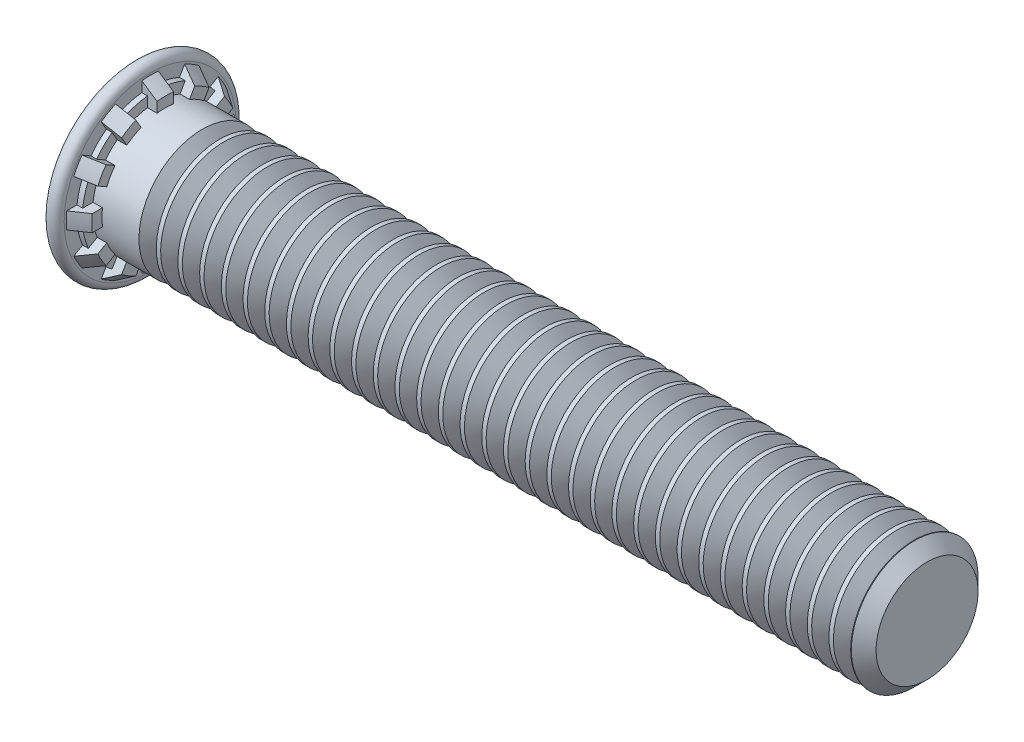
ISO-10303-21;
HEADER;
FILE_DESCRIPTION(('STEP AP214'),'2;1');
FILE_NAME('part.step','',(''),(''),'','','');
FILE_SCHEMA(('AUTOMOTIVE_DESIGN { 1 0 10303 214 1 1 1 1 }'));
ENDSEC;
DATA;
#1=APPLICATION_CONTEXT('core data for automotive mechanical design processes');
#2=APPLICATION_PROTOCOL_DEFINITION('international standard','automotive_design',2000,#1);
#3=PRODUCT_CONTEXT('',#1,'mechanical');
#4=PRODUCT('Part','Part','',(#3));
#5=PRODUCT_RELATED_PRODUCT_CATEGORY('part','',(#4));
#6=PRODUCT_DEFINITION_FORMATION('','',#4);
#7=PRODUCT_DEFINITION_CONTEXT('part definition',#1,'design');
#8=PRODUCT_DEFINITION('design','',#6,#7);
#9=PRODUCT_DEFINITION_SHAPE('','',#8);
#10=(LENGTH_UNIT() NAMED_UNIT(*) SI_UNIT(.MILLI.,.METRE.));
#11=(NAMED_UNIT(*) PLANE_ANGLE_UNIT() SI_UNIT($,.RADIAN.));
#12=(NAMED_UNIT(*) SI_UNIT($,.STERADIAN.) SOLID_ANGLE_UNIT());
#13=UNCERTAINTY_MEASURE_WITH_UNIT(LENGTH_MEASURE(1.E-05),#10,'distance_accuracy_value','');
#14=(GEOMETRIC_REPRESENTATION_CONTEXT(3) GLOBAL_UNCERTAINTY_ASSIGNED_CONTEXT((#13)) GLOBAL_UNIT_ASSIGNED_CONTEXT((#10,
#11,#12)) REPRESENTATION_CONTEXT('',''));
#15=CARTESIAN_POINT('',(0.,0.,0.));
#16=DIRECTION('',(0.,0.,1.));
#17=DIRECTION('',(1.,0.,0.));
#18=AXIS2_PLACEMENT_3D('',#15,#16,#17);
#19=CARTESIAN_POINT('',(0.48,0.,0.));
#20=DIRECTION('',(-1.,0.,0.));
#21=DIRECTION('',(0.,0.,1.));
#22=AXIS2_PLACEMENT_3D('',#19,#20,#21);
#23=CONICAL_SURFACE('',#22,2.645,0.591599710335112);
#24=CARTESIAN_POINT('',(0.48,0.,0.));
#25=DIRECTION('',(-1.,0.,0.));
#26=DIRECTION('',(0.,0.,1.));
#27=AXIS2_PLACEMENT_3D('',#24,#25,#26);
#28=CIRCLE('',#27,2.645);
#29=CARTESIAN_POINT('',(0.48,1.54212099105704,-2.14892713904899));
#30=VERTEX_POINT('',#29);
#31=CARTESIAN_POINT('',(0.48,1.08996499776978,-2.4099795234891));
#32=VERTEX_POINT('',#31);
#33=EDGE_CURVE('E1335',#30,#32,#28,.T.);
#34=ORIENTED_EDGE('',*,*,#33,.F.);
#35=CARTESIAN_POINT('',(0.9602,1.37990139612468,-1.86795455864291));
#36=CARTESIAN_POINT('',(0.86008074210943,1.41374760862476,-1.92657791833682));
#37=CARTESIAN_POINT('',(0.759947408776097,1.4475834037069,-1.98518323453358));
#38=CARTESIAN_POINT('',(0.599805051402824,1.50167242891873,-2.07886817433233));
#39=CARTESIAN_POINT('',(0.539805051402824,1.52193233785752,-2.11395936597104));
#40=CARTESIAN_POINT('',(0.4798,1.5421885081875,-2.14904408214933));
#41=B_SPLINE_CURVE_WITH_KNOTS('',3,(#35,#36,#37,#38,#39,#40),.UNSPECIFIED.,.F.,.F.,(4,2,4),(0.,
0.362567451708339,0.579769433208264),.UNSPECIFIED.);
#42=CARTESIAN_POINT('',(0.96,1.37996901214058,-1.86807167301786));
#43=VERTEX_POINT('',#42);
#44=EDGE_CURVE('E649',#43,#30,#41,.T.);
#45=ORIENTED_EDGE('',*,*,#44,.F.);
#46=CARTESIAN_POINT('',(0.96,0.,0.));
#47=DIRECTION('',(-1.,0.,0.));
#48=DIRECTION('',(0.,0.,1.));
#49=AXIS2_PLACEMENT_3D('',#46,#47,#48);
#50=CIRCLE('',#49,2.3225);
#51=CARTESIAN_POINT('',(0.96,0.927813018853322,-2.12912405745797));
#52=VERTEX_POINT('',#51);
#53=EDGE_CURVE('E1332',#43,#52,#50,.T.);
#54=ORIENTED_EDGE('',*,*,#53,.T.);
#55=CARTESIAN_POINT('',(0.4798,1.09003251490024,-2.41009646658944));
#56=CARTESIAN_POINT('',(0.539805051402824,1.06977634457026,-2.37501175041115));
#57=CARTESIAN_POINT('',(0.599805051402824,1.04951643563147,-2.33992055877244));
#58=CARTESIAN_POINT('',(0.759947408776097,0.995427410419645,-2.24623561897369));
#59=CARTESIAN_POINT('',(0.86008074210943,0.961591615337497,-2.18763030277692));
#60=CARTESIAN_POINT('',(0.9602,0.927745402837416,-2.12900694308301));
#61=B_SPLINE_CURVE_WITH_KNOTS('',3,(#55,#56,#57,#58,#59,#60),.UNSPECIFIED.,.F.,.F.,(4,2,4),(0.,
0.217201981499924,0.579769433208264),.UNSPECIFIED.);
#62=EDGE_CURVE('E689',#32,#52,#61,.T.);
#63=ORIENTED_EDGE('',*,*,#62,.F.);
#64=EDGE_LOOP('',(#34,#45,#54,#63));
#65=FACE_BOUND('',#64,.T.);
#66=ADVANCED_FACE('F26',(#65),#23,.T.);
#67=CARTESIAN_POINT('',(0.48,0.261052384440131,-2.63208598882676));
#68=VERTEX_POINT('',#67);
#69=CARTESIAN_POINT('',(0.48,-0.261052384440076,-2.63208598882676));
#70=VERTEX_POINT('',#69);
#71=EDGE_CURVE('E1569',#68,#70,#28,.T.);
#72=ORIENTED_EDGE('',*,*,#71,.F.);
#73=CARTESIAN_POINT('',(1.88986762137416,0.261052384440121,-1.67755488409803));
#74=CARTESIAN_POINT('',(1.6897049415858,0.261052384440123,-1.81362194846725));
#75=CARTESIAN_POINT('',(1.48939699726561,0.261052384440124,-1.94947480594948));
#76=CARTESIAN_POINT('',(1.08858398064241,0.261052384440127,-2.2208890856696));
#77=CARTESIAN_POINT('',(0.888078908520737,0.261052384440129,-2.35645050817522));
#78=CARTESIAN_POINT('',(0.486964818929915,0.261052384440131,-2.62741904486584));
#79=CARTESIAN_POINT('',(0.286355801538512,0.261052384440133,-2.76282615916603));
#80=CARTESIAN_POINT('',(-0.114934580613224,0.261052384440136,-3.03353352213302));
#81=CARTESIAN_POINT('',(-0.315615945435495,0.261052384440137,-3.16883377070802));
#82=CARTESIAN_POINT('',(-0.516317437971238,0.261052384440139,-3.30410414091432));
#83=B_SPLINE_CURVE_WITH_KNOTS('',3,(#73,#74,#75,#76,#77,#78,#79,#80,#81,#82),.UNSPECIFIED.,.F.,
.F.,(4,2,2,2,4),(0.,0.726094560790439,1.45218845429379,2.17828180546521,2.90437577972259),.UNSPECIFIED.);
#84=CARTESIAN_POINT('',(0.96,0.261052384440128,-2.30778203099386));
#85=VERTEX_POINT('',#84);
#86=EDGE_CURVE('E697',#85,#68,#83,.T.);
#87=ORIENTED_EDGE('',*,*,#86,.F.);
#88=CARTESIAN_POINT('',(0.96,-0.261052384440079,-2.30778203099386));
#89=VERTEX_POINT('',#88);
#90=EDGE_CURVE('E1398',#85,#89,#50,.T.);
#91=ORIENTED_EDGE('',*,*,#90,.T.);
#92=CARTESIAN_POINT('',(-0.516317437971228,-0.261052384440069,-3.30410414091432));
#93=CARTESIAN_POINT('',(-0.315615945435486,-0.261052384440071,-3.16883377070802));
#94=CARTESIAN_POINT('',(-0.114934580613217,-0.261052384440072,-3.03353352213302));
#95=CARTESIAN_POINT('',(0.286355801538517,-0.261052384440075,-2.76282615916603));
#96=CARTESIAN_POINT('',(0.486964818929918,-0.261052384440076,-2.62741904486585));
#97=CARTESIAN_POINT('',(0.888078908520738,-0.261052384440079,-2.35645050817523));
#98=CARTESIAN_POINT('',(1.08858398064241,-0.26105238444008,-2.22088908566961));
#99=CARTESIAN_POINT('',(1.4893969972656,-0.261052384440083,-1.94947480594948));
#100=CARTESIAN_POINT('',(1.6897049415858,-0.261052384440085,-1.81362194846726));
#101=CARTESIAN_POINT('',(1.88986762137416,-0.261052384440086,-1.67755488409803));
#102=B_SPLINE_CURVE_WITH_KNOTS('',3,(#92,#93,#94,#95,#96,#97,#98,#99,#100,#101),.UNSPECIFIED.,
.F.,.F.,(4,2,2,2,4),(0.,0.72609397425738,1.45218732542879,2.17828121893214,2.90437577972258),.UNSPECIFIED.);
#103=EDGE_CURVE('E725',#70,#89,#102,.T.);
#104=ORIENTED_EDGE('',*,*,#103,.F.);
#105=EDGE_LOOP('',(#72,#87,#91,#104));
#106=FACE_BOUND('',#105,.T.);
#107=ADVANCED_FACE('F1583',(#106),#23,.T.);
#108=CARTESIAN_POINT('',(0.48,-1.08996499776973,-2.40997952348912));
#109=VERTEX_POINT('',#108);
#110=CARTESIAN_POINT('',(0.48,-1.54212099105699,-2.14892713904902));
#111=VERTEX_POINT('',#110);
#112=EDGE_CURVE('E1566',#109,#111,#28,.T.);
#113=ORIENTED_EDGE('',*,*,#112,.F.);
#114=CARTESIAN_POINT('',(0.9602,-0.927745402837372,-2.12900694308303));
#115=CARTESIAN_POINT('',(0.86008074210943,-0.961591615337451,-2.18763030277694));
#116=CARTESIAN_POINT('',(0.759947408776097,-0.995427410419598,-2.24623561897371));
#117=CARTESIAN_POINT('',(0.599805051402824,-1.04951643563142,-2.33992055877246));
#118=CARTESIAN_POINT('',(0.539805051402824,-1.06977634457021,-2.37501175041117));
#119=CARTESIAN_POINT('',(0.4798,-1.09003251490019,-2.41009646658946));
#120=B_SPLINE_CURVE_WITH_KNOTS('',3,(#114,#115,#116,#117,#118,#119),.UNSPECIFIED.,.F.,.F.,(4,2,
4),(0.,0.362567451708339,0.579769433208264),.UNSPECIFIED.);
#121=CARTESIAN_POINT('',(0.96,-0.927813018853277,-2.12912405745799));
#122=VERTEX_POINT('',#121);
#123=EDGE_CURVE('E718',#122,#109,#120,.T.);
#124=ORIENTED_EDGE('',*,*,#123,.F.);
#125=CARTESIAN_POINT('',(0.96,-1.37996901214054,-1.86807167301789));
#126=VERTEX_POINT('',#125);
#127=EDGE_CURVE('E1598',#122,#126,#50,.T.);
#128=ORIENTED_EDGE('',*,*,#127,.T.);
#129=CARTESIAN_POINT('',(0.4798,-1.54218850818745,-2.14904408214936));
#130=CARTESIAN_POINT('',(0.539805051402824,-1.52193233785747,-2.11395936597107));
#131=CARTESIAN_POINT('',(0.599805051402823,-1.50167242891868,-2.07886817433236));
#132=CARTESIAN_POINT('',(0.759947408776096,-1.44758340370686,-1.98518323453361));
#133=CARTESIAN_POINT('',(0.86008074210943,-1.41374760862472,-1.92657791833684));
#134=CARTESIAN_POINT('',(0.9602,-1.37990139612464,-1.86795455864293));
#135=B_SPLINE_CURVE_WITH_KNOTS('',3,(#129,#130,#131,#132,#133,#134),.UNSPECIFIED.,.F.,.F.,(4,2,
4),(0.,0.217201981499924,0.579769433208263),.UNSPECIFIED.);
#136=EDGE_CURVE('E752',#111,#126,#135,.T.);
#137=ORIENTED_EDGE('',*,*,#136,.F.);
#138=EDGE_LOOP('',(#113,#124,#128,#137));
#139=FACE_BOUND('',#138,.T.);
#140=ADVANCED_FACE('F1597',(#139),#23,.T.);
#141=CARTESIAN_POINT('',(0.48,-2.14892713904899,-1.54212099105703));
#142=VERTEX_POINT('',#141);
#143=CARTESIAN_POINT('',(0.48,-2.4099795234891,-1.08996499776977));
#144=VERTEX_POINT('',#143);
#145=EDGE_CURVE('E1563',#142,#144,#28,.T.);
#146=ORIENTED_EDGE('',*,*,#145,.F.);
#147=CARTESIAN_POINT('',(0.9602,-1.86795455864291,-1.37990139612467));
#148=CARTESIAN_POINT('',(0.86008074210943,-1.92657791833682,-1.41374760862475));
#149=CARTESIAN_POINT('',(0.759947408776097,-1.98518323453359,-1.4475834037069));
#150=CARTESIAN_POINT('',(0.599805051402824,-2.07886817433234,-1.50167242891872));
#151=CARTESIAN_POINT('',(0.539805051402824,-2.11395936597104,-1.52193233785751));
#152=CARTESIAN_POINT('',(0.4798,-2.14904408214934,-1.54218850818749));
#153=B_SPLINE_CURVE_WITH_KNOTS('',3,(#147,#148,#149,#150,#151,#152),.UNSPECIFIED.,.F.,.F.,(4,2,
4),(0.,0.36256745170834,0.579769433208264),.UNSPECIFIED.);
#154=CARTESIAN_POINT('',(0.96,-1.86807167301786,-1.37996901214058));
#155=VERTEX_POINT('',#154);
#156=EDGE_CURVE('E760',#155,#142,#153,.T.);
#157=ORIENTED_EDGE('',*,*,#156,.F.);
#158=CARTESIAN_POINT('',(0.96,-2.12912405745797,-0.927813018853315));
#159=VERTEX_POINT('',#158);
#160=EDGE_CURVE('E1602',#155,#159,#50,.T.);
#161=ORIENTED_EDGE('',*,*,#160,.T.);
#162=CARTESIAN_POINT('',(0.4798,-2.41009646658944,-1.09003251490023));
#163=CARTESIAN_POINT('',(0.539805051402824,-2.37501175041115,-1.06977634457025));
#164=CARTESIAN_POINT('',(0.599805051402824,-2.33992055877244,-1.04951643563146));
#165=CARTESIAN_POINT('',(0.759947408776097,-2.2462356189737,-0.995427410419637));
#166=CARTESIAN_POINT('',(0.86008074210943,-2.18763030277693,-0.961591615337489));
#167=CARTESIAN_POINT('',(0.9602,-2.12900694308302,-0.927745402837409));
#168=B_SPLINE_CURVE_WITH_KNOTS('',3,(#162,#163,#164,#165,#166,#167),.UNSPECIFIED.,.F.,.F.,(4,2,
4),(0.,0.217201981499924,0.579769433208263),.UNSPECIFIED.);
#169=EDGE_CURVE('E788',#144,#159,#168,.T.);
#170=ORIENTED_EDGE('',*,*,#169,.F.);
#171=EDGE_LOOP('',(#146,#157,#161,#170));
#172=FACE_BOUND('',#171,.T.);
#173=ADVANCED_FACE('F1902',(#172),#23,.T.);
#174=CARTESIAN_POINT('',(0.48,-2.63208598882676,-0.261052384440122));
#175=VERTEX_POINT('',#174);
#176=CARTESIAN_POINT('',(0.48,-2.63208598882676,0.261052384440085));
#177=VERTEX_POINT('',#176);
#178=EDGE_CURVE('E1560',#175,#177,#28,.T.);
#179=ORIENTED_EDGE('',*,*,#178,.F.);
#180=CARTESIAN_POINT('',(1.88986762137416,-1.67755488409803,-0.261052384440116));
#181=CARTESIAN_POINT('',(1.6897049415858,-1.81362194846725,-0.261052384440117));
#182=CARTESIAN_POINT('',(1.4893969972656,-1.94947480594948,-0.261052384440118));
#183=CARTESIAN_POINT('',(1.08858398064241,-2.2208890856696,-0.261052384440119));
#184=CARTESIAN_POINT('',(0.888078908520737,-2.35645050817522,-0.26105238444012));
#185=CARTESIAN_POINT('',(0.486964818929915,-2.62741904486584,-0.261052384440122));
#186=CARTESIAN_POINT('',(0.286355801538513,-2.76282615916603,-0.261052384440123));
#187=CARTESIAN_POINT('',(-0.114934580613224,-3.03353352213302,-0.261052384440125));
#188=CARTESIAN_POINT('',(-0.315615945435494,-3.16883377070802,-0.261052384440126));
#189=CARTESIAN_POINT('',(-0.516317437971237,-3.30410414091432,-0.261052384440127));
#190=B_SPLINE_CURVE_WITH_KNOTS('',3,(#180,#181,#182,#183,#184,#185,#186,#187,#188,#189),
.UNSPECIFIED.,.F.,.F.,(4,2,2,2,4),(0.,0.726094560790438,1.45218845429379,2.17828180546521,
2.90437577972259),.UNSPECIFIED.);
#191=CARTESIAN_POINT('',(0.96,-2.30778203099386,-0.26105238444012));
#192=VERTEX_POINT('',#191);
#193=EDGE_CURVE('E781',#192,#175,#190,.T.);
#194=ORIENTED_EDGE('',*,*,#193,.F.);
#195=CARTESIAN_POINT('',(0.96,-2.30778203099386,0.261052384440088));
#196=VERTEX_POINT('',#195);
#197=EDGE_CURVE('E1603',#192,#196,#50,.T.);
#198=ORIENTED_EDGE('',*,*,#197,.T.);
#199=CARTESIAN_POINT('',(-0.516317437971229,-3.30410414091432,0.261052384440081));
#200=CARTESIAN_POINT('',(-0.315615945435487,-3.16883377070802,0.261052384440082));
#201=CARTESIAN_POINT('',(-0.114934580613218,-3.03353352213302,0.261052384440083));
#202=CARTESIAN_POINT('',(0.286355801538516,-2.76282615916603,0.261052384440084));
#203=CARTESIAN_POINT('',(0.486964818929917,-2.62741904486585,0.261052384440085));
#204=CARTESIAN_POINT('',(0.888078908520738,-2.35645050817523,0.261052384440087));
#205=CARTESIAN_POINT('',(1.08858398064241,-2.22088908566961,0.261052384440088));
#206=CARTESIAN_POINT('',(1.4893969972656,-1.94947480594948,0.26105238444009));
#207=CARTESIAN_POINT('',(1.6897049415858,-1.81362194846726,0.261052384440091));
#208=CARTESIAN_POINT('',(1.88986762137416,-1.67755488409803,0.261052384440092));
#209=B_SPLINE_CURVE_WITH_KNOTS('',3,(#199,#200,#201,#202,#203,#204,#205,#206,#207,#208),
.UNSPECIFIED.,.F.,.F.,(4,2,2,2,4),(0.,0.726093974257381,1.45218732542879,2.17828121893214,
2.90437577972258),.UNSPECIFIED.);
#210=EDGE_CURVE('E815',#177,#196,#209,.T.);
#211=ORIENTED_EDGE('',*,*,#210,.F.);
#212=EDGE_LOOP('',(#179,#194,#198,#211));
#213=FACE_BOUND('',#212,.T.);
#214=ADVANCED_FACE('F1904',(#213),#23,.T.);
#215=CARTESIAN_POINT('',(0.48,-2.40997952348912,1.08996499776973));
#216=VERTEX_POINT('',#215);
#217=CARTESIAN_POINT('',(0.48,-2.14892713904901,1.542120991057));
#218=VERTEX_POINT('',#217);
#219=EDGE_CURVE('E1557',#216,#218,#28,.T.);
#220=ORIENTED_EDGE('',*,*,#219,.F.);
#221=CARTESIAN_POINT('',(0.9602,-2.12900694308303,0.927745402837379));
#222=CARTESIAN_POINT('',(0.86008074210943,-2.18763030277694,0.961591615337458));
#223=CARTESIAN_POINT('',(0.759947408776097,-2.24623561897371,0.995427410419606));
#224=CARTESIAN_POINT('',(0.599805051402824,-2.33992055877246,1.04951643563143));
#225=CARTESIAN_POINT('',(0.539805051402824,-2.37501175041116,1.06977634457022));
#226=CARTESIAN_POINT('',(0.4798,-2.41009646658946,1.0900325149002));
#227=B_SPLINE_CURVE_WITH_KNOTS('',3,(#221,#222,#223,#224,#225,#226),.UNSPECIFIED.,.F.,.F.,(4,2,
4),(0.,0.36256745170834,0.579769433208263),.UNSPECIFIED.);
#228=CARTESIAN_POINT('',(0.96,-2.12912405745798,0.927813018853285));
#229=VERTEX_POINT('',#228);
#230=EDGE_CURVE('E823',#229,#216,#227,.T.);
#231=ORIENTED_EDGE('',*,*,#230,.F.);
#232=CARTESIAN_POINT('',(0.96,-1.86807167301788,1.37996901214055));
#233=VERTEX_POINT('',#232);
#234=EDGE_CURVE('E1608',#229,#233,#50,.T.);
#235=ORIENTED_EDGE('',*,*,#234,.T.);
#236=CARTESIAN_POINT('',(0.4798,-2.14904408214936,1.54218850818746));
#237=CARTESIAN_POINT('',(0.539805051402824,-2.11395936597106,1.52193233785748));
#238=CARTESIAN_POINT('',(0.599805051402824,-2.07886817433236,1.50167242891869));
#239=CARTESIAN_POINT('',(0.759947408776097,-1.98518323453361,1.44758340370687));
#240=CARTESIAN_POINT('',(0.86008074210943,-1.92657791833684,1.41374760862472));
#241=CARTESIAN_POINT('',(0.9602,-1.86795455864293,1.37990139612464));
#242=B_SPLINE_CURVE_WITH_KNOTS('',3,(#236,#237,#238,#239,#240,#241),.UNSPECIFIED.,.F.,.F.,(4,2,
4),(0.,0.217201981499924,0.579769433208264),.UNSPECIFIED.);
#243=EDGE_CURVE('E851',#218,#233,#242,.T.);
#244=ORIENTED_EDGE('',*,*,#243,.F.);
#245=EDGE_LOOP('',(#220,#231,#235,#244));
#246=FACE_BOUND('',#245,.T.);
#247=ADVANCED_FACE('F1909',(#246),#23,.T.);
#248=CARTESIAN_POINT('',(0.48,-1.54212099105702,2.148927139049));
#249=VERTEX_POINT('',#248);
#250=CARTESIAN_POINT('',(0.48,-1.08996499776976,2.4099795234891));
#251=VERTEX_POINT('',#250);
#252=EDGE_CURVE('E1554',#249,#251,#28,.T.);
#253=ORIENTED_EDGE('',*,*,#252,.F.);
#254=CARTESIAN_POINT('',(0.9602,-1.37990139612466,1.86795455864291));
#255=CARTESIAN_POINT('',(0.86008074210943,-1.41374760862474,1.92657791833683));
#256=CARTESIAN_POINT('',(0.759947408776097,-1.44758340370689,1.98518323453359));
#257=CARTESIAN_POINT('',(0.599805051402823,-1.50167242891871,2.07886817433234));
#258=CARTESIAN_POINT('',(0.539805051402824,-1.5219323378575,2.11395936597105));
#259=CARTESIAN_POINT('',(0.4798,-1.54218850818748,2.14904408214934));
#260=B_SPLINE_CURVE_WITH_KNOTS('',3,(#254,#255,#256,#257,#258,#259),.UNSPECIFIED.,.F.,.F.,(4,2,
4),(0.,0.36256745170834,0.579769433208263),.UNSPECIFIED.);
#261=CARTESIAN_POINT('',(0.96,-1.37996901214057,1.86807167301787));
#262=VERTEX_POINT('',#261);
#263=EDGE_CURVE('E844',#262,#249,#260,.T.);
#264=ORIENTED_EDGE('',*,*,#263,.F.);
#265=CARTESIAN_POINT('',(0.96,-0.927813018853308,2.12912405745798));
#266=VERTEX_POINT('',#265);
#267=EDGE_CURVE('E1612',#262,#266,#50,.T.);
#268=ORIENTED_EDGE('',*,*,#267,.T.);
#269=CARTESIAN_POINT('',(0.4798,-1.09003251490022,2.41009646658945));
#270=CARTESIAN_POINT('',(0.539805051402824,-1.06977634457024,2.37501175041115));
#271=CARTESIAN_POINT('',(0.599805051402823,-1.04951643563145,2.33992055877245));
#272=CARTESIAN_POINT('',(0.759947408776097,-0.995427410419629,2.2462356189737));
#273=CARTESIAN_POINT('',(0.86008074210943,-0.961591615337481,2.18763030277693));
#274=CARTESIAN_POINT('',(0.9602,-0.927745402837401,2.12900694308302));
#275=B_SPLINE_CURVE_WITH_KNOTS('',3,(#269,#270,#271,#272,#273,#274),.UNSPECIFIED.,.F.,.F.,(4,2,
4),(0.,0.217201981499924,0.579769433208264),.UNSPECIFIED.);
#276=EDGE_CURVE('E878',#251,#266,#275,.T.);
#277=ORIENTED_EDGE('',*,*,#276,.F.);
#278=EDGE_LOOP('',(#253,#264,#268,#277));
#279=FACE_BOUND('',#278,.T.);
#280=ADVANCED_FACE('F1669',(#279),#23,.T.);
#281=CARTESIAN_POINT('',(0.48,-0.261052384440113,2.63208598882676));
#282=VERTEX_POINT('',#281);
#283=CARTESIAN_POINT('',(0.48,0.261052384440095,2.63208598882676));
#284=VERTEX_POINT('',#283);
#285=EDGE_CURVE('E1551',#282,#284,#28,.T.);
#286=ORIENTED_EDGE('',*,*,#285,.F.);
#287=CARTESIAN_POINT('',(2.14583636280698,-0.261052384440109,1.50326781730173));
#288=CARTESIAN_POINT('',(1.94584712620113,-0.26105238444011,1.63959035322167));
#289=CARTESIAN_POINT('',(1.74566363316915,-0.26105238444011,1.77562696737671));
#290=CARTESIAN_POINT('',(1.34503894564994,-0.261052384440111,2.04731968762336));
#291=CARTESIAN_POINT('',(1.14459775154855,-0.261052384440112,2.1829757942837));
#292=CARTESIAN_POINT('',(0.743588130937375,-0.261052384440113,2.45409906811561));
#293=CARTESIAN_POINT('',(0.543019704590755,-0.261052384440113,2.58956623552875));
#294=CARTESIAN_POINT('',(0.141795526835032,-0.261052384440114,2.86037179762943));
#295=CARTESIAN_POINT('',(-0.0588602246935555,-0.261052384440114,2.99571019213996));
#296=CARTESIAN_POINT('',(-0.259539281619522,-0.261052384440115,3.13101401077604));
#297=B_SPLINE_CURVE_WITH_KNOTS('',3,(#287,#288,#289,#290,#291,#292,#293,#294,#295,#296),
.UNSPECIFIED.,.F.,.F.,(4,2,2,2,4),(0.,0.726095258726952,1.45218943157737,2.17828267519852,
2.90437691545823),.UNSPECIFIED.);
#298=CARTESIAN_POINT('',(0.96,-0.261052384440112,2.30778203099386));
#299=VERTEX_POINT('',#298);
#300=EDGE_CURVE('E886',#299,#282,#297,.T.);
#301=ORIENTED_EDGE('',*,*,#300,.F.);
#302=CARTESIAN_POINT('',(0.96,0.261052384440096,2.30778203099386));
#303=VERTEX_POINT('',#302);
#304=EDGE_CURVE('E1513',#299,#303,#50,.T.);
#305=ORIENTED_EDGE('',*,*,#304,.T.);
#306=CARTESIAN_POINT('',(-0.259539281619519,0.261052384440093,3.13101401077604));
#307=CARTESIAN_POINT('',(-0.058860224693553,0.261052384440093,2.99571019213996));
#308=CARTESIAN_POINT('',(0.141795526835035,0.261052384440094,2.86037179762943));
#309=CARTESIAN_POINT('',(0.543019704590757,0.261052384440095,2.58956623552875));
#310=CARTESIAN_POINT('',(0.743588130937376,0.261052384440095,2.45409906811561));
#311=CARTESIAN_POINT('',(1.14459775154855,0.261052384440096,2.18297579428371));
#312=CARTESIAN_POINT('',(1.34503894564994,0.261052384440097,2.04731968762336));
#313=CARTESIAN_POINT('',(1.74566363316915,0.261052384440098,1.77562696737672));
#314=CARTESIAN_POINT('',(1.94584712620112,0.261052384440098,1.63959035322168));
#315=CARTESIAN_POINT('',(2.14583636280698,0.261052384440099,1.50326781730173));
#316=B_SPLINE_CURVE_WITH_KNOTS('',3,(#306,#307,#308,#309,#310,#311,#312,#313,#314,#315),
.UNSPECIFIED.,.F.,.F.,(4,2,2,2,4),(0.,0.726094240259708,1.45218748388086,2.17828165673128,
2.90437691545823),.UNSPECIFIED.);
#317=EDGE_CURVE('E914',#284,#303,#316,.T.);
#318=ORIENTED_EDGE('',*,*,#317,.F.);
#319=EDGE_LOOP('',(#286,#301,#305,#318));
#320=FACE_BOUND('',#319,.T.);
#321=ADVANCED_FACE('F1624',(#320),#23,.T.);
#322=CARTESIAN_POINT('',(0.48,1.08996499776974,2.40997952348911));
#323=VERTEX_POINT('',#322);
#324=CARTESIAN_POINT('',(0.48,1.54212099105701,2.14892713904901));
#325=VERTEX_POINT('',#324);
#326=EDGE_CURVE('E1550',#323,#325,#28,.T.);
#327=ORIENTED_EDGE('',*,*,#326,.F.);
#328=CARTESIAN_POINT('',(0.9602,0.927745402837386,2.12900694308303));
#329=CARTESIAN_POINT('',(0.86008074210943,0.961591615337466,2.18763030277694));
#330=CARTESIAN_POINT('',(0.759947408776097,0.995427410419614,2.24623561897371));
#331=CARTESIAN_POINT('',(0.599805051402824,1.04951643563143,2.33992055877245));
#332=CARTESIAN_POINT('',(0.539805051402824,1.06977634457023,2.37501175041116));
#333=CARTESIAN_POINT('',(0.4798,1.09003251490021,2.41009646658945));
#334=B_SPLINE_CURVE_WITH_KNOTS('',3,(#328,#329,#330,#331,#332,#333),.UNSPECIFIED.,.F.,.F.,(4,2,
4),(0.,0.362567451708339,0.579769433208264),.UNSPECIFIED.);
#335=CARTESIAN_POINT('',(0.96,0.927813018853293,2.12912405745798));
#336=VERTEX_POINT('',#335);
#337=EDGE_CURVE('E907',#336,#323,#334,.T.);
#338=ORIENTED_EDGE('',*,*,#337,.F.);
#339=CARTESIAN_POINT('',(0.96,1.37996901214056,1.86807167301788));
#340=VERTEX_POINT('',#339);
#341=EDGE_CURVE('E1512',#336,#340,#50,.T.);
#342=ORIENTED_EDGE('',*,*,#341,.T.);
#343=CARTESIAN_POINT('',(0.4798,1.54218850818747,2.14904408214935));
#344=CARTESIAN_POINT('',(0.539805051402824,1.52193233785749,2.11395936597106));
#345=CARTESIAN_POINT('',(0.599805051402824,1.5016724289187,2.07886817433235));
#346=CARTESIAN_POINT('',(0.759947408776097,1.44758340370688,1.9851832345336));
#347=CARTESIAN_POINT('',(0.86008074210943,1.41374760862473,1.92657791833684));
#348=CARTESIAN_POINT('',(0.9602,1.37990139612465,1.86795455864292));
#349=B_SPLINE_CURVE_WITH_KNOTS('',3,(#343,#344,#345,#346,#347,#348),.UNSPECIFIED.,.F.,.F.,(4,2,
4),(0.,0.217201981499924,0.579769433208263),.UNSPECIFIED.);
#350=EDGE_CURVE('E941',#325,#340,#349,.T.);
#351=ORIENTED_EDGE('',*,*,#350,.F.);
#352=EDGE_LOOP('',(#327,#338,#342,#351));
#353=FACE_BOUND('',#352,.T.);
#354=ADVANCED_FACE('F1661',(#353),#23,.T.);
#355=CARTESIAN_POINT('',(0.48,2.148927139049,1.54212099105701));
#356=VERTEX_POINT('',#355);
#357=CARTESIAN_POINT('',(0.48,2.40997952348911,1.08996499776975));
#358=VERTEX_POINT('',#357);
#359=EDGE_CURVE('E1547',#356,#358,#28,.T.);
#360=ORIENTED_EDGE('',*,*,#359,.F.);
#361=CARTESIAN_POINT('',(0.9602,1.86795455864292,1.37990139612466));
#362=CARTESIAN_POINT('',(0.86008074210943,1.92657791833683,1.41374760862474));
#363=CARTESIAN_POINT('',(0.759947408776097,1.9851832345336,1.44758340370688));
#364=CARTESIAN_POINT('',(0.599805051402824,2.07886817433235,1.5016724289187));
#365=CARTESIAN_POINT('',(0.539805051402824,2.11395936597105,1.5219323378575));
#366=CARTESIAN_POINT('',(0.4798,2.14904408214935,1.54218850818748));
#367=B_SPLINE_CURVE_WITH_KNOTS('',3,(#361,#362,#363,#364,#365,#366),.UNSPECIFIED.,.F.,.F.,(4,2,
4),(0.,0.36256745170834,0.579769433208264),.UNSPECIFIED.);
#368=CARTESIAN_POINT('',(0.96,1.86807167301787,1.37996901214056));
#369=VERTEX_POINT('',#368);
#370=EDGE_CURVE('E949',#369,#356,#367,.T.);
#371=ORIENTED_EDGE('',*,*,#370,.F.);
#372=CARTESIAN_POINT('',(0.96,2.12912405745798,0.9278130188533));
#373=VERTEX_POINT('',#372);
#374=EDGE_CURVE('E1509',#369,#373,#50,.T.);
#375=ORIENTED_EDGE('',*,*,#374,.T.);
#376=CARTESIAN_POINT('',(0.4798,2.41009646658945,1.09003251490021));
#377=CARTESIAN_POINT('',(0.539805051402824,2.37501175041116,1.06977634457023));
#378=CARTESIAN_POINT('',(0.599805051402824,2.33992055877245,1.04951643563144));
#379=CARTESIAN_POINT('',(0.759947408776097,2.2462356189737,0.995427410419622));
#380=CARTESIAN_POINT('',(0.86008074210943,2.18763030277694,0.961591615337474));
#381=CARTESIAN_POINT('',(0.9602,2.12900694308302,0.927745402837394));
#382=B_SPLINE_CURVE_WITH_KNOTS('',3,(#376,#377,#378,#379,#380,#381),.UNSPECIFIED.,.F.,.F.,(4,2,
4),(0.,0.217201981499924,0.579769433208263),.UNSPECIFIED.);
#383=EDGE_CURVE('E977',#358,#373,#382,.T.);
#384=ORIENTED_EDGE('',*,*,#383,.F.);
#385=EDGE_LOOP('',(#360,#371,#375,#384));
#386=FACE_BOUND('',#385,.T.);
#387=ADVANCED_FACE('F1549',(#386),#23,.T.);
#388=CARTESIAN_POINT('',(0.48,2.63208598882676,0.261052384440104));
#389=VERTEX_POINT('',#388);
#390=CARTESIAN_POINT('',(0.48,2.63208598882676,-0.261052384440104));
#391=VERTEX_POINT('',#390);
#392=EDGE_CURVE('E1331',#389,#391,#28,.T.);
#393=ORIENTED_EDGE('',*,*,#392,.F.);
#394=CARTESIAN_POINT('',(2.14583636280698,1.50326781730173,0.261052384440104));
#395=CARTESIAN_POINT('',(1.94584712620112,1.63959035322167,0.261052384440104));
#396=CARTESIAN_POINT('',(1.74566363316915,1.77562696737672,0.261052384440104));
#397=CARTESIAN_POINT('',(1.34503894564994,2.04731968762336,0.261052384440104));
#398=CARTESIAN_POINT('',(1.14459775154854,2.1829757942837,0.261052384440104));
#399=CARTESIAN_POINT('',(0.743588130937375,2.45409906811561,0.261052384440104));
#400=CARTESIAN_POINT('',(0.543019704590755,2.58956623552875,0.261052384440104));
#401=CARTESIAN_POINT('',(0.141795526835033,2.86037179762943,0.261052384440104));
#402=CARTESIAN_POINT('',(-0.0588602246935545,2.99571019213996,0.261052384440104));
#403=CARTESIAN_POINT('',(-0.259539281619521,3.13101401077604,0.261052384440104));
#404=B_SPLINE_CURVE_WITH_KNOTS('',3,(#394,#395,#396,#397,#398,#399,#400,#401,#402,#403),
.UNSPECIFIED.,.F.,.F.,(4,2,2,2,4),(0.,0.726095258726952,1.45218943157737,2.17828267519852,
2.90437691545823),.UNSPECIFIED.);
#405=CARTESIAN_POINT('',(0.96,2.30778203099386,0.261052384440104));
#406=VERTEX_POINT('',#405);
#407=EDGE_CURVE('E970',#406,#389,#404,.T.);
#408=ORIENTED_EDGE('',*,*,#407,.F.);
#409=CARTESIAN_POINT('',(0.96,2.30778203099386,-0.261052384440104));
#410=VERTEX_POINT('',#409);
#411=EDGE_CURVE('E1327',#406,#410,#50,.T.);
#412=ORIENTED_EDGE('',*,*,#411,.T.);
#413=CARTESIAN_POINT('',(-0.259539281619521,3.13101401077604,-0.261052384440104));
#414=CARTESIAN_POINT('',(-0.0588602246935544,2.99571019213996,-0.261052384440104));
#415=CARTESIAN_POINT('',(0.141795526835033,2.86037179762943,-0.261052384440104));
#416=CARTESIAN_POINT('',(0.543019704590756,2.58956623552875,-0.261052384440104));
#417=CARTESIAN_POINT('',(0.743588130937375,2.45409906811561,-0.261052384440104));
#418=CARTESIAN_POINT('',(1.14459775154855,2.1829757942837,-0.261052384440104));
#419=CARTESIAN_POINT('',(1.34503894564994,2.04731968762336,-0.261052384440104));
#420=CARTESIAN_POINT('',(1.74566363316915,1.77562696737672,-0.261052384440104));
#421=CARTESIAN_POINT('',(1.94584712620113,1.63959035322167,-0.261052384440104));
#422=CARTESIAN_POINT('',(2.14583636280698,1.50326781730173,-0.261052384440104));
#423=B_SPLINE_CURVE_WITH_KNOTS('',3,(#413,#414,#415,#416,#417,#418,#419,#420,#421,#422),
.UNSPECIFIED.,.F.,.F.,(4,2,2,2,4),(0.,0.726094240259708,1.45218748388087,2.17828165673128,
2.90437691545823),.UNSPECIFIED.);
#424=EDGE_CURVE('E1008',#391,#410,#423,.T.);
#425=ORIENTED_EDGE('',*,*,#424,.F.);
#426=EDGE_LOOP('',(#393,#408,#412,#425));
#427=FACE_BOUND('',#426,.T.);
#428=ADVANCED_FACE('F1517',(#427),#23,.T.);
#429=CARTESIAN_POINT('',(0.96,2.3225,0.));
#430=DIRECTION('',(1.,0.,0.));
#431=DIRECTION('',(0.,0.,-1.));
#432=AXIS2_PLACEMENT_3D('',#429,#430,#431);
#433=PLANE('',#432);
#434=DIRECTION('',(0.,-0.866025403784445,0.499999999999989));
#435=VECTOR('',#434,1.);
#436=CARTESIAN_POINT('',(0.96,1.58670668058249,-1.21752285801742));
#437=LINE('',#436,#435);
#438=CARTESIAN_POINT('',(0.96,1.86807167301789,-1.37996901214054));
#439=VERTEX_POINT('',#438);
#440=CARTESIAN_POINT('',(0.96,1.58670668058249,-1.21752285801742));
#441=VERTEX_POINT('',#440);
#442=EDGE_CURVE('E638',#439,#441,#437,.T.);
#443=ORIENTED_EDGE('',*,*,#442,.F.);
#444=CARTESIAN_POINT('',(0.96,2.12912405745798,-0.9278130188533));
#445=VERTEX_POINT('',#444);
#446=EDGE_CURVE('E1328',#445,#439,#50,.T.);
#447=ORIENTED_EDGE('',*,*,#446,.F.);
#448=DIRECTION('',(0.,0.866025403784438,-0.500000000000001));
#449=VECTOR('',#448,1.);
#450=CARTESIAN_POINT('',(0.96,1.84775906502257,-0.765366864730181));
#451=LINE('',#450,#449);
#452=CARTESIAN_POINT('',(0.96,1.84775906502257,-0.765366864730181));
#453=VERTEX_POINT('',#452);
#454=EDGE_CURVE('E1465',#453,#445,#451,.T.);
#455=ORIENTED_EDGE('',*,*,#454,.F.);
#456=CARTESIAN_POINT('',(0.96,0.,0.));
#457=DIRECTION('',(-1.,0.,0.));
#458=DIRECTION('',(0.,0.,1.));
#459=AXIS2_PLACEMENT_3D('',#456,#457,#458);
#460=CIRCLE('',#459,2.);
#461=EDGE_CURVE('E1324',#453,#441,#460,.T.);
#462=ORIENTED_EDGE('',*,*,#461,.T.);
#463=EDGE_LOOP('',(#443,#447,#455,#462));
#464=FACE_BOUND('',#463,.T.);
#465=ADVANCED_FACE('F1484',(#464),#433,.T.);
#466=DIRECTION('',(0.,0.50000000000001,-0.866025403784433));
#467=VECTOR('',#466,1.);
#468=CARTESIAN_POINT('',(0.96,1.21752285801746,-1.58670668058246));
#469=LINE('',#468,#467);
#470=CARTESIAN_POINT('',(0.96,1.21752285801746,-1.58670668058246));
#471=VERTEX_POINT('',#470);
#472=EDGE_CURVE('E635',#471,#43,#469,.T.);
#473=ORIENTED_EDGE('',*,*,#472,.F.);
#474=CARTESIAN_POINT('',(0.96,0.765366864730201,-1.84775906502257));
#475=VERTEX_POINT('',#474);
#476=EDGE_CURVE('E49',#471,#475,#460,.T.);
#477=ORIENTED_EDGE('',*,*,#476,.T.);
#478=DIRECTION('',(0.,-0.50000000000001,0.866025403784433));
#479=VECTOR('',#478,1.);
#480=CARTESIAN_POINT('',(0.96,0.765366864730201,-1.84775906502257));
#481=LINE('',#480,#479);
#482=EDGE_CURVE('E1384',#52,#475,#481,.T.);
#483=ORIENTED_EDGE('',*,*,#482,.F.);
#484=ORIENTED_EDGE('',*,*,#53,.F.);
#485=EDGE_LOOP('',(#473,#477,#483,#484));
#486=FACE_BOUND('',#485,.T.);
#487=ADVANCED_FACE('F1660',(#486),#433,.T.);
#488=DIRECTION('',(0.,0.,-1.));
#489=VECTOR('',#488,1.);
#490=CARTESIAN_POINT('',(0.96,0.261052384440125,-1.98288972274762));
#491=LINE('',#490,#489);
#492=CARTESIAN_POINT('',(0.96,0.261052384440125,-1.98288972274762));
#493=VERTEX_POINT('',#492);
#494=EDGE_CURVE('E1390',#493,#85,#491,.T.);
#495=ORIENTED_EDGE('',*,*,#494,.F.);
#496=CARTESIAN_POINT('',(0.96,-0.261052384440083,-1.98288972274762));
#497=VERTEX_POINT('',#496);
#498=EDGE_CURVE('E1397',#493,#497,#460,.T.);
#499=ORIENTED_EDGE('',*,*,#498,.T.);
#500=DIRECTION('',(0.,0.,1.));
#501=VECTOR('',#500,1.);
#502=CARTESIAN_POINT('',(0.96,-0.261052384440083,-1.98288972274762));
#503=LINE('',#502,#501);
#504=EDGE_CURVE('E703',#89,#497,#503,.T.);
#505=ORIENTED_EDGE('',*,*,#504,.F.);
#506=ORIENTED_EDGE('',*,*,#90,.F.);
#507=EDGE_LOOP('',(#495,#499,#505,#506));
#508=FACE_BOUND('',#507,.T.);
#509=ADVANCED_FACE('F1395',(#508),#433,.T.);
#510=DIRECTION('',(0.,-0.499999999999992,-0.866025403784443));
#511=VECTOR('',#510,1.);
#512=CARTESIAN_POINT('',(0.96,-0.765366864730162,-1.84775906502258));
#513=LINE('',#512,#511);
#514=CARTESIAN_POINT('',(0.96,-0.765366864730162,-1.84775906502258));
#515=VERTEX_POINT('',#514);
#516=EDGE_CURVE('E696',#515,#122,#513,.T.);
#517=ORIENTED_EDGE('',*,*,#516,.F.);
#518=CARTESIAN_POINT('',(0.96,-1.21752285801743,-1.58670668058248));
#519=VERTEX_POINT('',#518);
#520=EDGE_CURVE('E1402',#515,#519,#460,.T.);
#521=ORIENTED_EDGE('',*,*,#520,.T.);
#522=DIRECTION('',(0.,0.499999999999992,0.866025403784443));
#523=VECTOR('',#522,1.);
#524=CARTESIAN_POINT('',(0.96,-1.21752285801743,-1.58670668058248));
#525=LINE('',#524,#523);
#526=EDGE_CURVE('E1601',#126,#519,#525,.T.);
#527=ORIENTED_EDGE('',*,*,#526,.F.);
#528=ORIENTED_EDGE('',*,*,#127,.F.);
#529=EDGE_LOOP('',(#517,#521,#527,#528));
#530=FACE_BOUND('',#529,.T.);
#531=ADVANCED_FACE('F1599',(#530),#433,.T.);
#532=DIRECTION('',(0.,-0.866025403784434,-0.500000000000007));
#533=VECTOR('',#532,1.);
#534=CARTESIAN_POINT('',(0.96,-1.58670668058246,-1.21752285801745));
#535=LINE('',#534,#533);
#536=CARTESIAN_POINT('',(0.96,-1.58670668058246,-1.21752285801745));
#537=VERTEX_POINT('',#536);
#538=EDGE_CURVE('E1587',#537,#155,#535,.T.);
#539=ORIENTED_EDGE('',*,*,#538,.F.);
#540=CARTESIAN_POINT('',(0.96,-1.84775906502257,-0.765366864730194));
#541=VERTEX_POINT('',#540);
#542=EDGE_CURVE('E1403',#537,#541,#460,.T.);
#543=ORIENTED_EDGE('',*,*,#542,.T.);
#544=DIRECTION('',(0.,0.866025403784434,0.500000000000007));
#545=VECTOR('',#544,1.);
#546=CARTESIAN_POINT('',(0.96,-1.84775906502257,-0.765366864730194));
#547=LINE('',#546,#545);
#548=EDGE_CURVE('E766',#159,#541,#547,.T.);
#549=ORIENTED_EDGE('',*,*,#548,.F.);
#550=ORIENTED_EDGE('',*,*,#160,.F.);
#551=EDGE_LOOP('',(#539,#543,#549,#550));
#552=FACE_BOUND('',#551,.T.);
#553=ADVANCED_FACE('F1700',(#552),#433,.T.);
#554=DIRECTION('',(0.,-1.,0.));
#555=VECTOR('',#554,1.);
#556=CARTESIAN_POINT('',(0.96,-1.98288972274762,-0.261052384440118));
#557=LINE('',#556,#555);
#558=CARTESIAN_POINT('',(0.96,-1.98288972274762,-0.261052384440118));
#559=VERTEX_POINT('',#558);
#560=EDGE_CURVE('E759',#559,#192,#557,.T.);
#561=ORIENTED_EDGE('',*,*,#560,.F.);
#562=CARTESIAN_POINT('',(0.96,-1.98288972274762,0.26105238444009));
#563=VERTEX_POINT('',#562);
#564=EDGE_CURVE('E1409',#559,#563,#460,.T.);
#565=ORIENTED_EDGE('',*,*,#564,.T.);
#566=DIRECTION('',(0.,1.,0.));
#567=VECTOR('',#566,1.);
#568=CARTESIAN_POINT('',(0.96,-1.98288972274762,0.26105238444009));
#569=LINE('',#568,#567);
#570=EDGE_CURVE('E1719',#196,#563,#569,.T.);
#571=ORIENTED_EDGE('',*,*,#570,.F.);
#572=ORIENTED_EDGE('',*,*,#197,.F.);
#573=EDGE_LOOP('',(#561,#565,#571,#572));
#574=FACE_BOUND('',#573,.T.);
#575=ADVANCED_FACE('F1704',(#574),#433,.T.);
#576=DIRECTION('',(0.,-0.866025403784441,0.499999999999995));
#577=VECTOR('',#576,1.);
#578=CARTESIAN_POINT('',(0.96,-1.84775906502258,0.765366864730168));
#579=LINE('',#578,#577);
#580=CARTESIAN_POINT('',(0.96,-1.84775906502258,0.765366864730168));
#581=VERTEX_POINT('',#580);
#582=EDGE_CURVE('E1718',#581,#229,#579,.T.);
#583=ORIENTED_EDGE('',*,*,#582,.F.);
#584=CARTESIAN_POINT('',(0.96,-1.58670668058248,1.21752285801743));
#585=VERTEX_POINT('',#584);
#586=EDGE_CURVE('E1414',#581,#585,#460,.T.);
#587=ORIENTED_EDGE('',*,*,#586,.T.);
#588=DIRECTION('',(0.,0.866025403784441,-0.499999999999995));
#589=VECTOR('',#588,1.);
#590=CARTESIAN_POINT('',(0.96,-1.58670668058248,1.21752285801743));
#591=LINE('',#590,#589);
#592=EDGE_CURVE('E829',#233,#585,#591,.T.);
#593=ORIENTED_EDGE('',*,*,#592,.F.);
#594=ORIENTED_EDGE('',*,*,#234,.F.);
#595=EDGE_LOOP('',(#583,#587,#593,#594));
#596=FACE_BOUND('',#595,.T.);
#597=ADVANCED_FACE('F1639',(#596),#433,.T.);
#598=DIRECTION('',(0.,-0.500000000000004,0.866025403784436));
#599=VECTOR('',#598,1.);
#600=CARTESIAN_POINT('',(0.96,-1.21752285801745,1.58670668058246));
#601=LINE('',#600,#599);
#602=CARTESIAN_POINT('',(0.96,-1.21752285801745,1.58670668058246));
#603=VERTEX_POINT('',#602);
#604=EDGE_CURVE('E822',#603,#262,#601,.T.);
#605=ORIENTED_EDGE('',*,*,#604,.F.);
#606=CARTESIAN_POINT('',(0.96,-0.765366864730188,1.84775906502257));
#607=VERTEX_POINT('',#606);
#608=EDGE_CURVE('E1420',#603,#607,#460,.T.);
#609=ORIENTED_EDGE('',*,*,#608,.T.);
#610=DIRECTION('',(0.,0.500000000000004,-0.866025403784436));
#611=VECTOR('',#610,1.);
#612=CARTESIAN_POINT('',(0.96,-0.765366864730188,1.84775906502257));
#613=LINE('',#612,#611);
#614=EDGE_CURVE('E1742',#266,#607,#613,.T.);
#615=ORIENTED_EDGE('',*,*,#614,.F.);
#616=ORIENTED_EDGE('',*,*,#267,.F.);
#617=EDGE_LOOP('',(#605,#609,#615,#616));
#618=FACE_BOUND('',#617,.T.);
#619=ADVANCED_FACE('F1634',(#618),#433,.T.);
#620=DIRECTION('',(0.,0.,1.));
#621=VECTOR('',#620,1.);
#622=CARTESIAN_POINT('',(0.96,-0.261052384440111,1.98288972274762));
#623=LINE('',#622,#621);
#624=CARTESIAN_POINT('',(0.96,-0.261052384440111,1.98288972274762));
#625=VERTEX_POINT('',#624);
#626=EDGE_CURVE('E1631',#625,#299,#623,.T.);
#627=ORIENTED_EDGE('',*,*,#626,.F.);
#628=CARTESIAN_POINT('',(0.96,0.261052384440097,1.98288972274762));
#629=VERTEX_POINT('',#628);
#630=EDGE_CURVE('E1425',#625,#629,#460,.T.);
#631=ORIENTED_EDGE('',*,*,#630,.T.);
#632=DIRECTION('',(0.,0.,-1.));
#633=VECTOR('',#632,1.);
#634=CARTESIAN_POINT('',(0.96,0.261052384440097,1.98288972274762));
#635=LINE('',#634,#633);
#636=EDGE_CURVE('E892',#303,#629,#635,.T.);
#637=ORIENTED_EDGE('',*,*,#636,.F.);
#638=ORIENTED_EDGE('',*,*,#304,.F.);
#639=EDGE_LOOP('',(#627,#631,#637,#638));
#640=FACE_BOUND('',#639,.T.);
#641=ADVANCED_FACE('F1630',(#640),#433,.T.);
#642=DIRECTION('',(0.,0.499999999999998,0.86602540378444));
#643=VECTOR('',#642,1.);
#644=CARTESIAN_POINT('',(0.96,0.765366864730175,1.84775906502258));
#645=LINE('',#644,#643);
#646=CARTESIAN_POINT('',(0.96,0.765366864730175,1.84775906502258));
#647=VERTEX_POINT('',#646);
#648=EDGE_CURVE('E885',#647,#336,#645,.T.);
#649=ORIENTED_EDGE('',*,*,#648,.F.);
#650=CARTESIAN_POINT('',(0.96,1.21752285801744,1.58670668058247));
#651=VERTEX_POINT('',#650);
#652=EDGE_CURVE('E1431',#647,#651,#460,.T.);
#653=ORIENTED_EDGE('',*,*,#652,.T.);
#654=DIRECTION('',(0.,-0.499999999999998,-0.86602540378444));
#655=VECTOR('',#654,1.);
#656=CARTESIAN_POINT('',(0.96,1.21752285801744,1.58670668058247));
#657=LINE('',#656,#655);
#658=EDGE_CURVE('E1541',#340,#651,#657,.T.);
#659=ORIENTED_EDGE('',*,*,#658,.F.);
#660=ORIENTED_EDGE('',*,*,#341,.F.);
#661=EDGE_LOOP('',(#649,#653,#659,#660));
#662=FACE_BOUND('',#661,.T.);
#663=ADVANCED_FACE('F1633',(#662),#433,.T.);
#664=DIRECTION('',(0.,0.866025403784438,0.500000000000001));
#665=VECTOR('',#664,1.);
#666=CARTESIAN_POINT('',(0.96,1.58670668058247,1.21752285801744));
#667=LINE('',#666,#665);
#668=CARTESIAN_POINT('',(0.96,1.58670668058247,1.21752285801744));
#669=VERTEX_POINT('',#668);
#670=EDGE_CURVE('E1510',#669,#369,#667,.T.);
#671=ORIENTED_EDGE('',*,*,#670,.F.);
#672=CARTESIAN_POINT('',(0.96,1.84775906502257,0.765366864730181));
#673=VERTEX_POINT('',#672);
#674=EDGE_CURVE('E1436',#669,#673,#460,.T.);
#675=ORIENTED_EDGE('',*,*,#674,.T.);
#676=DIRECTION('',(0.,-0.866025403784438,-0.500000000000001));
#677=VECTOR('',#676,1.);
#678=CARTESIAN_POINT('',(0.96,1.84775906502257,0.765366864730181));
#679=LINE('',#678,#677);
#680=EDGE_CURVE('E955',#373,#673,#679,.T.);
#681=ORIENTED_EDGE('',*,*,#680,.F.);
#682=ORIENTED_EDGE('',*,*,#374,.F.);
#683=EDGE_LOOP('',(#671,#675,#681,#682));
#684=FACE_BOUND('',#683,.T.);
#685=ADVANCED_FACE('F1508',(#684),#433,.T.);
#686=CARTESIAN_POINT('',(0.,0.,0.));
#687=DIRECTION('',(-1.,0.,0.));
#688=DIRECTION('',(0.,0.,1.));
#689=AXIS2_PLACEMENT_3D('',#686,#687,#688);
#690=PLANE('',#689);
#691=CARTESIAN_POINT('',(0.,0.,0.));
#692=DIRECTION('',(-1.,0.,0.));
#693=DIRECTION('',(0.,0.,1.));
#694=AXIS2_PLACEMENT_3D('',#691,#692,#693);
#695=CIRCLE('',#694,2.70746);
#696=CARTESIAN_POINT('',(0.,0.,2.70746));
#697=VERTEX_POINT('',#696);
#698=EDGE_CURVE('E1344',#697,#697,#695,.T.);
#699=ORIENTED_EDGE('',*,*,#698,.T.);
#700=EDGE_LOOP('',(#699));
#701=FACE_BOUND('',#700,.T.);
#702=ADVANCED_FACE('F28',(#701),#690,.T.);
#703=CARTESIAN_POINT('',(0.,0.,0.));
#704=DIRECTION('',(-1.,0.,0.));
#705=DIRECTION('',(0.,0.,1.));
#706=AXIS2_PLACEMENT_3D('',#703,#704,#705);
#707=CYLINDRICAL_SURFACE('',#706,2.70746);
#708=CARTESIAN_POINT('',(0.00508000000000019,0.,0.));
#709=DIRECTION('',(-1.,0.,0.));
#710=DIRECTION('',(0.,0.,1.));
#711=AXIS2_PLACEMENT_3D('',#708,#709,#710);
#712=CIRCLE('',#711,2.70746);
#713=CARTESIAN_POINT('',(0.00508000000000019,0.,2.70746));
#714=VERTEX_POINT('',#713);
#715=EDGE_CURVE('E1341',#714,#714,#712,.T.);
#716=ORIENTED_EDGE('',*,*,#715,.T.);
#717=EDGE_LOOP('',(#716));
#718=FACE_BOUND('',#717,.T.);
#719=ORIENTED_EDGE('',*,*,#698,.F.);
#720=EDGE_LOOP('',(#719));
#721=FACE_BOUND('',#720,.T.);
#722=ADVANCED_FACE('F2077',(#718,#721),#707,.T.);
#723=CARTESIAN_POINT('',(0.00508000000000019,2.71254,0.));
#724=DIRECTION('',(1.,0.,0.));
#725=DIRECTION('',(0.,0.,-1.));
#726=AXIS2_PLACEMENT_3D('',#723,#724,#725);
#727=PLANE('',#726);
#728=ORIENTED_EDGE('',*,*,#715,.F.);
#729=EDGE_LOOP('',(#728));
#730=FACE_BOUND('',#729,.T.);
#731=CARTESIAN_POINT('',(0.00508000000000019,0.,0.));
#732=DIRECTION('',(-1.,0.,0.));
#733=DIRECTION('',(0.,0.,1.));
#734=AXIS2_PLACEMENT_3D('',#731,#732,#733);
#735=CIRCLE('',#734,2.71254);
#736=CARTESIAN_POINT('',(0.00508000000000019,0.,2.71254));
#737=VERTEX_POINT('',#736);
#738=EDGE_CURVE('E1338',#737,#737,#735,.T.);
#739=ORIENTED_EDGE('',*,*,#738,.T.);
#740=EDGE_LOOP('',(#739));
#741=FACE_BOUND('',#740,.T.);
#742=ADVANCED_FACE('F2082',(#730,#741),#727,.F.);
#743=CARTESIAN_POINT('',(0.24254,0.,0.));
#744=DIRECTION('',(-1.,0.,0.));
#745=DIRECTION('',(0.,0.,1.));
#746=AXIS2_PLACEMENT_3D('',#743,#744,#745);
#747=TOROIDAL_SURFACE('',#746,2.71254,0.23746);
#748=CARTESIAN_POINT('',(0.48,0.,0.));
#749=DIRECTION('',(-1.,0.,0.));
#750=DIRECTION('',(0.,0.,1.));
#751=AXIS2_PLACEMENT_3D('',#748,#749,#750);
#752=CIRCLE('',#751,2.71254);
#753=CARTESIAN_POINT('',(0.48,0.,2.71254));
#754=VERTEX_POINT('',#753);
#755=EDGE_CURVE('E1334',#754,#754,#752,.T.);
#756=ORIENTED_EDGE('',*,*,#755,.T.);
#757=EDGE_LOOP('',(#756));
#758=FACE_BOUND('',#757,.T.);
#759=ORIENTED_EDGE('',*,*,#738,.F.);
#760=EDGE_LOOP('',(#759));
#761=FACE_BOUND('',#760,.T.);
#762=ADVANCED_FACE('F1652',(#758,#761),#747,.T.);
#763=CARTESIAN_POINT('',(0.48,2.71254,0.));
#764=DIRECTION('',(1.,0.,0.));
#765=DIRECTION('',(0.,0.,-1.));
#766=AXIS2_PLACEMENT_3D('',#763,#764,#765);
#767=PLANE('',#766);
#768=ORIENTED_EDGE('',*,*,#755,.F.);
#769=EDGE_LOOP('',(#768));
#770=FACE_BOUND('',#769,.T.);
#771=DIRECTION('',(0.,0.50000000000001,-0.866025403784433));
#772=VECTOR('',#771,1.);
#773=CARTESIAN_POINT('',(0.48,1.37996901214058,-1.86807167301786));
#774=LINE('',#773,#772);
#775=CARTESIAN_POINT('',(0.48,1.37996901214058,-1.86807167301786));
#776=VERTEX_POINT('',#775);
#777=EDGE_CURVE('E498',#776,#30,#774,.T.);
#778=ORIENTED_EDGE('',*,*,#777,.T.);
#779=ORIENTED_EDGE('',*,*,#33,.T.);
#780=DIRECTION('',(0.,-0.50000000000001,0.866025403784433));
#781=VECTOR('',#780,1.);
#782=CARTESIAN_POINT('',(0.48,0.927813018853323,-2.12912405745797));
#783=LINE('',#782,#781);
#784=CARTESIAN_POINT('',(0.48,0.927813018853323,-2.12912405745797));
#785=VERTEX_POINT('',#784);
#786=EDGE_CURVE('E505',#32,#785,#783,.T.);
#787=ORIENTED_EDGE('',*,*,#786,.T.);
#788=CARTESIAN_POINT('',(0.48,0.,0.));
#789=DIRECTION('',(-1.,0.,0.));
#790=DIRECTION('',(0.,-0.866025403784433,-0.50000000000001));
#791=AXIS2_PLACEMENT_3D('',#788,#789,#790);
#792=CIRCLE('',#791,2.3225);
#793=CARTESIAN_POINT('',(0.48,0.261052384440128,-2.30778203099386));
#794=VERTEX_POINT('',#793);
#795=EDGE_CURVE('E508',#785,#794,#792,.T.);
#796=ORIENTED_EDGE('',*,*,#795,.T.);
#797=DIRECTION('',(0.,0.,-1.));
#798=VECTOR('',#797,1.);
#799=CARTESIAN_POINT('',(0.48,0.261052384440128,-2.30778203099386));
#800=LINE('',#799,#798);
#801=EDGE_CURVE('E511',#794,#68,#800,.T.);
#802=ORIENTED_EDGE('',*,*,#801,.T.);
#803=ORIENTED_EDGE('',*,*,#71,.T.);
#804=DIRECTION('',(0.,0.,1.));
#805=VECTOR('',#804,1.);
#806=CARTESIAN_POINT('',(0.48,-0.26105238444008,-2.30778203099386));
#807=LINE('',#806,#805);
#808=CARTESIAN_POINT('',(0.48,-0.26105238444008,-2.30778203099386));
#809=VERTEX_POINT('',#808);
#810=EDGE_CURVE('E518',#70,#809,#807,.T.);
#811=ORIENTED_EDGE('',*,*,#810,.T.);
#812=CARTESIAN_POINT('',(0.48,0.,0.));
#813=DIRECTION('',(-1.,0.,0.));
#814=DIRECTION('',(0.,-1.,0.));
#815=AXIS2_PLACEMENT_3D('',#812,#813,#814);
#816=CIRCLE('',#815,2.3225);
#817=CARTESIAN_POINT('',(0.48,-0.927813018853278,-2.12912405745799));
#818=VERTEX_POINT('',#817);
#819=EDGE_CURVE('E521',#809,#818,#816,.T.);
#820=ORIENTED_EDGE('',*,*,#819,.T.);
#821=DIRECTION('',(0.,-0.499999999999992,-0.866025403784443));
#822=VECTOR('',#821,1.);
#823=CARTESIAN_POINT('',(0.48,-0.927813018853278,-2.12912405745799));
#824=LINE('',#823,#822);
#825=EDGE_CURVE('E524',#818,#109,#824,.T.);
#826=ORIENTED_EDGE('',*,*,#825,.T.);
#827=ORIENTED_EDGE('',*,*,#112,.T.);
#828=DIRECTION('',(0.,0.499999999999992,0.866025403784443));
#829=VECTOR('',#828,1.);
#830=CARTESIAN_POINT('',(0.48,-1.37996901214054,-1.86807167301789));
#831=LINE('',#830,#829);
#832=CARTESIAN_POINT('',(0.48,-1.37996901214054,-1.86807167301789));
#833=VERTEX_POINT('',#832);
#834=EDGE_CURVE('E531',#111,#833,#831,.T.);
#835=ORIENTED_EDGE('',*,*,#834,.T.);
#836=CARTESIAN_POINT('',(0.48,0.,0.));
#837=DIRECTION('',(-1.,0.,0.));
#838=DIRECTION('',(0.,-0.866025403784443,0.499999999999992));
#839=AXIS2_PLACEMENT_3D('',#836,#837,#838);
#840=CIRCLE('',#839,2.3225);
#841=CARTESIAN_POINT('',(0.48,-1.86807167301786,-1.37996901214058));
#842=VERTEX_POINT('',#841);
#843=EDGE_CURVE('E534',#833,#842,#840,.T.);
#844=ORIENTED_EDGE('',*,*,#843,.T.);
#845=DIRECTION('',(0.,-0.866025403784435,-0.500000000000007));
#846=VECTOR('',#845,1.);
#847=CARTESIAN_POINT('',(0.48,-1.86807167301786,-1.37996901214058));
#848=LINE('',#847,#846);
#849=EDGE_CURVE('E537',#842,#142,#848,.T.);
#850=ORIENTED_EDGE('',*,*,#849,.T.);
#851=ORIENTED_EDGE('',*,*,#145,.T.);
#852=DIRECTION('',(0.,0.866025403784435,0.500000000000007));
#853=VECTOR('',#852,1.);
#854=CARTESIAN_POINT('',(0.48,-2.12912405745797,-0.927813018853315));
#855=LINE('',#854,#853);
#856=CARTESIAN_POINT('',(0.48,-2.12912405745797,-0.927813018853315));
#857=VERTEX_POINT('',#856);
#858=EDGE_CURVE('E544',#144,#857,#855,.T.);
#859=ORIENTED_EDGE('',*,*,#858,.T.);
#860=CARTESIAN_POINT('',(0.48,0.,0.));
#861=DIRECTION('',(-1.,0.,0.));
#862=DIRECTION('',(0.,-0.500000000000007,0.866025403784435));
#863=AXIS2_PLACEMENT_3D('',#860,#861,#862);
#864=CIRCLE('',#863,2.3225);
#865=CARTESIAN_POINT('',(0.48,-2.30778203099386,-0.26105238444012));
#866=VERTEX_POINT('',#865);
#867=EDGE_CURVE('E547',#857,#866,#864,.T.);
#868=ORIENTED_EDGE('',*,*,#867,.T.);
#869=DIRECTION('',(0.,-1.,0.));
#870=VECTOR('',#869,1.);
#871=CARTESIAN_POINT('',(0.48,-2.30778203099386,-0.26105238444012));
#872=LINE('',#871,#870);
#873=EDGE_CURVE('E550',#866,#175,#872,.T.);
#874=ORIENTED_EDGE('',*,*,#873,.T.);
#875=ORIENTED_EDGE('',*,*,#178,.T.);
#876=DIRECTION('',(0.,1.,0.));
#877=VECTOR('',#876,1.);
#878=CARTESIAN_POINT('',(0.48,-2.30778203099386,0.261052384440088));
#879=LINE('',#878,#877);
#880=CARTESIAN_POINT('',(0.48,-2.30778203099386,0.261052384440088));
#881=VERTEX_POINT('',#880);
#882=EDGE_CURVE('E557',#177,#881,#879,.T.);
#883=ORIENTED_EDGE('',*,*,#882,.T.);
#884=CARTESIAN_POINT('',(0.48,0.,0.));
#885=DIRECTION('',(-1.,0.,0.));
#886=DIRECTION('',(0.,0.,1.));
#887=AXIS2_PLACEMENT_3D('',#884,#885,#886);
#888=CIRCLE('',#887,2.3225);
#889=CARTESIAN_POINT('',(0.48,-2.12912405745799,0.927813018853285));
#890=VERTEX_POINT('',#889);
#891=EDGE_CURVE('E560',#881,#890,#888,.T.);
#892=ORIENTED_EDGE('',*,*,#891,.T.);
#893=DIRECTION('',(0.,-0.866025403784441,0.499999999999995));
#894=VECTOR('',#893,1.);
#895=CARTESIAN_POINT('',(0.48,-2.12912405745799,0.927813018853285));
#896=LINE('',#895,#894);
#897=EDGE_CURVE('E563',#890,#216,#896,.T.);
#898=ORIENTED_EDGE('',*,*,#897,.T.);
#899=ORIENTED_EDGE('',*,*,#219,.T.);
#900=DIRECTION('',(0.,0.866025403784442,-0.499999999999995));
#901=VECTOR('',#900,1.);
#902=CARTESIAN_POINT('',(0.48,-1.86807167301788,1.37996901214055));
#903=LINE('',#902,#901);
#904=CARTESIAN_POINT('',(0.48,-1.86807167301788,1.37996901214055));
#905=VERTEX_POINT('',#904);
#906=EDGE_CURVE('E570',#218,#905,#903,.T.);
#907=ORIENTED_EDGE('',*,*,#906,.T.);
#908=CARTESIAN_POINT('',(0.48,0.,0.));
#909=DIRECTION('',(-1.,0.,0.));
#910=DIRECTION('',(0.,0.499999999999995,0.866025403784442));
#911=AXIS2_PLACEMENT_3D('',#908,#909,#910);
#912=CIRCLE('',#911,2.3225);
#913=CARTESIAN_POINT('',(0.48,-1.37996901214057,1.86807167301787));
#914=VERTEX_POINT('',#913);
#915=EDGE_CURVE('E573',#905,#914,#912,.T.);
#916=ORIENTED_EDGE('',*,*,#915,.T.);
#917=DIRECTION('',(0.,-0.500000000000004,0.866025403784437));
#918=VECTOR('',#917,1.);
#919=CARTESIAN_POINT('',(0.48,-1.37996901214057,1.86807167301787));
#920=LINE('',#919,#918);
#921=EDGE_CURVE('E576',#914,#249,#920,.T.);
#922=ORIENTED_EDGE('',*,*,#921,.T.);
#923=ORIENTED_EDGE('',*,*,#252,.T.);
#924=DIRECTION('',(0.,0.500000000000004,-0.866025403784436));
#925=VECTOR('',#924,1.);
#926=CARTESIAN_POINT('',(0.48,-0.927813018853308,2.12912405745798));
#927=LINE('',#926,#925);
#928=CARTESIAN_POINT('',(0.48,-0.927813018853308,2.12912405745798));
#929=VERTEX_POINT('',#928);
#930=EDGE_CURVE('E583',#251,#929,#927,.T.);
#931=ORIENTED_EDGE('',*,*,#930,.T.);
#932=CARTESIAN_POINT('',(0.48,0.,0.));
#933=DIRECTION('',(-1.,0.,0.));
#934=DIRECTION('',(0.,0.866025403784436,0.500000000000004));
#935=AXIS2_PLACEMENT_3D('',#932,#933,#934);
#936=CIRCLE('',#935,2.3225);
#937=CARTESIAN_POINT('',(0.48,-0.261052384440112,2.30778203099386));
#938=VERTEX_POINT('',#937);
#939=EDGE_CURVE('E586',#929,#938,#936,.T.);
#940=ORIENTED_EDGE('',*,*,#939,.T.);
#941=DIRECTION('',(0.,0.,1.));
#942=VECTOR('',#941,1.);
#943=CARTESIAN_POINT('',(0.48,-0.261052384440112,2.30778203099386));
#944=LINE('',#943,#942);
#945=EDGE_CURVE('E589',#938,#282,#944,.T.);
#946=ORIENTED_EDGE('',*,*,#945,.T.);
#947=ORIENTED_EDGE('',*,*,#285,.T.);
#948=DIRECTION('',(0.,0.,-1.));
#949=VECTOR('',#948,1.);
#950=CARTESIAN_POINT('',(0.48,0.261052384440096,2.30778203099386));
#951=LINE('',#950,#949);
#952=CARTESIAN_POINT('',(0.48,0.261052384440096,2.30778203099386));
#953=VERTEX_POINT('',#952);
#954=EDGE_CURVE('E596',#284,#953,#951,.T.);
#955=ORIENTED_EDGE('',*,*,#954,.T.);
#956=CARTESIAN_POINT('',(0.48,0.,0.));
#957=DIRECTION('',(-1.,0.,0.));
#958=DIRECTION('',(0.,1.,0.));
#959=AXIS2_PLACEMENT_3D('',#956,#957,#958);
#960=CIRCLE('',#959,2.3225);
#961=CARTESIAN_POINT('',(0.48,0.927813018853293,2.12912405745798));
#962=VERTEX_POINT('',#961);
#963=EDGE_CURVE('E599',#953,#962,#960,.T.);
#964=ORIENTED_EDGE('',*,*,#963,.T.);
#965=DIRECTION('',(0.,0.499999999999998,0.86602540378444));
#966=VECTOR('',#965,1.);
#967=CARTESIAN_POINT('',(0.48,0.927813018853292,2.12912405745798));
#968=LINE('',#967,#966);
#969=EDGE_CURVE('E602',#962,#323,#968,.T.);
#970=ORIENTED_EDGE('',*,*,#969,.T.);
#971=ORIENTED_EDGE('',*,*,#326,.T.);
#972=DIRECTION('',(0.,-0.499999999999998,-0.86602540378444));
#973=VECTOR('',#972,1.);
#974=CARTESIAN_POINT('',(0.48,1.37996901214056,1.86807167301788));
#975=LINE('',#974,#973);
#976=CARTESIAN_POINT('',(0.48,1.37996901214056,1.86807167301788));
#977=VERTEX_POINT('',#976);
#978=EDGE_CURVE('E609',#325,#977,#975,.T.);
#979=ORIENTED_EDGE('',*,*,#978,.T.);
#980=CARTESIAN_POINT('',(0.48,0.,0.));
#981=DIRECTION('',(-1.,0.,0.));
#982=DIRECTION('',(0.,0.86602540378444,-0.499999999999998));
#983=AXIS2_PLACEMENT_3D('',#980,#981,#982);
#984=CIRCLE('',#983,2.3225);
#985=CARTESIAN_POINT('',(0.48,1.86807167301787,1.37996901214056));
#986=VERTEX_POINT('',#985);
#987=EDGE_CURVE('E612',#977,#986,#984,.T.);
#988=ORIENTED_EDGE('',*,*,#987,.T.);
#989=DIRECTION('',(0.,0.866025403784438,0.500000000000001));
#990=VECTOR('',#989,1.);
#991=CARTESIAN_POINT('',(0.48,1.86807167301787,1.37996901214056));
#992=LINE('',#991,#990);
#993=EDGE_CURVE('E615',#986,#356,#992,.T.);
#994=ORIENTED_EDGE('',*,*,#993,.T.);
#995=ORIENTED_EDGE('',*,*,#359,.T.);
#996=DIRECTION('',(0.,-0.866025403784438,-0.500000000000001));
#997=VECTOR('',#996,1.);
#998=CARTESIAN_POINT('',(0.48,2.12912405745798,0.9278130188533));
#999=LINE('',#998,#997);
#1000=CARTESIAN_POINT('',(0.48,2.12912405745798,0.9278130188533));
#1001=VERTEX_POINT('',#1000);
#1002=EDGE_CURVE('E622',#358,#1001,#999,.T.);
#1003=ORIENTED_EDGE('',*,*,#1002,.T.);
#1004=CARTESIAN_POINT('',(0.48,0.,0.));
#1005=DIRECTION('',(-1.,0.,0.));
#1006=DIRECTION('',(0.,0.500000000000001,-0.866025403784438));
#1007=AXIS2_PLACEMENT_3D('',#1004,#1005,#1006);
#1008=CIRCLE('',#1007,2.3225);
#1009=CARTESIAN_POINT('',(0.48,2.30778203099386,0.261052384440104));
#1010=VERTEX_POINT('',#1009);
#1011=EDGE_CURVE('E625',#1001,#1010,#1008,.T.);
#1012=ORIENTED_EDGE('',*,*,#1011,.T.);
#1013=DIRECTION('',(0.,1.,0.));
#1014=VECTOR('',#1013,1.);
#1015=CARTESIAN_POINT('',(0.48,2.30778203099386,0.261052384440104));
#1016=LINE('',#1015,#1014);
#1017=EDGE_CURVE('E628',#1010,#389,#1016,.T.);
#1018=ORIENTED_EDGE('',*,*,#1017,.T.);
#1019=ORIENTED_EDGE('',*,*,#392,.T.);
#1020=DIRECTION('',(0.,-1.,0.));
#1021=VECTOR('',#1020,1.);
#1022=CARTESIAN_POINT('',(0.48,2.30778203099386,-0.261052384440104));
#1023=LINE('',#1022,#1021);
#1024=CARTESIAN_POINT('',(0.48,2.30778203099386,-0.261052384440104));
#1025=VERTEX_POINT('',#1024);
#1026=EDGE_CURVE('E1493',#391,#1025,#1023,.T.);
#1027=ORIENTED_EDGE('',*,*,#1026,.T.);
#1028=CARTESIAN_POINT('',(0.48,0.,0.));
#1029=DIRECTION('',(-1.,0.,0.));
#1030=DIRECTION('',(0.,0.,-1.));
#1031=AXIS2_PLACEMENT_3D('',#1028,#1029,#1030);
#1032=CIRCLE('',#1031,2.3225);
#1033=CARTESIAN_POINT('',(0.48,2.12912405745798,-0.9278130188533));
#1034=VERTEX_POINT('',#1033);
#1035=EDGE_CURVE('E1490',#1025,#1034,#1032,.T.);
#1036=ORIENTED_EDGE('',*,*,#1035,.T.);
#1037=DIRECTION('',(0.,0.866025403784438,-0.500000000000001));
#1038=VECTOR('',#1037,1.);
#1039=CARTESIAN_POINT('',(0.48,2.12912405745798,-0.9278130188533));
#1040=LINE('',#1039,#1038);
#1041=CARTESIAN_POINT('',(0.48,2.40997952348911,-1.08996499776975));
#1042=VERTEX_POINT('',#1041);
#1043=EDGE_CURVE('E1487',#1034,#1042,#1040,.T.);
#1044=ORIENTED_EDGE('',*,*,#1043,.T.);
#1045=CARTESIAN_POINT('',(0.48,2.14892713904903,-1.54212099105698));
#1046=VERTEX_POINT('',#1045);
#1047=EDGE_CURVE('E488',#1042,#1046,#28,.T.);
#1048=ORIENTED_EDGE('',*,*,#1047,.T.);
#1049=DIRECTION('',(0.,-0.866025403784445,0.499999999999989));
#1050=VECTOR('',#1049,1.);
#1051=CARTESIAN_POINT('',(0.48,1.86807167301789,-1.37996901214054));
#1052=LINE('',#1051,#1050);
#1053=CARTESIAN_POINT('',(0.48,1.86807167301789,-1.37996901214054));
#1054=VERTEX_POINT('',#1053);
#1055=EDGE_CURVE('E479',#1046,#1054,#1052,.T.);
#1056=ORIENTED_EDGE('',*,*,#1055,.T.);
#1057=CARTESIAN_POINT('',(0.48,0.,0.));
#1058=DIRECTION('',(-1.,0.,0.));
#1059=DIRECTION('',(0.,-0.499999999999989,-0.866025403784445));
#1060=AXIS2_PLACEMENT_3D('',#1057,#1058,#1059);
#1061=CIRCLE('',#1060,2.3225);
#1062=EDGE_CURVE('E484',#1054,#776,#1061,.T.);
#1063=ORIENTED_EDGE('',*,*,#1062,.T.);
#1064=EDGE_LOOP('',(#778,#779,#787,#796,#802,#803,#811,#820,#826,#827,#835,#844,#850,#851,#859,
#868,#874,#875,#883,#892,#898,#899,#907,#916,#922,#923,#931,#940,#946,#947,#955,#964,#970,#971,
#979,#988,#994,#995,#1003,#1012,#1018,#1019,#1027,#1036,#1044,#1048,#1056,#1063));
#1065=FACE_BOUND('',#1064,.T.);
#1066=ADVANCED_FACE('F482',(#770,#1065),#767,.T.);
#1067=CARTESIAN_POINT('',(0.4798,2.14904408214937,-1.54218850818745));
#1068=CARTESIAN_POINT('',(0.539805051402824,2.11395936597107,-1.52193233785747));
#1069=CARTESIAN_POINT('',(0.599805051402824,2.07886817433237,-1.50167242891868));
#1070=CARTESIAN_POINT('',(0.759947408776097,1.98518323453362,-1.44758340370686));
#1071=CARTESIAN_POINT('',(0.86008074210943,1.92657791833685,-1.41374760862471));
#1072=CARTESIAN_POINT('',(0.9602,1.86795455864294,-1.37990139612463));
#1073=B_SPLINE_CURVE_WITH_KNOTS('',3,(#1067,#1068,#1069,#1070,#1071,#1072),.UNSPECIFIED.,.F.,
.F.,(4,2,4),(0.,0.217201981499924,0.579769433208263),.UNSPECIFIED.);
#1074=EDGE_CURVE('E657',#1046,#439,#1073,.T.);
#1075=ORIENTED_EDGE('',*,*,#1074,.F.);
#1076=ORIENTED_EDGE('',*,*,#1047,.F.);
#1077=CARTESIAN_POINT('',(0.9602,2.12900694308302,-0.927745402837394));
#1078=CARTESIAN_POINT('',(0.86008074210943,2.18763030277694,-0.961591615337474));
#1079=CARTESIAN_POINT('',(0.759947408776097,2.2462356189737,-0.995427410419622));
#1080=CARTESIAN_POINT('',(0.599805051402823,2.33992055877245,-1.04951643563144));
#1081=CARTESIAN_POINT('',(0.539805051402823,2.37501175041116,-1.06977634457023));
#1082=CARTESIAN_POINT('',(0.4798,2.41009646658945,-1.09003251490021));
#1083=B_SPLINE_CURVE_WITH_KNOTS('',3,(#1077,#1078,#1079,#1080,#1081,#1082),.UNSPECIFIED.,.F.,
.F.,(4,2,4),(0.,0.36256745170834,0.579769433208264),.UNSPECIFIED.);
#1084=EDGE_CURVE('E1016',#445,#1042,#1083,.T.);
#1085=ORIENTED_EDGE('',*,*,#1084,.F.);
#1086=ORIENTED_EDGE('',*,*,#446,.T.);
#1087=EDGE_LOOP('',(#1075,#1076,#1085,#1086));
#1088=FACE_BOUND('',#1087,.T.);
#1089=ADVANCED_FACE('F663',(#1088),#23,.T.);
#1090=DIRECTION('',(0.,1.,0.));
#1091=VECTOR('',#1090,1.);
#1092=CARTESIAN_POINT('',(0.96,1.98288972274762,0.261052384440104));
#1093=LINE('',#1092,#1091);
#1094=CARTESIAN_POINT('',(0.96,1.98288972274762,0.261052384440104));
#1095=VERTEX_POINT('',#1094);
#1096=EDGE_CURVE('E948',#1095,#406,#1093,.T.);
#1097=ORIENTED_EDGE('',*,*,#1096,.F.);
#1098=CARTESIAN_POINT('',(0.96,1.98288972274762,-0.261052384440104));
#1099=VERTEX_POINT('',#1098);
#1100=EDGE_CURVE('E1323',#1095,#1099,#460,.T.);
#1101=ORIENTED_EDGE('',*,*,#1100,.T.);
#1102=DIRECTION('',(0.,-1.,0.));
#1103=VECTOR('',#1102,1.);
#1104=CARTESIAN_POINT('',(0.96,1.98288972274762,-0.261052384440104));
#1105=LINE('',#1104,#1103);
#1106=EDGE_CURVE('E1454',#410,#1099,#1105,.T.);
#1107=ORIENTED_EDGE('',*,*,#1106,.F.);
#1108=ORIENTED_EDGE('',*,*,#411,.F.);
#1109=EDGE_LOOP('',(#1097,#1101,#1107,#1108));
#1110=FACE_BOUND('',#1109,.T.);
#1111=ADVANCED_FACE('F1451',(#1110),#433,.T.);
#1112=CARTESIAN_POINT('',(0.,0.,0.));
#1113=DIRECTION('',(-1.,0.,0.));
#1114=DIRECTION('',(0.,0.,1.));
#1115=AXIS2_PLACEMENT_3D('',#1112,#1113,#1114);
#1116=CYLINDRICAL_SURFACE('',#1115,2.);
#1117=CARTESIAN_POINT('',(2.12691906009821,0.,0.));
#1118=DIRECTION('',(-1.,0.,0.));
#1119=DIRECTION('',(0.,-1.,0.));
#1120=AXIS2_PLACEMENT_3D('',#1117,#1118,#1119);
#1121=CIRCLE('',#1120,2.);
#1122=CARTESIAN_POINT('',(2.12691906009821,-2.,0.));
#1123=VERTEX_POINT('',#1122);
#1124=EDGE_CURVE('E1311',#1123,#1123,#1121,.T.);
#1125=ORIENTED_EDGE('',*,*,#1124,.T.);
#1126=EDGE_LOOP('',(#1125));
#1127=FACE_BOUND('',#1126,.T.);
#1128=ORIENTED_EDGE('',*,*,#461,.F.);
#1129=DIRECTION('',(1.,0.,0.));
#1130=VECTOR('',#1129,1.);
#1131=CARTESIAN_POINT('',(0.66,1.84775906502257,-0.765366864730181));
#1132=LINE('',#1131,#1130);
#1133=CARTESIAN_POINT('',(0.66,1.84775906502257,-0.765366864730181));
#1134=VERTEX_POINT('',#1133);
#1135=EDGE_CURVE('E1461',#1134,#453,#1132,.T.);
#1136=ORIENTED_EDGE('',*,*,#1135,.F.);
#1137=CARTESIAN_POINT('',(0.66,0.,0.));
#1138=DIRECTION('',(-1.,0.,0.));
#1139=DIRECTION('',(0.,0.,-1.));
#1140=AXIS2_PLACEMENT_3D('',#1137,#1138,#1139);
#1141=CIRCLE('',#1140,2.);
#1142=CARTESIAN_POINT('',(0.66,1.98288972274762,-0.261052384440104));
#1143=VERTEX_POINT('',#1142);
#1144=EDGE_CURVE('E1459',#1143,#1134,#1141,.T.);
#1145=ORIENTED_EDGE('',*,*,#1144,.F.);
#1146=DIRECTION('',(1.,0.,0.));
#1147=VECTOR('',#1146,1.);
#1148=CARTESIAN_POINT('',(0.66,1.98288972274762,-0.261052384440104));
#1149=LINE('',#1148,#1147);
#1150=EDGE_CURVE('E1457',#1143,#1099,#1149,.T.);
#1151=ORIENTED_EDGE('',*,*,#1150,.T.);
#1152=ORIENTED_EDGE('',*,*,#1100,.F.);
#1153=DIRECTION('',(1.,0.,0.));
#1154=VECTOR('',#1153,1.);
#1155=CARTESIAN_POINT('',(0.66,1.98288972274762,0.261052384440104));
#1156=LINE('',#1155,#1154);
#1157=CARTESIAN_POINT('',(0.66,1.98288972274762,0.261052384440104));
#1158=VERTEX_POINT('',#1157);
#1159=EDGE_CURVE('E966',#1158,#1095,#1156,.T.);
#1160=ORIENTED_EDGE('',*,*,#1159,.F.);
#1161=CARTESIAN_POINT('',(0.66,0.,0.));
#1162=DIRECTION('',(-1.,0.,0.));
#1163=DIRECTION('',(0.,0.500000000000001,-0.866025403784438));
#1164=AXIS2_PLACEMENT_3D('',#1161,#1162,#1163);
#1165=CIRCLE('',#1164,2.);
#1166=CARTESIAN_POINT('',(0.66,1.84775906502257,0.765366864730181));
#1167=VERTEX_POINT('',#1166);
#1168=EDGE_CURVE('E958',#1167,#1158,#1165,.T.);
#1169=ORIENTED_EDGE('',*,*,#1168,.F.);
#1170=DIRECTION('',(1.,0.,0.));
#1171=VECTOR('',#1170,1.);
#1172=CARTESIAN_POINT('',(0.66,1.84775906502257,0.765366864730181));
#1173=LINE('',#1172,#1171);
#1174=EDGE_CURVE('E967',#1167,#673,#1173,.T.);
#1175=ORIENTED_EDGE('',*,*,#1174,.T.);
#1176=ORIENTED_EDGE('',*,*,#674,.F.);
#1177=DIRECTION('',(1.,0.,0.));
#1178=VECTOR('',#1177,1.);
#1179=CARTESIAN_POINT('',(0.66,1.58670668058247,1.21752285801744));
#1180=LINE('',#1179,#1178);
#1181=CARTESIAN_POINT('',(0.66,1.58670668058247,1.21752285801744));
#1182=VERTEX_POINT('',#1181);
#1183=EDGE_CURVE('E1527',#1182,#669,#1180,.T.);
#1184=ORIENTED_EDGE('',*,*,#1183,.F.);
#1185=CARTESIAN_POINT('',(0.66,0.,0.));
#1186=DIRECTION('',(-1.,0.,0.));
#1187=DIRECTION('',(0.,0.86602540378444,-0.499999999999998));
#1188=AXIS2_PLACEMENT_3D('',#1185,#1186,#1187);
#1189=CIRCLE('',#1188,2.);
#1190=CARTESIAN_POINT('',(0.66,1.21752285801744,1.58670668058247));
#1191=VERTEX_POINT('',#1190);
#1192=EDGE_CURVE('E1530',#1191,#1182,#1189,.T.);
#1193=ORIENTED_EDGE('',*,*,#1192,.F.);
#1194=DIRECTION('',(1.,0.,0.));
#1195=VECTOR('',#1194,1.);
#1196=CARTESIAN_POINT('',(0.66,1.21752285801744,1.58670668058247));
#1197=LINE('',#1196,#1195);
#1198=EDGE_CURVE('E1532',#1191,#651,#1197,.T.);
#1199=ORIENTED_EDGE('',*,*,#1198,.T.);
#1200=ORIENTED_EDGE('',*,*,#652,.F.);
#1201=DIRECTION('',(1.,0.,0.));
#1202=VECTOR('',#1201,1.);
#1203=CARTESIAN_POINT('',(0.66,0.765366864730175,1.84775906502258));
#1204=LINE('',#1203,#1202);
#1205=CARTESIAN_POINT('',(0.66,0.765366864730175,1.84775906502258));
#1206=VERTEX_POINT('',#1205);
#1207=EDGE_CURVE('E903',#1206,#647,#1204,.T.);
#1208=ORIENTED_EDGE('',*,*,#1207,.F.);
#1209=CARTESIAN_POINT('',(0.66,0.,0.));
#1210=DIRECTION('',(-1.,0.,0.));
#1211=DIRECTION('',(0.,1.,0.));
#1212=AXIS2_PLACEMENT_3D('',#1209,#1210,#1211);
#1213=CIRCLE('',#1212,2.);
#1214=CARTESIAN_POINT('',(0.66,0.261052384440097,1.98288972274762));
#1215=VERTEX_POINT('',#1214);
#1216=EDGE_CURVE('E895',#1215,#1206,#1213,.T.);
#1217=ORIENTED_EDGE('',*,*,#1216,.F.);
#1218=DIRECTION('',(1.,0.,0.));
#1219=VECTOR('',#1218,1.);
#1220=CARTESIAN_POINT('',(0.66,0.261052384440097,1.98288972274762));
#1221=LINE('',#1220,#1219);
#1222=EDGE_CURVE('E904',#1215,#629,#1221,.T.);
#1223=ORIENTED_EDGE('',*,*,#1222,.T.);
#1224=ORIENTED_EDGE('',*,*,#630,.F.);
#1225=DIRECTION('',(1.,0.,0.));
#1226=VECTOR('',#1225,1.);
#1227=CARTESIAN_POINT('',(0.66,-0.261052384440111,1.98288972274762));
#1228=LINE('',#1227,#1226);
#1229=CARTESIAN_POINT('',(0.66,-0.261052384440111,1.98288972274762));
#1230=VERTEX_POINT('',#1229);
#1231=EDGE_CURVE('E1755',#1230,#625,#1228,.T.);
#1232=ORIENTED_EDGE('',*,*,#1231,.F.);
#1233=CARTESIAN_POINT('',(0.66,0.,0.));
#1234=DIRECTION('',(-1.,0.,0.));
#1235=DIRECTION('',(0.,0.866025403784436,0.500000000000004));
#1236=AXIS2_PLACEMENT_3D('',#1233,#1234,#1235);
#1237=CIRCLE('',#1236,2.);
#1238=CARTESIAN_POINT('',(0.66,-0.765366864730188,1.84775906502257));
#1239=VERTEX_POINT('',#1238);
#1240=EDGE_CURVE('E1745',#1239,#1230,#1237,.T.);
#1241=ORIENTED_EDGE('',*,*,#1240,.F.);
#1242=DIRECTION('',(1.,0.,0.));
#1243=VECTOR('',#1242,1.);
#1244=CARTESIAN_POINT('',(0.66,-0.765366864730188,1.84775906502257));
#1245=LINE('',#1244,#1243);
#1246=EDGE_CURVE('E1756',#1239,#607,#1245,.T.);
#1247=ORIENTED_EDGE('',*,*,#1246,.T.);
#1248=ORIENTED_EDGE('',*,*,#608,.F.);
#1249=DIRECTION('',(1.,0.,0.));
#1250=VECTOR('',#1249,1.);
#1251=CARTESIAN_POINT('',(0.66,-1.21752285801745,1.58670668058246));
#1252=LINE('',#1251,#1250);
#1253=CARTESIAN_POINT('',(0.66,-1.21752285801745,1.58670668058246));
#1254=VERTEX_POINT('',#1253);
#1255=EDGE_CURVE('E840',#1254,#603,#1252,.T.);
#1256=ORIENTED_EDGE('',*,*,#1255,.F.);
#1257=CARTESIAN_POINT('',(0.66,0.,0.));
#1258=DIRECTION('',(-1.,0.,0.));
#1259=DIRECTION('',(0.,0.499999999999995,0.866025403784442));
#1260=AXIS2_PLACEMENT_3D('',#1257,#1258,#1259);
#1261=CIRCLE('',#1260,2.);
#1262=CARTESIAN_POINT('',(0.66,-1.58670668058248,1.21752285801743));
#1263=VERTEX_POINT('',#1262);
#1264=EDGE_CURVE('E832',#1263,#1254,#1261,.T.);
#1265=ORIENTED_EDGE('',*,*,#1264,.F.);
#1266=DIRECTION('',(1.,0.,0.));
#1267=VECTOR('',#1266,1.);
#1268=CARTESIAN_POINT('',(0.66,-1.58670668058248,1.21752285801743));
#1269=LINE('',#1268,#1267);
#1270=EDGE_CURVE('E841',#1263,#585,#1269,.T.);
#1271=ORIENTED_EDGE('',*,*,#1270,.T.);
#1272=ORIENTED_EDGE('',*,*,#586,.F.);
#1273=DIRECTION('',(1.,0.,0.));
#1274=VECTOR('',#1273,1.);
#1275=CARTESIAN_POINT('',(0.66,-1.84775906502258,0.765366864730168));
#1276=LINE('',#1275,#1274);
#1277=CARTESIAN_POINT('',(0.66,-1.84775906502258,0.765366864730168));
#1278=VERTEX_POINT('',#1277);
#1279=EDGE_CURVE('E1732',#1278,#581,#1276,.T.);
#1280=ORIENTED_EDGE('',*,*,#1279,.F.);
#1281=CARTESIAN_POINT('',(0.66,0.,0.));
#1282=DIRECTION('',(-1.,0.,0.));
#1283=DIRECTION('',(0.,0.,1.));
#1284=AXIS2_PLACEMENT_3D('',#1281,#1282,#1283);
#1285=CIRCLE('',#1284,2.);
#1286=CARTESIAN_POINT('',(0.66,-1.98288972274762,0.26105238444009));
#1287=VERTEX_POINT('',#1286);
#1288=EDGE_CURVE('E1722',#1287,#1278,#1285,.T.);
#1289=ORIENTED_EDGE('',*,*,#1288,.F.);
#1290=DIRECTION('',(1.,0.,0.));
#1291=VECTOR('',#1290,1.);
#1292=CARTESIAN_POINT('',(0.66,-1.98288972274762,0.26105238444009));
#1293=LINE('',#1292,#1291);
#1294=EDGE_CURVE('E1733',#1287,#563,#1293,.T.);
#1295=ORIENTED_EDGE('',*,*,#1294,.T.);
#1296=ORIENTED_EDGE('',*,*,#564,.F.);
#1297=DIRECTION('',(1.,0.,0.));
#1298=VECTOR('',#1297,1.);
#1299=CARTESIAN_POINT('',(0.66,-1.98288972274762,-0.261052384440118));
#1300=LINE('',#1299,#1298);
#1301=CARTESIAN_POINT('',(0.66,-1.98288972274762,-0.261052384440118));
#1302=VERTEX_POINT('',#1301);
#1303=EDGE_CURVE('E777',#1302,#559,#1300,.T.);
#1304=ORIENTED_EDGE('',*,*,#1303,.F.);
#1305=CARTESIAN_POINT('',(0.66,0.,0.));
#1306=DIRECTION('',(-1.,0.,0.));
#1307=DIRECTION('',(0.,-0.500000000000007,0.866025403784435));
#1308=AXIS2_PLACEMENT_3D('',#1305,#1306,#1307);
#1309=CIRCLE('',#1308,2.);
#1310=CARTESIAN_POINT('',(0.66,-1.84775906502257,-0.765366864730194));
#1311=VERTEX_POINT('',#1310);
#1312=EDGE_CURVE('E769',#1311,#1302,#1309,.T.);
#1313=ORIENTED_EDGE('',*,*,#1312,.F.);
#1314=DIRECTION('',(1.,0.,0.));
#1315=VECTOR('',#1314,1.);
#1316=CARTESIAN_POINT('',(0.66,-1.84775906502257,-0.765366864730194));
#1317=LINE('',#1316,#1315);
#1318=EDGE_CURVE('E778',#1311,#541,#1317,.T.);
#1319=ORIENTED_EDGE('',*,*,#1318,.T.);
#1320=ORIENTED_EDGE('',*,*,#542,.F.);
#1321=DIRECTION('',(1.,0.,0.));
#1322=VECTOR('',#1321,1.);
#1323=CARTESIAN_POINT('',(0.66,-1.58670668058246,-1.21752285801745));
#1324=LINE('',#1323,#1322);
#1325=CARTESIAN_POINT('',(0.66,-1.58670668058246,-1.21752285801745));
#1326=VERTEX_POINT('',#1325);
#1327=EDGE_CURVE('E1710',#1326,#537,#1324,.T.);
#1328=ORIENTED_EDGE('',*,*,#1327,.F.);
#1329=CARTESIAN_POINT('',(0.66,0.,0.));
#1330=DIRECTION('',(-1.,0.,0.));
#1331=DIRECTION('',(0.,-0.866025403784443,0.499999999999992));
#1332=AXIS2_PLACEMENT_3D('',#1329,#1330,#1331);
#1333=CIRCLE('',#1332,2.);
#1334=CARTESIAN_POINT('',(0.66,-1.21752285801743,-1.58670668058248));
#1335=VERTEX_POINT('',#1334);
#1336=EDGE_CURVE('E1885',#1335,#1326,#1333,.T.);
#1337=ORIENTED_EDGE('',*,*,#1336,.F.);
#1338=DIRECTION('',(1.,0.,0.));
#1339=VECTOR('',#1338,1.);
#1340=CARTESIAN_POINT('',(0.66,-1.21752285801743,-1.58670668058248));
#1341=LINE('',#1340,#1339);
#1342=EDGE_CURVE('E1883',#1335,#519,#1341,.T.);
#1343=ORIENTED_EDGE('',*,*,#1342,.T.);
#1344=ORIENTED_EDGE('',*,*,#520,.F.);
#1345=DIRECTION('',(1.,0.,0.));
#1346=VECTOR('',#1345,1.);
#1347=CARTESIAN_POINT('',(0.66,-0.765366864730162,-1.84775906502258));
#1348=LINE('',#1347,#1346);
#1349=CARTESIAN_POINT('',(0.66,-0.765366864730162,-1.84775906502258));
#1350=VERTEX_POINT('',#1349);
#1351=EDGE_CURVE('E714',#1350,#515,#1348,.T.);
#1352=ORIENTED_EDGE('',*,*,#1351,.F.);
#1353=CARTESIAN_POINT('',(0.66,0.,0.));
#1354=DIRECTION('',(-1.,0.,0.));
#1355=DIRECTION('',(0.,-1.,0.));
#1356=AXIS2_PLACEMENT_3D('',#1353,#1354,#1355);
#1357=CIRCLE('',#1356,2.);
#1358=CARTESIAN_POINT('',(0.66,-0.261052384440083,-1.98288972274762));
#1359=VERTEX_POINT('',#1358);
#1360=EDGE_CURVE('E706',#1359,#1350,#1357,.T.);
#1361=ORIENTED_EDGE('',*,*,#1360,.F.);
#1362=DIRECTION('',(1.,0.,0.));
#1363=VECTOR('',#1362,1.);
#1364=CARTESIAN_POINT('',(0.66,-0.261052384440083,-1.98288972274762));
#1365=LINE('',#1364,#1363);
#1366=EDGE_CURVE('E715',#1359,#497,#1365,.T.);
#1367=ORIENTED_EDGE('',*,*,#1366,.T.);
#1368=ORIENTED_EDGE('',*,*,#498,.F.);
#1369=DIRECTION('',(1.,0.,0.));
#1370=VECTOR('',#1369,1.);
#1371=CARTESIAN_POINT('',(0.66,0.261052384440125,-1.98288972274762));
#1372=LINE('',#1371,#1370);
#1373=CARTESIAN_POINT('',(0.66,0.261052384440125,-1.98288972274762));
#1374=VERTEX_POINT('',#1373);
#1375=EDGE_CURVE('E1382',#1374,#493,#1372,.T.);
#1376=ORIENTED_EDGE('',*,*,#1375,.F.);
#1377=CARTESIAN_POINT('',(0.66,0.,0.));
#1378=DIRECTION('',(-1.,0.,0.));
#1379=DIRECTION('',(0.,-0.866025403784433,-0.50000000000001));
#1380=AXIS2_PLACEMENT_3D('',#1377,#1378,#1379);
#1381=CIRCLE('',#1380,2.);
#1382=CARTESIAN_POINT('',(0.66,0.765366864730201,-1.84775906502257));
#1383=VERTEX_POINT('',#1382);
#1384=EDGE_CURVE('E1379',#1383,#1374,#1381,.T.);
#1385=ORIENTED_EDGE('',*,*,#1384,.F.);
#1386=DIRECTION('',(1.,0.,0.));
#1387=VECTOR('',#1386,1.);
#1388=CARTESIAN_POINT('',(0.66,0.765366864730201,-1.84775906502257));
#1389=LINE('',#1388,#1387);
#1390=EDGE_CURVE('E1388',#1383,#475,#1389,.T.);
#1391=ORIENTED_EDGE('',*,*,#1390,.T.);
#1392=ORIENTED_EDGE('',*,*,#476,.F.);
#1393=DIRECTION('',(1.,0.,0.));
#1394=VECTOR('',#1393,1.);
#1395=CARTESIAN_POINT('',(0.66,1.21752285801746,-1.58670668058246));
#1396=LINE('',#1395,#1394);
#1397=CARTESIAN_POINT('',(0.66,1.21752285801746,-1.58670668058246));
#1398=VERTEX_POINT('',#1397);
#1399=EDGE_CURVE('E647',#1398,#471,#1396,.T.);
#1400=ORIENTED_EDGE('',*,*,#1399,.F.);
#1401=CARTESIAN_POINT('',(0.66,0.,0.));
#1402=DIRECTION('',(-1.,0.,0.));
#1403=DIRECTION('',(0.,-0.499999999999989,-0.866025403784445));
#1404=AXIS2_PLACEMENT_3D('',#1401,#1402,#1403);
#1405=CIRCLE('',#1404,2.);
#1406=CARTESIAN_POINT('',(0.66,1.58670668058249,-1.21752285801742));
#1407=VERTEX_POINT('',#1406);
#1408=EDGE_CURVE('E640',#1407,#1398,#1405,.T.);
#1409=ORIENTED_EDGE('',*,*,#1408,.F.);
#1410=DIRECTION('',(1.,0.,0.));
#1411=VECTOR('',#1410,1.);
#1412=CARTESIAN_POINT('',(0.66,1.58670668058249,-1.21752285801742));
#1413=LINE('',#1412,#1411);
#1414=EDGE_CURVE('E41',#1407,#441,#1413,.T.);
#1415=ORIENTED_EDGE('',*,*,#1414,.T.);
#1416=EDGE_LOOP('',(#1128,#1136,#1145,#1151,#1152,#1160,#1169,#1175,#1176,#1184,#1193,#1199,
#1200,#1208,#1217,#1223,#1224,#1232,#1241,#1247,#1248,#1256,#1265,#1271,#1272,#1280,#1289,#1295,
#1296,#1304,#1313,#1319,#1320,#1328,#1337,#1343,#1344,#1352,#1361,#1367,#1368,#1376,#1385,#1391,
#1392,#1400,#1409,#1415));
#1417=FACE_BOUND('',#1416,.T.);
#1418=ADVANCED_FACE('F1399',(#1127,#1417),#1116,.T.);
#1419=CARTESIAN_POINT('',(2.67308093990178,0.,0.));
#1420=DIRECTION('',(1.,0.,0.));
#1421=DIRECTION('',(0.,1.,0.));
#1422=AXIS2_PLACEMENT_3D('',#1419,#1420,#1421);
#1423=CONICAL_SURFACE('',#1422,2.,0.959931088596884);
#1424=CARTESIAN_POINT('',(2.4,0.,0.));
#1425=DIRECTION('',(-1.,0.,0.));
#1426=DIRECTION('',(0.,-1.,0.));
#1427=AXIS2_PLACEMENT_3D('',#1424,#1425,#1426);
#1428=CIRCLE('',#1427,1.61);
#1429=CARTESIAN_POINT('',(2.4,-1.61,0.));
#1430=VERTEX_POINT('',#1429);
#1431=EDGE_CURVE('E1308',#1430,#1430,#1428,.T.);
#1432=ORIENTED_EDGE('',*,*,#1431,.F.);
#1433=EDGE_LOOP('',(#1432));
#1434=FACE_BOUND('',#1433,.T.);
#1435=CARTESIAN_POINT('',(2.67308093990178,0.,0.));
#1436=DIRECTION('',(-1.,0.,0.));
#1437=DIRECTION('',(0.,-1.,0.));
#1438=AXIS2_PLACEMENT_3D('',#1435,#1436,#1437);
#1439=CIRCLE('',#1438,2.);
#1440=CARTESIAN_POINT('',(2.67308093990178,-2.,0.));
#1441=VERTEX_POINT('',#1440);
#1442=EDGE_CURVE('E1314',#1441,#1441,#1439,.T.);
#1443=ORIENTED_EDGE('',*,*,#1442,.T.);
#1444=EDGE_LOOP('',(#1443));
#1445=FACE_BOUND('',#1444,.T.);
#1446=ADVANCED_FACE('F2107',(#1434,#1445),#1423,.T.);
#1447=CARTESIAN_POINT('',(2.4,0.,0.));
#1448=DIRECTION('',(-1.,0.,0.));
#1449=DIRECTION('',(0.,-1.,0.));
#1450=AXIS2_PLACEMENT_3D('',#1447,#1448,#1449);
#1451=CONICAL_SURFACE('',#1450,1.61,0.959931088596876);
#1452=ORIENTED_EDGE('',*,*,#1124,.F.);
#1453=EDGE_LOOP('',(#1452));
#1454=FACE_BOUND('',#1453,.T.);
#1455=ORIENTED_EDGE('',*,*,#1431,.T.);
#1456=EDGE_LOOP('',(#1455));
#1457=FACE_BOUND('',#1456,.T.);
#1458=ADVANCED_FACE('F2660',(#1454,#1457),#1451,.T.);
#1459=CARTESIAN_POINT('',(2.8117675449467,0.,0.));
#1460=DIRECTION('',(-1.,0.,0.));
#1461=DIRECTION('',(0.,-1.,0.));
#1462=AXIS2_PLACEMENT_3D('',#1459,#1460,#1461);
#1463=CIRCLE('',#1462,2.);
#1464=CARTESIAN_POINT('',(2.8117675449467,-2.,0.));
#1465=VERTEX_POINT('',#1464);
#1466=EDGE_CURVE('E1302',#1465,#1465,#1463,.T.);
#1467=ORIENTED_EDGE('',*,*,#1466,.T.);
#1468=EDGE_LOOP('',(#1467));
#1469=FACE_BOUND('',#1468,.T.);
#1470=ORIENTED_EDGE('',*,*,#1442,.F.);
#1471=EDGE_LOOP('',(#1470));
#1472=FACE_BOUND('',#1471,.T.);
#1473=ADVANCED_FACE('F2109',(#1469,#1472),#1116,.T.);
#1474=CARTESIAN_POINT('',(3.35792942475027,0.,0.));
#1475=DIRECTION('',(1.,0.,0.));
#1476=DIRECTION('',(0.,1.,0.));
#1477=AXIS2_PLACEMENT_3D('',#1474,#1475,#1476);
#1478=CONICAL_SURFACE('',#1477,2.,0.959931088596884);
#1479=CARTESIAN_POINT('',(3.08484848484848,0.,0.));
#1480=DIRECTION('',(-1.,0.,0.));
#1481=DIRECTION('',(0.,-1.,0.));
#1482=AXIS2_PLACEMENT_3D('',#1479,#1480,#1481);
#1483=CIRCLE('',#1482,1.61);
#1484=CARTESIAN_POINT('',(3.08484848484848,-1.61,0.));
#1485=VERTEX_POINT('',#1484);
#1486=EDGE_CURVE('E1299',#1485,#1485,#1483,.T.);
#1487=ORIENTED_EDGE('',*,*,#1486,.F.);
#1488=EDGE_LOOP('',(#1487));
#1489=FACE_BOUND('',#1488,.T.);
#1490=CARTESIAN_POINT('',(3.35792942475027,0.,0.));
#1491=DIRECTION('',(-1.,0.,0.));
#1492=DIRECTION('',(0.,-1.,0.));
#1493=AXIS2_PLACEMENT_3D('',#1490,#1491,#1492);
#1494=CIRCLE('',#1493,2.);
#1495=CARTESIAN_POINT('',(3.35792942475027,-2.,0.));
#1496=VERTEX_POINT('',#1495);
#1497=EDGE_CURVE('E1305',#1496,#1496,#1494,.T.);
#1498=ORIENTED_EDGE('',*,*,#1497,.T.);
#1499=EDGE_LOOP('',(#1498));
#1500=FACE_BOUND('',#1499,.T.);
#1501=ADVANCED_FACE('F2523',(#1489,#1500),#1478,.T.);
#1502=CARTESIAN_POINT('',(3.08484848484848,0.,0.));
#1503=DIRECTION('',(-1.,0.,0.));
#1504=DIRECTION('',(0.,-1.,0.));
#1505=AXIS2_PLACEMENT_3D('',#1502,#1503,#1504);
#1506=CONICAL_SURFACE('',#1505,1.61,0.959931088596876);
#1507=ORIENTED_EDGE('',*,*,#1466,.F.);
#1508=EDGE_LOOP('',(#1507));
#1509=FACE_BOUND('',#1508,.T.);
#1510=ORIENTED_EDGE('',*,*,#1486,.T.);
#1511=EDGE_LOOP('',(#1510));
#1512=FACE_BOUND('',#1511,.T.);
#1513=ADVANCED_FACE('F2519',(#1509,#1512),#1506,.T.);
#1514=CARTESIAN_POINT('',(3.49661602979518,0.,0.));
#1515=DIRECTION('',(-1.,0.,0.));
#1516=DIRECTION('',(0.,-1.,0.));
#1517=AXIS2_PLACEMENT_3D('',#1514,#1515,#1516);
#1518=CIRCLE('',#1517,2.);
#1519=CARTESIAN_POINT('',(3.49661602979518,-2.,0.));
#1520=VERTEX_POINT('',#1519);
#1521=EDGE_CURVE('E1293',#1520,#1520,#1518,.T.);
#1522=ORIENTED_EDGE('',*,*,#1521,.T.);
#1523=EDGE_LOOP('',(#1522));
#1524=FACE_BOUND('',#1523,.T.);
#1525=ORIENTED_EDGE('',*,*,#1497,.F.);
#1526=EDGE_LOOP('',(#1525));
#1527=FACE_BOUND('',#1526,.T.);
#1528=ADVANCED_FACE('F2516',(#1524,#1527),#1116,.T.);
#1529=CARTESIAN_POINT('',(4.04277790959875,0.,0.));
#1530=DIRECTION('',(1.,0.,0.));
#1531=DIRECTION('',(0.,1.,0.));
#1532=AXIS2_PLACEMENT_3D('',#1529,#1530,#1531);
#1533=CONICAL_SURFACE('',#1532,2.,0.959931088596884);
#1534=CARTESIAN_POINT('',(3.76969696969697,0.,0.));
#1535=DIRECTION('',(-1.,0.,0.));
#1536=DIRECTION('',(0.,-1.,0.));
#1537=AXIS2_PLACEMENT_3D('',#1534,#1535,#1536);
#1538=CIRCLE('',#1537,1.61);
#1539=CARTESIAN_POINT('',(3.76969696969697,-1.61,0.));
#1540=VERTEX_POINT('',#1539);
#1541=EDGE_CURVE('E1290',#1540,#1540,#1538,.T.);
#1542=ORIENTED_EDGE('',*,*,#1541,.F.);
#1543=EDGE_LOOP('',(#1542));
#1544=FACE_BOUND('',#1543,.T.);
#1545=CARTESIAN_POINT('',(4.04277790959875,0.,0.));
#1546=DIRECTION('',(-1.,0.,0.));
#1547=DIRECTION('',(0.,-1.,0.));
#1548=AXIS2_PLACEMENT_3D('',#1545,#1546,#1547);
#1549=CIRCLE('',#1548,2.);
#1550=CARTESIAN_POINT('',(4.04277790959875,-2.,0.));
#1551=VERTEX_POINT('',#1550);
#1552=EDGE_CURVE('E1296',#1551,#1551,#1549,.T.);
#1553=ORIENTED_EDGE('',*,*,#1552,.T.);
#1554=EDGE_LOOP('',(#1553));
#1555=FACE_BOUND('',#1554,.T.);
#1556=ADVANCED_FACE('F2510',(#1544,#1555),#1533,.T.);
#1557=CARTESIAN_POINT('',(3.76969696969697,0.,0.));
#1558=DIRECTION('',(-1.,0.,0.));
#1559=DIRECTION('',(0.,-1.,0.));
#1560=AXIS2_PLACEMENT_3D('',#1557,#1558,#1559);
#1561=CONICAL_SURFACE('',#1560,1.61,0.959931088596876);
#1562=ORIENTED_EDGE('',*,*,#1521,.F.);
#1563=EDGE_LOOP('',(#1562));
#1564=FACE_BOUND('',#1563,.T.);
#1565=ORIENTED_EDGE('',*,*,#1541,.T.);
#1566=EDGE_LOOP('',(#1565));
#1567=FACE_BOUND('',#1566,.T.);
#1568=ADVANCED_FACE('F2506',(#1564,#1567),#1561,.T.);
#1569=CARTESIAN_POINT('',(4.18146451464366,0.,0.));
#1570=DIRECTION('',(-1.,0.,0.));
#1571=DIRECTION('',(0.,-1.,0.));
#1572=AXIS2_PLACEMENT_3D('',#1569,#1570,#1571);
#1573=CIRCLE('',#1572,2.);
#1574=CARTESIAN_POINT('',(4.18146451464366,-2.,0.));
#1575=VERTEX_POINT('',#1574);
#1576=EDGE_CURVE('E1284',#1575,#1575,#1573,.T.);
#1577=ORIENTED_EDGE('',*,*,#1576,.T.);
#1578=EDGE_LOOP('',(#1577));
#1579=FACE_BOUND('',#1578,.T.);
#1580=ORIENTED_EDGE('',*,*,#1552,.F.);
#1581=EDGE_LOOP('',(#1580));
#1582=FACE_BOUND('',#1581,.T.);
#1583=ADVANCED_FACE('F2503',(#1579,#1582),#1116,.T.);
#1584=CARTESIAN_POINT('',(4.72762639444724,0.,0.));
#1585=DIRECTION('',(1.,0.,0.));
#1586=DIRECTION('',(0.,1.,0.));
#1587=AXIS2_PLACEMENT_3D('',#1584,#1585,#1586);
#1588=CONICAL_SURFACE('',#1587,2.,0.959931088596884);
#1589=CARTESIAN_POINT('',(4.45454545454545,0.,0.));
#1590=DIRECTION('',(-1.,0.,0.));
#1591=DIRECTION('',(0.,-1.,0.));
#1592=AXIS2_PLACEMENT_3D('',#1589,#1590,#1591);
#1593=CIRCLE('',#1592,1.61);
#1594=CARTESIAN_POINT('',(4.45454545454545,-1.61,0.));
#1595=VERTEX_POINT('',#1594);
#1596=EDGE_CURVE('E1281',#1595,#1595,#1593,.T.);
#1597=ORIENTED_EDGE('',*,*,#1596,.F.);
#1598=EDGE_LOOP('',(#1597));
#1599=FACE_BOUND('',#1598,.T.);
#1600=CARTESIAN_POINT('',(4.72762639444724,0.,0.));
#1601=DIRECTION('',(-1.,0.,0.));
#1602=DIRECTION('',(0.,-1.,0.));
#1603=AXIS2_PLACEMENT_3D('',#1600,#1601,#1602);
#1604=CIRCLE('',#1603,2.);
#1605=CARTESIAN_POINT('',(4.72762639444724,-2.,0.));
#1606=VERTEX_POINT('',#1605);
#1607=EDGE_CURVE('E1287',#1606,#1606,#1604,.T.);
#1608=ORIENTED_EDGE('',*,*,#1607,.T.);
#1609=EDGE_LOOP('',(#1608));
#1610=FACE_BOUND('',#1609,.T.);
#1611=ADVANCED_FACE('F2497',(#1599,#1610),#1588,.T.);
#1612=CARTESIAN_POINT('',(4.45454545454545,0.,0.));
#1613=DIRECTION('',(-1.,0.,0.));
#1614=DIRECTION('',(0.,-1.,0.));
#1615=AXIS2_PLACEMENT_3D('',#1612,#1613,#1614);
#1616=CONICAL_SURFACE('',#1615,1.61,0.959931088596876);
#1617=ORIENTED_EDGE('',*,*,#1576,.F.);
#1618=EDGE_LOOP('',(#1617));
#1619=FACE_BOUND('',#1618,.T.);
#1620=ORIENTED_EDGE('',*,*,#1596,.T.);
#1621=EDGE_LOOP('',(#1620));
#1622=FACE_BOUND('',#1621,.T.);
#1623=ADVANCED_FACE('F2493',(#1619,#1622),#1616,.T.);
#1624=CARTESIAN_POINT('',(4.86631299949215,0.,0.));
#1625=DIRECTION('',(-1.,0.,0.));
#1626=DIRECTION('',(0.,-1.,0.));
#1627=AXIS2_PLACEMENT_3D('',#1624,#1625,#1626);
#1628=CIRCLE('',#1627,2.);
#1629=CARTESIAN_POINT('',(4.86631299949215,-2.,0.));
#1630=VERTEX_POINT('',#1629);
#1631=EDGE_CURVE('E1275',#1630,#1630,#1628,.T.);
#1632=ORIENTED_EDGE('',*,*,#1631,.T.);
#1633=EDGE_LOOP('',(#1632));
#1634=FACE_BOUND('',#1633,.T.);
#1635=ORIENTED_EDGE('',*,*,#1607,.F.);
#1636=EDGE_LOOP('',(#1635));
#1637=FACE_BOUND('',#1636,.T.);
#1638=ADVANCED_FACE('F2490',(#1634,#1637),#1116,.T.);
#1639=CARTESIAN_POINT('',(5.41247487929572,0.,0.));
#1640=DIRECTION('',(1.,0.,0.));
#1641=DIRECTION('',(0.,1.,0.));
#1642=AXIS2_PLACEMENT_3D('',#1639,#1640,#1641);
#1643=CONICAL_SURFACE('',#1642,2.,0.959931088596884);
#1644=CARTESIAN_POINT('',(5.13939393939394,0.,0.));
#1645=DIRECTION('',(-1.,0.,0.));
#1646=DIRECTION('',(0.,-1.,0.));
#1647=AXIS2_PLACEMENT_3D('',#1644,#1645,#1646);
#1648=CIRCLE('',#1647,1.61);
#1649=CARTESIAN_POINT('',(5.13939393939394,-1.61,0.));
#1650=VERTEX_POINT('',#1649);
#1651=EDGE_CURVE('E1272',#1650,#1650,#1648,.T.);
#1652=ORIENTED_EDGE('',*,*,#1651,.F.);
#1653=EDGE_LOOP('',(#1652));
#1654=FACE_BOUND('',#1653,.T.);
#1655=CARTESIAN_POINT('',(5.41247487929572,0.,0.));
#1656=DIRECTION('',(-1.,0.,0.));
#1657=DIRECTION('',(0.,-1.,0.));
#1658=AXIS2_PLACEMENT_3D('',#1655,#1656,#1657);
#1659=CIRCLE('',#1658,2.);
#1660=CARTESIAN_POINT('',(5.41247487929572,-2.,0.));
#1661=VERTEX_POINT('',#1660);
#1662=EDGE_CURVE('E1278',#1661,#1661,#1659,.T.);
#1663=ORIENTED_EDGE('',*,*,#1662,.T.);
#1664=EDGE_LOOP('',(#1663));
#1665=FACE_BOUND('',#1664,.T.);
#1666=ADVANCED_FACE('F2484',(#1654,#1665),#1643,.T.);
#1667=CARTESIAN_POINT('',(5.13939393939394,0.,0.));
#1668=DIRECTION('',(-1.,0.,0.));
#1669=DIRECTION('',(0.,-1.,0.));
#1670=AXIS2_PLACEMENT_3D('',#1667,#1668,#1669);
#1671=CONICAL_SURFACE('',#1670,1.61,0.959931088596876);
#1672=ORIENTED_EDGE('',*,*,#1631,.F.);
#1673=EDGE_LOOP('',(#1672));
#1674=FACE_BOUND('',#1673,.T.);
#1675=ORIENTED_EDGE('',*,*,#1651,.T.);
#1676=EDGE_LOOP('',(#1675));
#1677=FACE_BOUND('',#1676,.T.);
#1678=ADVANCED_FACE('F2480',(#1674,#1677),#1671,.T.);
#1679=CARTESIAN_POINT('',(5.55116148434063,0.,0.));
#1680=DIRECTION('',(-1.,0.,0.));
#1681=DIRECTION('',(0.,-1.,0.));
#1682=AXIS2_PLACEMENT_3D('',#1679,#1680,#1681);
#1683=CIRCLE('',#1682,2.);
#1684=CARTESIAN_POINT('',(5.55116148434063,-2.,0.));
#1685=VERTEX_POINT('',#1684);
#1686=EDGE_CURVE('E1266',#1685,#1685,#1683,.T.);
#1687=ORIENTED_EDGE('',*,*,#1686,.T.);
#1688=EDGE_LOOP('',(#1687));
#1689=FACE_BOUND('',#1688,.T.);
#1690=ORIENTED_EDGE('',*,*,#1662,.F.);
#1691=EDGE_LOOP('',(#1690));
#1692=FACE_BOUND('',#1691,.T.);
#1693=ADVANCED_FACE('F2477',(#1689,#1692),#1116,.T.);
#1694=CARTESIAN_POINT('',(6.09732336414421,0.,0.));
#1695=DIRECTION('',(1.,0.,0.));
#1696=DIRECTION('',(0.,1.,0.));
#1697=AXIS2_PLACEMENT_3D('',#1694,#1695,#1696);
#1698=CONICAL_SURFACE('',#1697,2.,0.959931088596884);
#1699=CARTESIAN_POINT('',(5.82424242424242,0.,0.));
#1700=DIRECTION('',(-1.,0.,0.));
#1701=DIRECTION('',(0.,-1.,0.));
#1702=AXIS2_PLACEMENT_3D('',#1699,#1700,#1701);
#1703=CIRCLE('',#1702,1.61);
#1704=CARTESIAN_POINT('',(5.82424242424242,-1.61,0.));
#1705=VERTEX_POINT('',#1704);
#1706=EDGE_CURVE('E1263',#1705,#1705,#1703,.T.);
#1707=ORIENTED_EDGE('',*,*,#1706,.F.);
#1708=EDGE_LOOP('',(#1707));
#1709=FACE_BOUND('',#1708,.T.);
#1710=CARTESIAN_POINT('',(6.09732336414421,0.,0.));
#1711=DIRECTION('',(-1.,0.,0.));
#1712=DIRECTION('',(0.,-1.,0.));
#1713=AXIS2_PLACEMENT_3D('',#1710,#1711,#1712);
#1714=CIRCLE('',#1713,2.);
#1715=CARTESIAN_POINT('',(6.09732336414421,-2.,0.));
#1716=VERTEX_POINT('',#1715);
#1717=EDGE_CURVE('E1269',#1716,#1716,#1714,.T.);
#1718=ORIENTED_EDGE('',*,*,#1717,.T.);
#1719=EDGE_LOOP('',(#1718));
#1720=FACE_BOUND('',#1719,.T.);
#1721=ADVANCED_FACE('F2471',(#1709,#1720),#1698,.T.);
#1722=CARTESIAN_POINT('',(5.82424242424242,0.,0.));
#1723=DIRECTION('',(-1.,0.,0.));
#1724=DIRECTION('',(0.,-1.,0.));
#1725=AXIS2_PLACEMENT_3D('',#1722,#1723,#1724);
#1726=CONICAL_SURFACE('',#1725,1.61,0.959931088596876);
#1727=ORIENTED_EDGE('',*,*,#1686,.F.);
#1728=EDGE_LOOP('',(#1727));
#1729=FACE_BOUND('',#1728,.T.);
#1730=ORIENTED_EDGE('',*,*,#1706,.T.);
#1731=EDGE_LOOP('',(#1730));
#1732=FACE_BOUND('',#1731,.T.);
#1733=ADVANCED_FACE('F2467',(#1729,#1732),#1726,.T.);
#1734=CARTESIAN_POINT('',(6.23600996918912,0.,0.));
#1735=DIRECTION('',(-1.,0.,0.));
#1736=DIRECTION('',(0.,-1.,0.));
#1737=AXIS2_PLACEMENT_3D('',#1734,#1735,#1736);
#1738=CIRCLE('',#1737,2.);
#1739=CARTESIAN_POINT('',(6.23600996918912,-2.,0.));
#1740=VERTEX_POINT('',#1739);
#1741=EDGE_CURVE('E1257',#1740,#1740,#1738,.T.);
#1742=ORIENTED_EDGE('',*,*,#1741,.T.);
#1743=EDGE_LOOP('',(#1742));
#1744=FACE_BOUND('',#1743,.T.);
#1745=ORIENTED_EDGE('',*,*,#1717,.F.);
#1746=EDGE_LOOP('',(#1745));
#1747=FACE_BOUND('',#1746,.T.);
#1748=ADVANCED_FACE('F2464',(#1744,#1747),#1116,.T.);
#1749=CARTESIAN_POINT('',(6.78217184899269,0.,0.));
#1750=DIRECTION('',(1.,0.,0.));
#1751=DIRECTION('',(0.,1.,0.));
#1752=AXIS2_PLACEMENT_3D('',#1749,#1750,#1751);
#1753=CONICAL_SURFACE('',#1752,2.,0.959931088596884);
#1754=CARTESIAN_POINT('',(6.50909090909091,0.,0.));
#1755=DIRECTION('',(-1.,0.,0.));
#1756=DIRECTION('',(0.,-1.,0.));
#1757=AXIS2_PLACEMENT_3D('',#1754,#1755,#1756);
#1758=CIRCLE('',#1757,1.61);
#1759=CARTESIAN_POINT('',(6.50909090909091,-1.61,0.));
#1760=VERTEX_POINT('',#1759);
#1761=EDGE_CURVE('E1254',#1760,#1760,#1758,.T.);
#1762=ORIENTED_EDGE('',*,*,#1761,.F.);
#1763=EDGE_LOOP('',(#1762));
#1764=FACE_BOUND('',#1763,.T.);
#1765=CARTESIAN_POINT('',(6.78217184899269,0.,0.));
#1766=DIRECTION('',(-1.,0.,0.));
#1767=DIRECTION('',(0.,-1.,0.));
#1768=AXIS2_PLACEMENT_3D('',#1765,#1766,#1767);
#1769=CIRCLE('',#1768,2.);
#1770=CARTESIAN_POINT('',(6.78217184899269,-2.,0.));
#1771=VERTEX_POINT('',#1770);
#1772=EDGE_CURVE('E1260',#1771,#1771,#1769,.T.);
#1773=ORIENTED_EDGE('',*,*,#1772,.T.);
#1774=EDGE_LOOP('',(#1773));
#1775=FACE_BOUND('',#1774,.T.);
#1776=ADVANCED_FACE('F2458',(#1764,#1775),#1753,.T.);
#1777=CARTESIAN_POINT('',(6.50909090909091,0.,0.));
#1778=DIRECTION('',(-1.,0.,0.));
#1779=DIRECTION('',(0.,-1.,0.));
#1780=AXIS2_PLACEMENT_3D('',#1777,#1778,#1779);
#1781=CONICAL_SURFACE('',#1780,1.61,0.959931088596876);
#1782=ORIENTED_EDGE('',*,*,#1741,.F.);
#1783=EDGE_LOOP('',(#1782));
#1784=FACE_BOUND('',#1783,.T.);
#1785=ORIENTED_EDGE('',*,*,#1761,.T.);
#1786=EDGE_LOOP('',(#1785));
#1787=FACE_BOUND('',#1786,.T.);
#1788=ADVANCED_FACE('F2454',(#1784,#1787),#1781,.T.);
#1789=CARTESIAN_POINT('',(6.9208584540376,0.,0.));
#1790=DIRECTION('',(-1.,0.,0.));
#1791=DIRECTION('',(0.,-1.,0.));
#1792=AXIS2_PLACEMENT_3D('',#1789,#1790,#1791);
#1793=CIRCLE('',#1792,2.);
#1794=CARTESIAN_POINT('',(6.9208584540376,-2.,0.));
#1795=VERTEX_POINT('',#1794);
#1796=EDGE_CURVE('E1248',#1795,#1795,#1793,.T.);
#1797=ORIENTED_EDGE('',*,*,#1796,.T.);
#1798=EDGE_LOOP('',(#1797));
#1799=FACE_BOUND('',#1798,.T.);
#1800=ORIENTED_EDGE('',*,*,#1772,.F.);
#1801=EDGE_LOOP('',(#1800));
#1802=FACE_BOUND('',#1801,.T.);
#1803=ADVANCED_FACE('F2451',(#1799,#1802),#1116,.T.);
#1804=CARTESIAN_POINT('',(7.46702033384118,0.,0.));
#1805=DIRECTION('',(1.,0.,0.));
#1806=DIRECTION('',(0.,1.,0.));
#1807=AXIS2_PLACEMENT_3D('',#1804,#1805,#1806);
#1808=CONICAL_SURFACE('',#1807,2.,0.959931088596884);
#1809=CARTESIAN_POINT('',(7.19393939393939,0.,0.));
#1810=DIRECTION('',(-1.,0.,0.));
#1811=DIRECTION('',(0.,-1.,0.));
#1812=AXIS2_PLACEMENT_3D('',#1809,#1810,#1811);
#1813=CIRCLE('',#1812,1.61);
#1814=CARTESIAN_POINT('',(7.19393939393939,-1.61,0.));
#1815=VERTEX_POINT('',#1814);
#1816=EDGE_CURVE('E1245',#1815,#1815,#1813,.T.);
#1817=ORIENTED_EDGE('',*,*,#1816,.F.);
#1818=EDGE_LOOP('',(#1817));
#1819=FACE_BOUND('',#1818,.T.);
#1820=CARTESIAN_POINT('',(7.46702033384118,0.,0.));
#1821=DIRECTION('',(-1.,0.,0.));
#1822=DIRECTION('',(0.,-1.,0.));
#1823=AXIS2_PLACEMENT_3D('',#1820,#1821,#1822);
#1824=CIRCLE('',#1823,2.);
#1825=CARTESIAN_POINT('',(7.46702033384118,-2.,0.));
#1826=VERTEX_POINT('',#1825);
#1827=EDGE_CURVE('E1251',#1826,#1826,#1824,.T.);
#1828=ORIENTED_EDGE('',*,*,#1827,.T.);
#1829=EDGE_LOOP('',(#1828));
#1830=FACE_BOUND('',#1829,.T.);
#1831=ADVANCED_FACE('F2445',(#1819,#1830),#1808,.T.);
#1832=CARTESIAN_POINT('',(7.19393939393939,0.,0.));
#1833=DIRECTION('',(-1.,0.,0.));
#1834=DIRECTION('',(0.,-1.,0.));
#1835=AXIS2_PLACEMENT_3D('',#1832,#1833,#1834);
#1836=CONICAL_SURFACE('',#1835,1.61,0.959931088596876);
#1837=ORIENTED_EDGE('',*,*,#1796,.F.);
#1838=EDGE_LOOP('',(#1837));
#1839=FACE_BOUND('',#1838,.T.);
#1840=ORIENTED_EDGE('',*,*,#1816,.T.);
#1841=EDGE_LOOP('',(#1840));
#1842=FACE_BOUND('',#1841,.T.);
#1843=ADVANCED_FACE('F2441',(#1839,#1842),#1836,.T.);
#1844=CARTESIAN_POINT('',(7.60570693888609,0.,0.));
#1845=DIRECTION('',(-1.,0.,0.));
#1846=DIRECTION('',(0.,-1.,0.));
#1847=AXIS2_PLACEMENT_3D('',#1844,#1845,#1846);
#1848=CIRCLE('',#1847,2.);
#1849=CARTESIAN_POINT('',(7.60570693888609,-2.,0.));
#1850=VERTEX_POINT('',#1849);
#1851=EDGE_CURVE('E1239',#1850,#1850,#1848,.T.);
#1852=ORIENTED_EDGE('',*,*,#1851,.T.);
#1853=EDGE_LOOP('',(#1852));
#1854=FACE_BOUND('',#1853,.T.);
#1855=ORIENTED_EDGE('',*,*,#1827,.F.);
#1856=EDGE_LOOP('',(#1855));
#1857=FACE_BOUND('',#1856,.T.);
#1858=ADVANCED_FACE('F2438',(#1854,#1857),#1116,.T.);
#1859=CARTESIAN_POINT('',(8.15186881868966,0.,0.));
#1860=DIRECTION('',(1.,0.,0.));
#1861=DIRECTION('',(0.,1.,0.));
#1862=AXIS2_PLACEMENT_3D('',#1859,#1860,#1861);
#1863=CONICAL_SURFACE('',#1862,2.,0.959931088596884);
#1864=CARTESIAN_POINT('',(7.87878787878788,0.,0.));
#1865=DIRECTION('',(-1.,0.,0.));
#1866=DIRECTION('',(0.,-1.,0.));
#1867=AXIS2_PLACEMENT_3D('',#1864,#1865,#1866);
#1868=CIRCLE('',#1867,1.61);
#1869=CARTESIAN_POINT('',(7.87878787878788,-1.61,0.));
#1870=VERTEX_POINT('',#1869);
#1871=EDGE_CURVE('E1236',#1870,#1870,#1868,.T.);
#1872=ORIENTED_EDGE('',*,*,#1871,.F.);
#1873=EDGE_LOOP('',(#1872));
#1874=FACE_BOUND('',#1873,.T.);
#1875=CARTESIAN_POINT('',(8.15186881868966,0.,0.));
#1876=DIRECTION('',(-1.,0.,0.));
#1877=DIRECTION('',(0.,-1.,0.));
#1878=AXIS2_PLACEMENT_3D('',#1875,#1876,#1877);
#1879=CIRCLE('',#1878,2.);
#1880=CARTESIAN_POINT('',(8.15186881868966,-2.,0.));
#1881=VERTEX_POINT('',#1880);
#1882=EDGE_CURVE('E1242',#1881,#1881,#1879,.T.);
#1883=ORIENTED_EDGE('',*,*,#1882,.T.);
#1884=EDGE_LOOP('',(#1883));
#1885=FACE_BOUND('',#1884,.T.);
#1886=ADVANCED_FACE('F2432',(#1874,#1885),#1863,.T.);
#1887=CARTESIAN_POINT('',(7.87878787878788,0.,0.));
#1888=DIRECTION('',(-1.,0.,0.));
#1889=DIRECTION('',(0.,-1.,0.));
#1890=AXIS2_PLACEMENT_3D('',#1887,#1888,#1889);
#1891=CONICAL_SURFACE('',#1890,1.61,0.959931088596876);
#1892=ORIENTED_EDGE('',*,*,#1851,.F.);
#1893=EDGE_LOOP('',(#1892));
#1894=FACE_BOUND('',#1893,.T.);
#1895=ORIENTED_EDGE('',*,*,#1871,.T.);
#1896=EDGE_LOOP('',(#1895));
#1897=FACE_BOUND('',#1896,.T.);
#1898=ADVANCED_FACE('F2428',(#1894,#1897),#1891,.T.);
#1899=CARTESIAN_POINT('',(8.29055542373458,0.,0.));
#1900=DIRECTION('',(-1.,0.,0.));
#1901=DIRECTION('',(0.,-1.,0.));
#1902=AXIS2_PLACEMENT_3D('',#1899,#1900,#1901);
#1903=CIRCLE('',#1902,2.);
#1904=CARTESIAN_POINT('',(8.29055542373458,-2.,0.));
#1905=VERTEX_POINT('',#1904);
#1906=EDGE_CURVE('E1230',#1905,#1905,#1903,.T.);
#1907=ORIENTED_EDGE('',*,*,#1906,.T.);
#1908=EDGE_LOOP('',(#1907));
#1909=FACE_BOUND('',#1908,.T.);
#1910=ORIENTED_EDGE('',*,*,#1882,.F.);
#1911=EDGE_LOOP('',(#1910));
#1912=FACE_BOUND('',#1911,.T.);
#1913=ADVANCED_FACE('F2425',(#1909,#1912),#1116,.T.);
#1914=CARTESIAN_POINT('',(8.83671730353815,0.,0.));
#1915=DIRECTION('',(1.,0.,0.));
#1916=DIRECTION('',(0.,1.,0.));
#1917=AXIS2_PLACEMENT_3D('',#1914,#1915,#1916);
#1918=CONICAL_SURFACE('',#1917,2.,0.959931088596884);
#1919=CARTESIAN_POINT('',(8.56363636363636,0.,0.));
#1920=DIRECTION('',(-1.,0.,0.));
#1921=DIRECTION('',(0.,-1.,0.));
#1922=AXIS2_PLACEMENT_3D('',#1919,#1920,#1921);
#1923=CIRCLE('',#1922,1.61);
#1924=CARTESIAN_POINT('',(8.56363636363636,-1.61,0.));
#1925=VERTEX_POINT('',#1924);
#1926=EDGE_CURVE('E1227',#1925,#1925,#1923,.T.);
#1927=ORIENTED_EDGE('',*,*,#1926,.F.);
#1928=EDGE_LOOP('',(#1927));
#1929=FACE_BOUND('',#1928,.T.);
#1930=CARTESIAN_POINT('',(8.83671730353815,0.,0.));
#1931=DIRECTION('',(-1.,0.,0.));
#1932=DIRECTION('',(0.,-1.,0.));
#1933=AXIS2_PLACEMENT_3D('',#1930,#1931,#1932);
#1934=CIRCLE('',#1933,2.);
#1935=CARTESIAN_POINT('',(8.83671730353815,-2.,0.));
#1936=VERTEX_POINT('',#1935);
#1937=EDGE_CURVE('E1233',#1936,#1936,#1934,.T.);
#1938=ORIENTED_EDGE('',*,*,#1937,.T.);
#1939=EDGE_LOOP('',(#1938));
#1940=FACE_BOUND('',#1939,.T.);
#1941=ADVANCED_FACE('F2419',(#1929,#1940),#1918,.T.);
#1942=CARTESIAN_POINT('',(8.56363636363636,0.,0.));
#1943=DIRECTION('',(-1.,0.,0.));
#1944=DIRECTION('',(0.,-1.,0.));
#1945=AXIS2_PLACEMENT_3D('',#1942,#1943,#1944);
#1946=CONICAL_SURFACE('',#1945,1.61,0.959931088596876);
#1947=ORIENTED_EDGE('',*,*,#1906,.F.);
#1948=EDGE_LOOP('',(#1947));
#1949=FACE_BOUND('',#1948,.T.);
#1950=ORIENTED_EDGE('',*,*,#1926,.T.);
#1951=EDGE_LOOP('',(#1950));
#1952=FACE_BOUND('',#1951,.T.);
#1953=ADVANCED_FACE('F2415',(#1949,#1952),#1946,.T.);
#1954=CARTESIAN_POINT('',(8.97540390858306,0.,0.));
#1955=DIRECTION('',(-1.,0.,0.));
#1956=DIRECTION('',(0.,-1.,0.));
#1957=AXIS2_PLACEMENT_3D('',#1954,#1955,#1956);
#1958=CIRCLE('',#1957,2.);
#1959=CARTESIAN_POINT('',(8.97540390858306,-2.,0.));
#1960=VERTEX_POINT('',#1959);
#1961=EDGE_CURVE('E1221',#1960,#1960,#1958,.T.);
#1962=ORIENTED_EDGE('',*,*,#1961,.T.);
#1963=EDGE_LOOP('',(#1962));
#1964=FACE_BOUND('',#1963,.T.);
#1965=ORIENTED_EDGE('',*,*,#1937,.F.);
#1966=EDGE_LOOP('',(#1965));
#1967=FACE_BOUND('',#1966,.T.);
#1968=ADVANCED_FACE('F2412',(#1964,#1967),#1116,.T.);
#1969=CARTESIAN_POINT('',(9.52156578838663,0.,0.));
#1970=DIRECTION('',(1.,0.,0.));
#1971=DIRECTION('',(0.,1.,0.));
#1972=AXIS2_PLACEMENT_3D('',#1969,#1970,#1971);
#1973=CONICAL_SURFACE('',#1972,2.,0.959931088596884);
#1974=CARTESIAN_POINT('',(9.24848484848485,0.,0.));
#1975=DIRECTION('',(-1.,0.,0.));
#1976=DIRECTION('',(0.,-1.,0.));
#1977=AXIS2_PLACEMENT_3D('',#1974,#1975,#1976);
#1978=CIRCLE('',#1977,1.61);
#1979=CARTESIAN_POINT('',(9.24848484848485,-1.61,0.));
#1980=VERTEX_POINT('',#1979);
#1981=EDGE_CURVE('E1218',#1980,#1980,#1978,.T.);
#1982=ORIENTED_EDGE('',*,*,#1981,.F.);
#1983=EDGE_LOOP('',(#1982));
#1984=FACE_BOUND('',#1983,.T.);
#1985=CARTESIAN_POINT('',(9.52156578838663,0.,0.));
#1986=DIRECTION('',(-1.,0.,0.));
#1987=DIRECTION('',(0.,-1.,0.));
#1988=AXIS2_PLACEMENT_3D('',#1985,#1986,#1987);
#1989=CIRCLE('',#1988,2.);
#1990=CARTESIAN_POINT('',(9.52156578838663,-2.,0.));
#1991=VERTEX_POINT('',#1990);
#1992=EDGE_CURVE('E1224',#1991,#1991,#1989,.T.);
#1993=ORIENTED_EDGE('',*,*,#1992,.T.);
#1994=EDGE_LOOP('',(#1993));
#1995=FACE_BOUND('',#1994,.T.);
#1996=ADVANCED_FACE('F2406',(#1984,#1995),#1973,.T.);
#1997=CARTESIAN_POINT('',(9.24848484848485,0.,0.));
#1998=DIRECTION('',(-1.,0.,0.));
#1999=DIRECTION('',(0.,-1.,0.));
#2000=AXIS2_PLACEMENT_3D('',#1997,#1998,#1999);
#2001=CONICAL_SURFACE('',#2000,1.61,0.959931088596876);
#2002=ORIENTED_EDGE('',*,*,#1961,.F.);
#2003=EDGE_LOOP('',(#2002));
#2004=FACE_BOUND('',#2003,.T.);
#2005=ORIENTED_EDGE('',*,*,#1981,.T.);
#2006=EDGE_LOOP('',(#2005));
#2007=FACE_BOUND('',#2006,.T.);
#2008=ADVANCED_FACE('F2402',(#2004,#2007),#2001,.T.);
#2009=CARTESIAN_POINT('',(9.66025239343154,0.,0.));
#2010=DIRECTION('',(-1.,0.,0.));
#2011=DIRECTION('',(0.,-1.,0.));
#2012=AXIS2_PLACEMENT_3D('',#2009,#2010,#2011);
#2013=CIRCLE('',#2012,2.);
#2014=CARTESIAN_POINT('',(9.66025239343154,-2.,0.));
#2015=VERTEX_POINT('',#2014);
#2016=EDGE_CURVE('E1212',#2015,#2015,#2013,.T.);
#2017=ORIENTED_EDGE('',*,*,#2016,.T.);
#2018=EDGE_LOOP('',(#2017));
#2019=FACE_BOUND('',#2018,.T.);
#2020=ORIENTED_EDGE('',*,*,#1992,.F.);
#2021=EDGE_LOOP('',(#2020));
#2022=FACE_BOUND('',#2021,.T.);
#2023=ADVANCED_FACE('F2399',(#2019,#2022),#1116,.T.);
#2024=CARTESIAN_POINT('',(10.2064142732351,0.,0.));
#2025=DIRECTION('',(1.,0.,0.));
#2026=DIRECTION('',(0.,1.,0.));
#2027=AXIS2_PLACEMENT_3D('',#2024,#2025,#2026);
#2028=CONICAL_SURFACE('',#2027,2.,0.959931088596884);
#2029=CARTESIAN_POINT('',(9.93333333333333,0.,0.));
#2030=DIRECTION('',(-1.,0.,0.));
#2031=DIRECTION('',(0.,-1.,0.));
#2032=AXIS2_PLACEMENT_3D('',#2029,#2030,#2031);
#2033=CIRCLE('',#2032,1.61);
#2034=CARTESIAN_POINT('',(9.93333333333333,-1.61,0.));
#2035=VERTEX_POINT('',#2034);
#2036=EDGE_CURVE('E1209',#2035,#2035,#2033,.T.);
#2037=ORIENTED_EDGE('',*,*,#2036,.F.);
#2038=EDGE_LOOP('',(#2037));
#2039=FACE_BOUND('',#2038,.T.);
#2040=CARTESIAN_POINT('',(10.2064142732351,0.,0.));
#2041=DIRECTION('',(-1.,0.,0.));
#2042=DIRECTION('',(0.,-1.,0.));
#2043=AXIS2_PLACEMENT_3D('',#2040,#2041,#2042);
#2044=CIRCLE('',#2043,2.);
#2045=CARTESIAN_POINT('',(10.2064142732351,-2.,0.));
#2046=VERTEX_POINT('',#2045);
#2047=EDGE_CURVE('E1215',#2046,#2046,#2044,.T.);
#2048=ORIENTED_EDGE('',*,*,#2047,.T.);
#2049=EDGE_LOOP('',(#2048));
#2050=FACE_BOUND('',#2049,.T.);
#2051=ADVANCED_FACE('F2393',(#2039,#2050),#2028,.T.);
#2052=CARTESIAN_POINT('',(9.93333333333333,0.,0.));
#2053=DIRECTION('',(-1.,0.,0.));
#2054=DIRECTION('',(0.,-1.,0.));
#2055=AXIS2_PLACEMENT_3D('',#2052,#2053,#2054);
#2056=CONICAL_SURFACE('',#2055,1.61,0.959931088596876);
#2057=ORIENTED_EDGE('',*,*,#2016,.F.);
#2058=EDGE_LOOP('',(#2057));
#2059=FACE_BOUND('',#2058,.T.);
#2060=ORIENTED_EDGE('',*,*,#2036,.T.);
#2061=EDGE_LOOP('',(#2060));
#2062=FACE_BOUND('',#2061,.T.);
#2063=ADVANCED_FACE('F2389',(#2059,#2062),#2056,.T.);
#2064=CARTESIAN_POINT('',(10.34510087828,0.,0.));
#2065=DIRECTION('',(-1.,0.,0.));
#2066=DIRECTION('',(0.,-1.,0.));
#2067=AXIS2_PLACEMENT_3D('',#2064,#2065,#2066);
#2068=CIRCLE('',#2067,2.);
#2069=CARTESIAN_POINT('',(10.34510087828,-2.,0.));
#2070=VERTEX_POINT('',#2069);
#2071=EDGE_CURVE('E1203',#2070,#2070,#2068,.T.);
#2072=ORIENTED_EDGE('',*,*,#2071,.T.);
#2073=EDGE_LOOP('',(#2072));
#2074=FACE_BOUND('',#2073,.T.);
#2075=ORIENTED_EDGE('',*,*,#2047,.F.);
#2076=EDGE_LOOP('',(#2075));
#2077=FACE_BOUND('',#2076,.T.);
#2078=ADVANCED_FACE('F2386',(#2074,#2077),#1116,.T.);
#2079=CARTESIAN_POINT('',(10.8912627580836,0.,0.));
#2080=DIRECTION('',(1.,0.,0.));
#2081=DIRECTION('',(0.,1.,0.));
#2082=AXIS2_PLACEMENT_3D('',#2079,#2080,#2081);
#2083=CONICAL_SURFACE('',#2082,2.,0.959931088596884);
#2084=CARTESIAN_POINT('',(10.6181818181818,0.,0.));
#2085=DIRECTION('',(-1.,0.,0.));
#2086=DIRECTION('',(0.,-1.,0.));
#2087=AXIS2_PLACEMENT_3D('',#2084,#2085,#2086);
#2088=CIRCLE('',#2087,1.61);
#2089=CARTESIAN_POINT('',(10.6181818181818,-1.61,0.));
#2090=VERTEX_POINT('',#2089);
#2091=EDGE_CURVE('E1200',#2090,#2090,#2088,.T.);
#2092=ORIENTED_EDGE('',*,*,#2091,.F.);
#2093=EDGE_LOOP('',(#2092));
#2094=FACE_BOUND('',#2093,.T.);
#2095=CARTESIAN_POINT('',(10.8912627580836,0.,0.));
#2096=DIRECTION('',(-1.,0.,0.));
#2097=DIRECTION('',(0.,-1.,0.));
#2098=AXIS2_PLACEMENT_3D('',#2095,#2096,#2097);
#2099=CIRCLE('',#2098,2.);
#2100=CARTESIAN_POINT('',(10.8912627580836,-2.,0.));
#2101=VERTEX_POINT('',#2100);
#2102=EDGE_CURVE('E1206',#2101,#2101,#2099,.T.);
#2103=ORIENTED_EDGE('',*,*,#2102,.T.);
#2104=EDGE_LOOP('',(#2103));
#2105=FACE_BOUND('',#2104,.T.);
#2106=ADVANCED_FACE('F2380',(#2094,#2105),#2083,.T.);
#2107=CARTESIAN_POINT('',(10.6181818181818,0.,0.));
#2108=DIRECTION('',(-1.,0.,0.));
#2109=DIRECTION('',(0.,-1.,0.));
#2110=AXIS2_PLACEMENT_3D('',#2107,#2108,#2109);
#2111=CONICAL_SURFACE('',#2110,1.61,0.959931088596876);
#2112=ORIENTED_EDGE('',*,*,#2071,.F.);
#2113=EDGE_LOOP('',(#2112));
#2114=FACE_BOUND('',#2113,.T.);
#2115=ORIENTED_EDGE('',*,*,#2091,.T.);
#2116=EDGE_LOOP('',(#2115));
#2117=FACE_BOUND('',#2116,.T.);
#2118=ADVANCED_FACE('F2376',(#2114,#2117),#2111,.T.);
#2119=CARTESIAN_POINT('',(11.0299493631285,0.,0.));
#2120=DIRECTION('',(-1.,0.,0.));
#2121=DIRECTION('',(0.,-1.,0.));
#2122=AXIS2_PLACEMENT_3D('',#2119,#2120,#2121);
#2123=CIRCLE('',#2122,2.);
#2124=CARTESIAN_POINT('',(11.0299493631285,-2.,0.));
#2125=VERTEX_POINT('',#2124);
#2126=EDGE_CURVE('E1194',#2125,#2125,#2123,.T.);
#2127=ORIENTED_EDGE('',*,*,#2126,.T.);
#2128=EDGE_LOOP('',(#2127));
#2129=FACE_BOUND('',#2128,.T.);
#2130=ORIENTED_EDGE('',*,*,#2102,.F.);
#2131=EDGE_LOOP('',(#2130));
#2132=FACE_BOUND('',#2131,.T.);
#2133=ADVANCED_FACE('F2373',(#2129,#2132),#1116,.T.);
#2134=CARTESIAN_POINT('',(11.5761112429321,0.,0.));
#2135=DIRECTION('',(1.,0.,0.));
#2136=DIRECTION('',(0.,1.,0.));
#2137=AXIS2_PLACEMENT_3D('',#2134,#2135,#2136);
#2138=CONICAL_SURFACE('',#2137,2.,0.959931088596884);
#2139=CARTESIAN_POINT('',(11.3030303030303,0.,0.));
#2140=DIRECTION('',(-1.,0.,0.));
#2141=DIRECTION('',(0.,-1.,0.));
#2142=AXIS2_PLACEMENT_3D('',#2139,#2140,#2141);
#2143=CIRCLE('',#2142,1.61);
#2144=CARTESIAN_POINT('',(11.3030303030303,-1.61,0.));
#2145=VERTEX_POINT('',#2144);
#2146=EDGE_CURVE('E1191',#2145,#2145,#2143,.T.);
#2147=ORIENTED_EDGE('',*,*,#2146,.F.);
#2148=EDGE_LOOP('',(#2147));
#2149=FACE_BOUND('',#2148,.T.);
#2150=CARTESIAN_POINT('',(11.5761112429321,0.,0.));
#2151=DIRECTION('',(-1.,0.,0.));
#2152=DIRECTION('',(0.,-1.,0.));
#2153=AXIS2_PLACEMENT_3D('',#2150,#2151,#2152);
#2154=CIRCLE('',#2153,2.);
#2155=CARTESIAN_POINT('',(11.5761112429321,-2.,0.));
#2156=VERTEX_POINT('',#2155);
#2157=EDGE_CURVE('E1197',#2156,#2156,#2154,.T.);
#2158=ORIENTED_EDGE('',*,*,#2157,.T.);
#2159=EDGE_LOOP('',(#2158));
#2160=FACE_BOUND('',#2159,.T.);
#2161=ADVANCED_FACE('F2367',(#2149,#2160),#2138,.T.);
#2162=CARTESIAN_POINT('',(11.3030303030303,0.,0.));
#2163=DIRECTION('',(-1.,0.,0.));
#2164=DIRECTION('',(0.,-1.,0.));
#2165=AXIS2_PLACEMENT_3D('',#2162,#2163,#2164);
#2166=CONICAL_SURFACE('',#2165,1.61,0.959931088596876);
#2167=ORIENTED_EDGE('',*,*,#2126,.F.);
#2168=EDGE_LOOP('',(#2167));
#2169=FACE_BOUND('',#2168,.T.);
#2170=ORIENTED_EDGE('',*,*,#2146,.T.);
#2171=EDGE_LOOP('',(#2170));
#2172=FACE_BOUND('',#2171,.T.);
#2173=ADVANCED_FACE('F2363',(#2169,#2172),#2166,.T.);
#2174=CARTESIAN_POINT('',(11.714797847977,0.,0.));
#2175=DIRECTION('',(-1.,0.,0.));
#2176=DIRECTION('',(0.,-1.,0.));
#2177=AXIS2_PLACEMENT_3D('',#2174,#2175,#2176);
#2178=CIRCLE('',#2177,2.);
#2179=CARTESIAN_POINT('',(11.714797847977,-2.,0.));
#2180=VERTEX_POINT('',#2179);
#2181=EDGE_CURVE('E1185',#2180,#2180,#2178,.T.);
#2182=ORIENTED_EDGE('',*,*,#2181,.T.);
#2183=EDGE_LOOP('',(#2182));
#2184=FACE_BOUND('',#2183,.T.);
#2185=ORIENTED_EDGE('',*,*,#2157,.F.);
#2186=EDGE_LOOP('',(#2185));
#2187=FACE_BOUND('',#2186,.T.);
#2188=ADVANCED_FACE('F2360',(#2184,#2187),#1116,.T.);
#2189=CARTESIAN_POINT('',(12.2609597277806,0.,0.));
#2190=DIRECTION('',(1.,0.,0.));
#2191=DIRECTION('',(0.,1.,0.));
#2192=AXIS2_PLACEMENT_3D('',#2189,#2190,#2191);
#2193=CONICAL_SURFACE('',#2192,2.,0.959931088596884);
#2194=CARTESIAN_POINT('',(11.9878787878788,0.,0.));
#2195=DIRECTION('',(-1.,0.,0.));
#2196=DIRECTION('',(0.,-1.,0.));
#2197=AXIS2_PLACEMENT_3D('',#2194,#2195,#2196);
#2198=CIRCLE('',#2197,1.61);
#2199=CARTESIAN_POINT('',(11.9878787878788,-1.61,0.));
#2200=VERTEX_POINT('',#2199);
#2201=EDGE_CURVE('E1182',#2200,#2200,#2198,.T.);
#2202=ORIENTED_EDGE('',*,*,#2201,.F.);
#2203=EDGE_LOOP('',(#2202));
#2204=FACE_BOUND('',#2203,.T.);
#2205=CARTESIAN_POINT('',(12.2609597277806,0.,0.));
#2206=DIRECTION('',(-1.,0.,0.));
#2207=DIRECTION('',(0.,-1.,0.));
#2208=AXIS2_PLACEMENT_3D('',#2205,#2206,#2207);
#2209=CIRCLE('',#2208,2.);
#2210=CARTESIAN_POINT('',(12.2609597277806,-2.,0.));
#2211=VERTEX_POINT('',#2210);
#2212=EDGE_CURVE('E1188',#2211,#2211,#2209,.T.);
#2213=ORIENTED_EDGE('',*,*,#2212,.T.);
#2214=EDGE_LOOP('',(#2213));
#2215=FACE_BOUND('',#2214,.T.);
#2216=ADVANCED_FACE('F2354',(#2204,#2215),#2193,.T.);
#2217=CARTESIAN_POINT('',(11.9878787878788,0.,0.));
#2218=DIRECTION('',(-1.,0.,0.));
#2219=DIRECTION('',(0.,-1.,0.));
#2220=AXIS2_PLACEMENT_3D('',#2217,#2218,#2219);
#2221=CONICAL_SURFACE('',#2220,1.61,0.959931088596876);
#2222=ORIENTED_EDGE('',*,*,#2181,.F.);
#2223=EDGE_LOOP('',(#2222));
#2224=FACE_BOUND('',#2223,.T.);
#2225=ORIENTED_EDGE('',*,*,#2201,.T.);
#2226=EDGE_LOOP('',(#2225));
#2227=FACE_BOUND('',#2226,.T.);
#2228=ADVANCED_FACE('F2350',(#2224,#2227),#2221,.T.);
#2229=CARTESIAN_POINT('',(12.3996463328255,0.,0.));
#2230=DIRECTION('',(-1.,0.,0.));
#2231=DIRECTION('',(0.,-1.,0.));
#2232=AXIS2_PLACEMENT_3D('',#2229,#2230,#2231);
#2233=CIRCLE('',#2232,2.);
#2234=CARTESIAN_POINT('',(12.3996463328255,-2.,0.));
#2235=VERTEX_POINT('',#2234);
#2236=EDGE_CURVE('E1176',#2235,#2235,#2233,.T.);
#2237=ORIENTED_EDGE('',*,*,#2236,.T.);
#2238=EDGE_LOOP('',(#2237));
#2239=FACE_BOUND('',#2238,.T.);
#2240=ORIENTED_EDGE('',*,*,#2212,.F.);
#2241=EDGE_LOOP('',(#2240));
#2242=FACE_BOUND('',#2241,.T.);
#2243=ADVANCED_FACE('F2347',(#2239,#2242),#1116,.T.);
#2244=CARTESIAN_POINT('',(12.9458082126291,0.,0.));
#2245=DIRECTION('',(1.,0.,0.));
#2246=DIRECTION('',(0.,1.,0.));
#2247=AXIS2_PLACEMENT_3D('',#2244,#2245,#2246);
#2248=CONICAL_SURFACE('',#2247,2.,0.959931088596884);
#2249=CARTESIAN_POINT('',(12.6727272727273,0.,0.));
#2250=DIRECTION('',(-1.,0.,0.));
#2251=DIRECTION('',(0.,-1.,0.));
#2252=AXIS2_PLACEMENT_3D('',#2249,#2250,#2251);
#2253=CIRCLE('',#2252,1.61);
#2254=CARTESIAN_POINT('',(12.6727272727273,-1.61,0.));
#2255=VERTEX_POINT('',#2254);
#2256=EDGE_CURVE('E1173',#2255,#2255,#2253,.T.);
#2257=ORIENTED_EDGE('',*,*,#2256,.F.);
#2258=EDGE_LOOP('',(#2257));
#2259=FACE_BOUND('',#2258,.T.);
#2260=CARTESIAN_POINT('',(12.9458082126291,0.,0.));
#2261=DIRECTION('',(-1.,0.,0.));
#2262=DIRECTION('',(0.,-1.,0.));
#2263=AXIS2_PLACEMENT_3D('',#2260,#2261,#2262);
#2264=CIRCLE('',#2263,2.);
#2265=CARTESIAN_POINT('',(12.9458082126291,-2.,0.));
#2266=VERTEX_POINT('',#2265);
#2267=EDGE_CURVE('E1179',#2266,#2266,#2264,.T.);
#2268=ORIENTED_EDGE('',*,*,#2267,.T.);
#2269=EDGE_LOOP('',(#2268));
#2270=FACE_BOUND('',#2269,.T.);
#2271=ADVANCED_FACE('F2341',(#2259,#2270),#2248,.T.);
#2272=CARTESIAN_POINT('',(12.6727272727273,0.,0.));
#2273=DIRECTION('',(-1.,0.,0.));
#2274=DIRECTION('',(0.,-1.,0.));
#2275=AXIS2_PLACEMENT_3D('',#2272,#2273,#2274);
#2276=CONICAL_SURFACE('',#2275,1.61,0.959931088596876);
#2277=ORIENTED_EDGE('',*,*,#2236,.F.);
#2278=EDGE_LOOP('',(#2277));
#2279=FACE_BOUND('',#2278,.T.);
#2280=ORIENTED_EDGE('',*,*,#2256,.T.);
#2281=EDGE_LOOP('',(#2280));
#2282=FACE_BOUND('',#2281,.T.);
#2283=ADVANCED_FACE('F2337',(#2279,#2282),#2276,.T.);
#2284=CARTESIAN_POINT('',(13.084494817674,0.,0.));
#2285=DIRECTION('',(-1.,0.,0.));
#2286=DIRECTION('',(0.,-1.,0.));
#2287=AXIS2_PLACEMENT_3D('',#2284,#2285,#2286);
#2288=CIRCLE('',#2287,2.);
#2289=CARTESIAN_POINT('',(13.084494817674,-2.,0.));
#2290=VERTEX_POINT('',#2289);
#2291=EDGE_CURVE('E1167',#2290,#2290,#2288,.T.);
#2292=ORIENTED_EDGE('',*,*,#2291,.T.);
#2293=EDGE_LOOP('',(#2292));
#2294=FACE_BOUND('',#2293,.T.);
#2295=ORIENTED_EDGE('',*,*,#2267,.F.);
#2296=EDGE_LOOP('',(#2295));
#2297=FACE_BOUND('',#2296,.T.);
#2298=ADVANCED_FACE('F2334',(#2294,#2297),#1116,.T.);
#2299=CARTESIAN_POINT('',(13.6306566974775,0.,0.));
#2300=DIRECTION('',(1.,0.,0.));
#2301=DIRECTION('',(0.,1.,0.));
#2302=AXIS2_PLACEMENT_3D('',#2299,#2300,#2301);
#2303=CONICAL_SURFACE('',#2302,2.,0.959931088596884);
#2304=CARTESIAN_POINT('',(13.3575757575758,0.,0.));
#2305=DIRECTION('',(-1.,0.,0.));
#2306=DIRECTION('',(0.,-1.,0.));
#2307=AXIS2_PLACEMENT_3D('',#2304,#2305,#2306);
#2308=CIRCLE('',#2307,1.61);
#2309=CARTESIAN_POINT('',(13.3575757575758,-1.61,0.));
#2310=VERTEX_POINT('',#2309);
#2311=EDGE_CURVE('E1164',#2310,#2310,#2308,.T.);
#2312=ORIENTED_EDGE('',*,*,#2311,.F.);
#2313=EDGE_LOOP('',(#2312));
#2314=FACE_BOUND('',#2313,.T.);
#2315=CARTESIAN_POINT('',(13.6306566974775,0.,0.));
#2316=DIRECTION('',(-1.,0.,0.));
#2317=DIRECTION('',(0.,-1.,0.));
#2318=AXIS2_PLACEMENT_3D('',#2315,#2316,#2317);
#2319=CIRCLE('',#2318,2.);
#2320=CARTESIAN_POINT('',(13.6306566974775,-2.,0.));
#2321=VERTEX_POINT('',#2320);
#2322=EDGE_CURVE('E1170',#2321,#2321,#2319,.T.);
#2323=ORIENTED_EDGE('',*,*,#2322,.T.);
#2324=EDGE_LOOP('',(#2323));
#2325=FACE_BOUND('',#2324,.T.);
#2326=ADVANCED_FACE('F2328',(#2314,#2325),#2303,.T.);
#2327=CARTESIAN_POINT('',(13.3575757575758,0.,0.));
#2328=DIRECTION('',(-1.,0.,0.));
#2329=DIRECTION('',(0.,-1.,0.));
#2330=AXIS2_PLACEMENT_3D('',#2327,#2328,#2329);
#2331=CONICAL_SURFACE('',#2330,1.61,0.959931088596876);
#2332=ORIENTED_EDGE('',*,*,#2291,.F.);
#2333=EDGE_LOOP('',(#2332));
#2334=FACE_BOUND('',#2333,.T.);
#2335=ORIENTED_EDGE('',*,*,#2311,.T.);
#2336=EDGE_LOOP('',(#2335));
#2337=FACE_BOUND('',#2336,.T.);
#2338=ADVANCED_FACE('F2324',(#2334,#2337),#2331,.T.);
#2339=CARTESIAN_POINT('',(13.7693433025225,0.,0.));
#2340=DIRECTION('',(-1.,0.,0.));
#2341=DIRECTION('',(0.,-1.,0.));
#2342=AXIS2_PLACEMENT_3D('',#2339,#2340,#2341);
#2343=CIRCLE('',#2342,2.);
#2344=CARTESIAN_POINT('',(13.7693433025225,-2.,0.));
#2345=VERTEX_POINT('',#2344);
#2346=EDGE_CURVE('E1158',#2345,#2345,#2343,.T.);
#2347=ORIENTED_EDGE('',*,*,#2346,.T.);
#2348=EDGE_LOOP('',(#2347));
#2349=FACE_BOUND('',#2348,.T.);
#2350=ORIENTED_EDGE('',*,*,#2322,.F.);
#2351=EDGE_LOOP('',(#2350));
#2352=FACE_BOUND('',#2351,.T.);
#2353=ADVANCED_FACE('F2321',(#2349,#2352),#1116,.T.);
#2354=CARTESIAN_POINT('',(14.315505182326,0.,0.));
#2355=DIRECTION('',(1.,0.,0.));
#2356=DIRECTION('',(0.,1.,0.));
#2357=AXIS2_PLACEMENT_3D('',#2354,#2355,#2356);
#2358=CONICAL_SURFACE('',#2357,2.,0.959931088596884);
#2359=CARTESIAN_POINT('',(14.0424242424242,0.,0.));
#2360=DIRECTION('',(-1.,0.,0.));
#2361=DIRECTION('',(0.,-1.,0.));
#2362=AXIS2_PLACEMENT_3D('',#2359,#2360,#2361);
#2363=CIRCLE('',#2362,1.61);
#2364=CARTESIAN_POINT('',(14.0424242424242,-1.61,0.));
#2365=VERTEX_POINT('',#2364);
#2366=EDGE_CURVE('E1155',#2365,#2365,#2363,.T.);
#2367=ORIENTED_EDGE('',*,*,#2366,.F.);
#2368=EDGE_LOOP('',(#2367));
#2369=FACE_BOUND('',#2368,.T.);
#2370=CARTESIAN_POINT('',(14.315505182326,0.,0.));
#2371=DIRECTION('',(-1.,0.,0.));
#2372=DIRECTION('',(0.,-1.,0.));
#2373=AXIS2_PLACEMENT_3D('',#2370,#2371,#2372);
#2374=CIRCLE('',#2373,2.);
#2375=CARTESIAN_POINT('',(14.315505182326,-2.,0.));
#2376=VERTEX_POINT('',#2375);
#2377=EDGE_CURVE('E1161',#2376,#2376,#2374,.T.);
#2378=ORIENTED_EDGE('',*,*,#2377,.T.);
#2379=EDGE_LOOP('',(#2378));
#2380=FACE_BOUND('',#2379,.T.);
#2381=ADVANCED_FACE('F2315',(#2369,#2380),#2358,.T.);
#2382=CARTESIAN_POINT('',(14.0424242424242,0.,0.));
#2383=DIRECTION('',(-1.,0.,0.));
#2384=DIRECTION('',(0.,-1.,0.));
#2385=AXIS2_PLACEMENT_3D('',#2382,#2383,#2384);
#2386=CONICAL_SURFACE('',#2385,1.61,0.959931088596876);
#2387=ORIENTED_EDGE('',*,*,#2346,.F.);
#2388=EDGE_LOOP('',(#2387));
#2389=FACE_BOUND('',#2388,.T.);
#2390=ORIENTED_EDGE('',*,*,#2366,.T.);
#2391=EDGE_LOOP('',(#2390));
#2392=FACE_BOUND('',#2391,.T.);
#2393=ADVANCED_FACE('F2311',(#2389,#2392),#2386,.T.);
#2394=CARTESIAN_POINT('',(14.4541917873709,0.,0.));
#2395=DIRECTION('',(-1.,0.,0.));
#2396=DIRECTION('',(0.,-1.,0.));
#2397=AXIS2_PLACEMENT_3D('',#2394,#2395,#2396);
#2398=CIRCLE('',#2397,2.);
#2399=CARTESIAN_POINT('',(14.4541917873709,-2.,0.));
#2400=VERTEX_POINT('',#2399);
#2401=EDGE_CURVE('E1149',#2400,#2400,#2398,.T.);
#2402=ORIENTED_EDGE('',*,*,#2401,.T.);
#2403=EDGE_LOOP('',(#2402));
#2404=FACE_BOUND('',#2403,.T.);
#2405=ORIENTED_EDGE('',*,*,#2377,.F.);
#2406=EDGE_LOOP('',(#2405));
#2407=FACE_BOUND('',#2406,.T.);
#2408=ADVANCED_FACE('F2308',(#2404,#2407),#1116,.T.);
#2409=CARTESIAN_POINT('',(15.0003536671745,0.,0.));
#2410=DIRECTION('',(1.,0.,0.));
#2411=DIRECTION('',(0.,1.,0.));
#2412=AXIS2_PLACEMENT_3D('',#2409,#2410,#2411);
#2413=CONICAL_SURFACE('',#2412,2.,0.959931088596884);
#2414=CARTESIAN_POINT('',(14.7272727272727,0.,0.));
#2415=DIRECTION('',(-1.,0.,0.));
#2416=DIRECTION('',(0.,-1.,0.));
#2417=AXIS2_PLACEMENT_3D('',#2414,#2415,#2416);
#2418=CIRCLE('',#2417,1.61);
#2419=CARTESIAN_POINT('',(14.7272727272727,-1.61,0.));
#2420=VERTEX_POINT('',#2419);
#2421=EDGE_CURVE('E1146',#2420,#2420,#2418,.T.);
#2422=ORIENTED_EDGE('',*,*,#2421,.F.);
#2423=EDGE_LOOP('',(#2422));
#2424=FACE_BOUND('',#2423,.T.);
#2425=CARTESIAN_POINT('',(15.0003536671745,0.,0.));
#2426=DIRECTION('',(-1.,0.,0.));
#2427=DIRECTION('',(0.,-1.,0.));
#2428=AXIS2_PLACEMENT_3D('',#2425,#2426,#2427);
#2429=CIRCLE('',#2428,2.);
#2430=CARTESIAN_POINT('',(15.0003536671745,-2.,0.));
#2431=VERTEX_POINT('',#2430);
#2432=EDGE_CURVE('E1152',#2431,#2431,#2429,.T.);
#2433=ORIENTED_EDGE('',*,*,#2432,.T.);
#2434=EDGE_LOOP('',(#2433));
#2435=FACE_BOUND('',#2434,.T.);
#2436=ADVANCED_FACE('F2302',(#2424,#2435),#2413,.T.);
#2437=CARTESIAN_POINT('',(14.7272727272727,0.,0.));
#2438=DIRECTION('',(-1.,0.,0.));
#2439=DIRECTION('',(0.,-1.,0.));
#2440=AXIS2_PLACEMENT_3D('',#2437,#2438,#2439);
#2441=CONICAL_SURFACE('',#2440,1.61,0.959931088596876);
#2442=ORIENTED_EDGE('',*,*,#2401,.F.);
#2443=EDGE_LOOP('',(#2442));
#2444=FACE_BOUND('',#2443,.T.);
#2445=ORIENTED_EDGE('',*,*,#2421,.T.);
#2446=EDGE_LOOP('',(#2445));
#2447=FACE_BOUND('',#2446,.T.);
#2448=ADVANCED_FACE('F2298',(#2444,#2447),#2441,.T.);
#2449=CARTESIAN_POINT('',(15.1390402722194,0.,0.));
#2450=DIRECTION('',(-1.,0.,0.));
#2451=DIRECTION('',(0.,-1.,0.));
#2452=AXIS2_PLACEMENT_3D('',#2449,#2450,#2451);
#2453=CIRCLE('',#2452,2.);
#2454=CARTESIAN_POINT('',(15.1390402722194,-2.,0.));
#2455=VERTEX_POINT('',#2454);
#2456=EDGE_CURVE('E1140',#2455,#2455,#2453,.T.);
#2457=ORIENTED_EDGE('',*,*,#2456,.T.);
#2458=EDGE_LOOP('',(#2457));
#2459=FACE_BOUND('',#2458,.T.);
#2460=ORIENTED_EDGE('',*,*,#2432,.F.);
#2461=EDGE_LOOP('',(#2460));
#2462=FACE_BOUND('',#2461,.T.);
#2463=ADVANCED_FACE('F2295',(#2459,#2462),#1116,.T.);
#2464=CARTESIAN_POINT('',(15.685202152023,0.,0.));
#2465=DIRECTION('',(1.,0.,0.));
#2466=DIRECTION('',(0.,1.,0.));
#2467=AXIS2_PLACEMENT_3D('',#2464,#2465,#2466);
#2468=CONICAL_SURFACE('',#2467,2.,0.959931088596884);
#2469=CARTESIAN_POINT('',(15.4121212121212,0.,0.));
#2470=DIRECTION('',(-1.,0.,0.));
#2471=DIRECTION('',(0.,-1.,0.));
#2472=AXIS2_PLACEMENT_3D('',#2469,#2470,#2471);
#2473=CIRCLE('',#2472,1.61);
#2474=CARTESIAN_POINT('',(15.4121212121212,-1.61,0.));
#2475=VERTEX_POINT('',#2474);
#2476=EDGE_CURVE('E1137',#2475,#2475,#2473,.T.);
#2477=ORIENTED_EDGE('',*,*,#2476,.F.);
#2478=EDGE_LOOP('',(#2477));
#2479=FACE_BOUND('',#2478,.T.);
#2480=CARTESIAN_POINT('',(15.685202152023,0.,0.));
#2481=DIRECTION('',(-1.,0.,0.));
#2482=DIRECTION('',(0.,-1.,0.));
#2483=AXIS2_PLACEMENT_3D('',#2480,#2481,#2482);
#2484=CIRCLE('',#2483,2.);
#2485=CARTESIAN_POINT('',(15.685202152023,-2.,0.));
#2486=VERTEX_POINT('',#2485);
#2487=EDGE_CURVE('E1143',#2486,#2486,#2484,.T.);
#2488=ORIENTED_EDGE('',*,*,#2487,.T.);
#2489=EDGE_LOOP('',(#2488));
#2490=FACE_BOUND('',#2489,.T.);
#2491=ADVANCED_FACE('F2289',(#2479,#2490),#2468,.T.);
#2492=CARTESIAN_POINT('',(15.4121212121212,0.,0.));
#2493=DIRECTION('',(-1.,0.,0.));
#2494=DIRECTION('',(0.,-1.,0.));
#2495=AXIS2_PLACEMENT_3D('',#2492,#2493,#2494);
#2496=CONICAL_SURFACE('',#2495,1.61,0.959931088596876);
#2497=ORIENTED_EDGE('',*,*,#2456,.F.);
#2498=EDGE_LOOP('',(#2497));
#2499=FACE_BOUND('',#2498,.T.);
#2500=ORIENTED_EDGE('',*,*,#2476,.T.);
#2501=EDGE_LOOP('',(#2500));
#2502=FACE_BOUND('',#2501,.T.);
#2503=ADVANCED_FACE('F2285',(#2499,#2502),#2496,.T.);
#2504=CARTESIAN_POINT('',(15.8238887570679,0.,0.));
#2505=DIRECTION('',(-1.,0.,0.));
#2506=DIRECTION('',(0.,-1.,0.));
#2507=AXIS2_PLACEMENT_3D('',#2504,#2505,#2506);
#2508=CIRCLE('',#2507,2.);
#2509=CARTESIAN_POINT('',(15.8238887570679,-2.,0.));
#2510=VERTEX_POINT('',#2509);
#2511=EDGE_CURVE('E1131',#2510,#2510,#2508,.T.);
#2512=ORIENTED_EDGE('',*,*,#2511,.T.);
#2513=EDGE_LOOP('',(#2512));
#2514=FACE_BOUND('',#2513,.T.);
#2515=ORIENTED_EDGE('',*,*,#2487,.F.);
#2516=EDGE_LOOP('',(#2515));
#2517=FACE_BOUND('',#2516,.T.);
#2518=ADVANCED_FACE('F2282',(#2514,#2517),#1116,.T.);
#2519=CARTESIAN_POINT('',(16.3700506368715,0.,0.));
#2520=DIRECTION('',(1.,0.,0.));
#2521=DIRECTION('',(0.,1.,0.));
#2522=AXIS2_PLACEMENT_3D('',#2519,#2520,#2521);
#2523=CONICAL_SURFACE('',#2522,2.,0.959931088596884);
#2524=CARTESIAN_POINT('',(16.0969696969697,0.,0.));
#2525=DIRECTION('',(-1.,0.,0.));
#2526=DIRECTION('',(0.,-1.,0.));
#2527=AXIS2_PLACEMENT_3D('',#2524,#2525,#2526);
#2528=CIRCLE('',#2527,1.61);
#2529=CARTESIAN_POINT('',(16.0969696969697,-1.61,0.));
#2530=VERTEX_POINT('',#2529);
#2531=EDGE_CURVE('E1128',#2530,#2530,#2528,.T.);
#2532=ORIENTED_EDGE('',*,*,#2531,.F.);
#2533=EDGE_LOOP('',(#2532));
#2534=FACE_BOUND('',#2533,.T.);
#2535=CARTESIAN_POINT('',(16.3700506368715,0.,0.));
#2536=DIRECTION('',(-1.,0.,0.));
#2537=DIRECTION('',(0.,-1.,0.));
#2538=AXIS2_PLACEMENT_3D('',#2535,#2536,#2537);
#2539=CIRCLE('',#2538,2.);
#2540=CARTESIAN_POINT('',(16.3700506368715,-2.,0.));
#2541=VERTEX_POINT('',#2540);
#2542=EDGE_CURVE('E1134',#2541,#2541,#2539,.T.);
#2543=ORIENTED_EDGE('',*,*,#2542,.T.);
#2544=EDGE_LOOP('',(#2543));
#2545=FACE_BOUND('',#2544,.T.);
#2546=ADVANCED_FACE('F2276',(#2534,#2545),#2523,.T.);
#2547=CARTESIAN_POINT('',(16.0969696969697,0.,0.));
#2548=DIRECTION('',(-1.,0.,0.));
#2549=DIRECTION('',(0.,-1.,0.));
#2550=AXIS2_PLACEMENT_3D('',#2547,#2548,#2549);
#2551=CONICAL_SURFACE('',#2550,1.61,0.959931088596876);
#2552=ORIENTED_EDGE('',*,*,#2511,.F.);
#2553=EDGE_LOOP('',(#2552));
#2554=FACE_BOUND('',#2553,.T.);
#2555=ORIENTED_EDGE('',*,*,#2531,.T.);
#2556=EDGE_LOOP('',(#2555));
#2557=FACE_BOUND('',#2556,.T.);
#2558=ADVANCED_FACE('F2272',(#2554,#2557),#2551,.T.);
#2559=CARTESIAN_POINT('',(16.5087372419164,0.,0.));
#2560=DIRECTION('',(-1.,0.,0.));
#2561=DIRECTION('',(0.,-1.,0.));
#2562=AXIS2_PLACEMENT_3D('',#2559,#2560,#2561);
#2563=CIRCLE('',#2562,2.);
#2564=CARTESIAN_POINT('',(16.5087372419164,-2.,0.));
#2565=VERTEX_POINT('',#2564);
#2566=EDGE_CURVE('E1122',#2565,#2565,#2563,.T.);
#2567=ORIENTED_EDGE('',*,*,#2566,.T.);
#2568=EDGE_LOOP('',(#2567));
#2569=FACE_BOUND('',#2568,.T.);
#2570=ORIENTED_EDGE('',*,*,#2542,.F.);
#2571=EDGE_LOOP('',(#2570));
#2572=FACE_BOUND('',#2571,.T.);
#2573=ADVANCED_FACE('F2269',(#2569,#2572),#1116,.T.);
#2574=CARTESIAN_POINT('',(17.05489912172,0.,0.));
#2575=DIRECTION('',(1.,0.,0.));
#2576=DIRECTION('',(0.,1.,0.));
#2577=AXIS2_PLACEMENT_3D('',#2574,#2575,#2576);
#2578=CONICAL_SURFACE('',#2577,2.,0.959931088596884);
#2579=CARTESIAN_POINT('',(16.7818181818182,0.,0.));
#2580=DIRECTION('',(-1.,0.,0.));
#2581=DIRECTION('',(0.,-1.,0.));
#2582=AXIS2_PLACEMENT_3D('',#2579,#2580,#2581);
#2583=CIRCLE('',#2582,1.61);
#2584=CARTESIAN_POINT('',(16.7818181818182,-1.61,0.));
#2585=VERTEX_POINT('',#2584);
#2586=EDGE_CURVE('E1119',#2585,#2585,#2583,.T.);
#2587=ORIENTED_EDGE('',*,*,#2586,.F.);
#2588=EDGE_LOOP('',(#2587));
#2589=FACE_BOUND('',#2588,.T.);
#2590=CARTESIAN_POINT('',(17.05489912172,0.,0.));
#2591=DIRECTION('',(-1.,0.,0.));
#2592=DIRECTION('',(0.,-1.,0.));
#2593=AXIS2_PLACEMENT_3D('',#2590,#2591,#2592);
#2594=CIRCLE('',#2593,2.);
#2595=CARTESIAN_POINT('',(17.05489912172,-2.,0.));
#2596=VERTEX_POINT('',#2595);
#2597=EDGE_CURVE('E1125',#2596,#2596,#2594,.T.);
#2598=ORIENTED_EDGE('',*,*,#2597,.T.);
#2599=EDGE_LOOP('',(#2598));
#2600=FACE_BOUND('',#2599,.T.);
#2601=ADVANCED_FACE('F2263',(#2589,#2600),#2578,.T.);
#2602=CARTESIAN_POINT('',(16.7818181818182,0.,0.));
#2603=DIRECTION('',(-1.,0.,0.));
#2604=DIRECTION('',(0.,-1.,0.));
#2605=AXIS2_PLACEMENT_3D('',#2602,#2603,#2604);
#2606=CONICAL_SURFACE('',#2605,1.61,0.959931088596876);
#2607=ORIENTED_EDGE('',*,*,#2566,.F.);
#2608=EDGE_LOOP('',(#2607));
#2609=FACE_BOUND('',#2608,.T.);
#2610=ORIENTED_EDGE('',*,*,#2586,.T.);
#2611=EDGE_LOOP('',(#2610));
#2612=FACE_BOUND('',#2611,.T.);
#2613=ADVANCED_FACE('F2259',(#2609,#2612),#2606,.T.);
#2614=CARTESIAN_POINT('',(17.1935857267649,0.,0.));
#2615=DIRECTION('',(-1.,0.,0.));
#2616=DIRECTION('',(0.,-1.,0.));
#2617=AXIS2_PLACEMENT_3D('',#2614,#2615,#2616);
#2618=CIRCLE('',#2617,2.);
#2619=CARTESIAN_POINT('',(17.1935857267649,-2.,0.));
#2620=VERTEX_POINT('',#2619);
#2621=EDGE_CURVE('E1113',#2620,#2620,#2618,.T.);
#2622=ORIENTED_EDGE('',*,*,#2621,.T.);
#2623=EDGE_LOOP('',(#2622));
#2624=FACE_BOUND('',#2623,.T.);
#2625=ORIENTED_EDGE('',*,*,#2597,.F.);
#2626=EDGE_LOOP('',(#2625));
#2627=FACE_BOUND('',#2626,.T.);
#2628=ADVANCED_FACE('F2256',(#2624,#2627),#1116,.T.);
#2629=CARTESIAN_POINT('',(17.7397476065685,0.,0.));
#2630=DIRECTION('',(1.,0.,0.));
#2631=DIRECTION('',(0.,1.,0.));
#2632=AXIS2_PLACEMENT_3D('',#2629,#2630,#2631);
#2633=CONICAL_SURFACE('',#2632,2.,0.959931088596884);
#2634=CARTESIAN_POINT('',(17.4666666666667,0.,0.));
#2635=DIRECTION('',(-1.,0.,0.));
#2636=DIRECTION('',(0.,-1.,0.));
#2637=AXIS2_PLACEMENT_3D('',#2634,#2635,#2636);
#2638=CIRCLE('',#2637,1.61);
#2639=CARTESIAN_POINT('',(17.4666666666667,-1.61,0.));
#2640=VERTEX_POINT('',#2639);
#2641=EDGE_CURVE('E1110',#2640,#2640,#2638,.T.);
#2642=ORIENTED_EDGE('',*,*,#2641,.F.);
#2643=EDGE_LOOP('',(#2642));
#2644=FACE_BOUND('',#2643,.T.);
#2645=CARTESIAN_POINT('',(17.7397476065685,0.,0.));
#2646=DIRECTION('',(-1.,0.,0.));
#2647=DIRECTION('',(0.,-1.,0.));
#2648=AXIS2_PLACEMENT_3D('',#2645,#2646,#2647);
#2649=CIRCLE('',#2648,2.);
#2650=CARTESIAN_POINT('',(17.7397476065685,-2.,0.));
#2651=VERTEX_POINT('',#2650);
#2652=EDGE_CURVE('E1116',#2651,#2651,#2649,.T.);
#2653=ORIENTED_EDGE('',*,*,#2652,.T.);
#2654=EDGE_LOOP('',(#2653));
#2655=FACE_BOUND('',#2654,.T.);
#2656=ADVANCED_FACE('F2250',(#2644,#2655),#2633,.T.);
#2657=CARTESIAN_POINT('',(17.4666666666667,0.,0.));
#2658=DIRECTION('',(-1.,0.,0.));
#2659=DIRECTION('',(0.,-1.,0.));
#2660=AXIS2_PLACEMENT_3D('',#2657,#2658,#2659);
#2661=CONICAL_SURFACE('',#2660,1.61,0.959931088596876);
#2662=ORIENTED_EDGE('',*,*,#2621,.F.);
#2663=EDGE_LOOP('',(#2662));
#2664=FACE_BOUND('',#2663,.T.);
#2665=ORIENTED_EDGE('',*,*,#2641,.T.);
#2666=EDGE_LOOP('',(#2665));
#2667=FACE_BOUND('',#2666,.T.);
#2668=ADVANCED_FACE('F2246',(#2664,#2667),#2661,.T.);
#2669=CARTESIAN_POINT('',(17.8784342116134,0.,0.));
#2670=DIRECTION('',(-1.,0.,0.));
#2671=DIRECTION('',(0.,-1.,0.));
#2672=AXIS2_PLACEMENT_3D('',#2669,#2670,#2671);
#2673=CIRCLE('',#2672,2.);
#2674=CARTESIAN_POINT('',(17.8784342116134,-2.,0.));
#2675=VERTEX_POINT('',#2674);
#2676=EDGE_CURVE('E1104',#2675,#2675,#2673,.T.);
#2677=ORIENTED_EDGE('',*,*,#2676,.T.);
#2678=EDGE_LOOP('',(#2677));
#2679=FACE_BOUND('',#2678,.T.);
#2680=ORIENTED_EDGE('',*,*,#2652,.F.);
#2681=EDGE_LOOP('',(#2680));
#2682=FACE_BOUND('',#2681,.T.);
#2683=ADVANCED_FACE('F2243',(#2679,#2682),#1116,.T.);
#2684=CARTESIAN_POINT('',(18.4245960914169,0.,0.));
#2685=DIRECTION('',(1.,0.,0.));
#2686=DIRECTION('',(0.,1.,0.));
#2687=AXIS2_PLACEMENT_3D('',#2684,#2685,#2686);
#2688=CONICAL_SURFACE('',#2687,2.,0.959931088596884);
#2689=CARTESIAN_POINT('',(18.1515151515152,0.,0.));
#2690=DIRECTION('',(-1.,0.,0.));
#2691=DIRECTION('',(0.,-1.,0.));
#2692=AXIS2_PLACEMENT_3D('',#2689,#2690,#2691);
#2693=CIRCLE('',#2692,1.61);
#2694=CARTESIAN_POINT('',(18.1515151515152,-1.61,0.));
#2695=VERTEX_POINT('',#2694);
#2696=EDGE_CURVE('E1101',#2695,#2695,#2693,.T.);
#2697=ORIENTED_EDGE('',*,*,#2696,.F.);
#2698=EDGE_LOOP('',(#2697));
#2699=FACE_BOUND('',#2698,.T.);
#2700=CARTESIAN_POINT('',(18.4245960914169,0.,0.));
#2701=DIRECTION('',(-1.,0.,0.));
#2702=DIRECTION('',(0.,-1.,0.));
#2703=AXIS2_PLACEMENT_3D('',#2700,#2701,#2702);
#2704=CIRCLE('',#2703,2.);
#2705=CARTESIAN_POINT('',(18.4245960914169,-2.,0.));
#2706=VERTEX_POINT('',#2705);
#2707=EDGE_CURVE('E1107',#2706,#2706,#2704,.T.);
#2708=ORIENTED_EDGE('',*,*,#2707,.T.);
#2709=EDGE_LOOP('',(#2708));
#2710=FACE_BOUND('',#2709,.T.);
#2711=ADVANCED_FACE('F2237',(#2699,#2710),#2688,.T.);
#2712=CARTESIAN_POINT('',(18.1515151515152,0.,0.));
#2713=DIRECTION('',(-1.,0.,0.));
#2714=DIRECTION('',(0.,-1.,0.));
#2715=AXIS2_PLACEMENT_3D('',#2712,#2713,#2714);
#2716=CONICAL_SURFACE('',#2715,1.61,0.959931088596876);
#2717=ORIENTED_EDGE('',*,*,#2676,.F.);
#2718=EDGE_LOOP('',(#2717));
#2719=FACE_BOUND('',#2718,.T.);
#2720=ORIENTED_EDGE('',*,*,#2696,.T.);
#2721=EDGE_LOOP('',(#2720));
#2722=FACE_BOUND('',#2721,.T.);
#2723=ADVANCED_FACE('F2233',(#2719,#2722),#2716,.T.);
#2724=CARTESIAN_POINT('',(18.5632826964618,0.,0.));
#2725=DIRECTION('',(-1.,0.,0.));
#2726=DIRECTION('',(0.,-1.,0.));
#2727=AXIS2_PLACEMENT_3D('',#2724,#2725,#2726);
#2728=CIRCLE('',#2727,2.);
#2729=CARTESIAN_POINT('',(18.5632826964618,-2.,0.));
#2730=VERTEX_POINT('',#2729);
#2731=EDGE_CURVE('E1095',#2730,#2730,#2728,.T.);
#2732=ORIENTED_EDGE('',*,*,#2731,.T.);
#2733=EDGE_LOOP('',(#2732));
#2734=FACE_BOUND('',#2733,.T.);
#2735=ORIENTED_EDGE('',*,*,#2707,.F.);
#2736=EDGE_LOOP('',(#2735));
#2737=FACE_BOUND('',#2736,.T.);
#2738=ADVANCED_FACE('F2230',(#2734,#2737),#1116,.T.);
#2739=CARTESIAN_POINT('',(19.1094445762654,0.,0.));
#2740=DIRECTION('',(1.,0.,0.));
#2741=DIRECTION('',(0.,1.,0.));
#2742=AXIS2_PLACEMENT_3D('',#2739,#2740,#2741);
#2743=CONICAL_SURFACE('',#2742,2.,0.959931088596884);
#2744=CARTESIAN_POINT('',(18.8363636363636,0.,0.));
#2745=DIRECTION('',(-1.,0.,0.));
#2746=DIRECTION('',(0.,-1.,0.));
#2747=AXIS2_PLACEMENT_3D('',#2744,#2745,#2746);
#2748=CIRCLE('',#2747,1.61);
#2749=CARTESIAN_POINT('',(18.8363636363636,-1.61,0.));
#2750=VERTEX_POINT('',#2749);
#2751=EDGE_CURVE('E1092',#2750,#2750,#2748,.T.);
#2752=ORIENTED_EDGE('',*,*,#2751,.F.);
#2753=EDGE_LOOP('',(#2752));
#2754=FACE_BOUND('',#2753,.T.);
#2755=CARTESIAN_POINT('',(19.1094445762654,0.,0.));
#2756=DIRECTION('',(-1.,0.,0.));
#2757=DIRECTION('',(0.,-1.,0.));
#2758=AXIS2_PLACEMENT_3D('',#2755,#2756,#2757);
#2759=CIRCLE('',#2758,2.);
#2760=CARTESIAN_POINT('',(19.1094445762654,-2.,0.));
#2761=VERTEX_POINT('',#2760);
#2762=EDGE_CURVE('E1098',#2761,#2761,#2759,.T.);
#2763=ORIENTED_EDGE('',*,*,#2762,.T.);
#2764=EDGE_LOOP('',(#2763));
#2765=FACE_BOUND('',#2764,.T.);
#2766=ADVANCED_FACE('F2224',(#2754,#2765),#2743,.T.);
#2767=CARTESIAN_POINT('',(18.8363636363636,0.,0.));
#2768=DIRECTION('',(-1.,0.,0.));
#2769=DIRECTION('',(0.,-1.,0.));
#2770=AXIS2_PLACEMENT_3D('',#2767,#2768,#2769);
#2771=CONICAL_SURFACE('',#2770,1.61,0.959931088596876);
#2772=ORIENTED_EDGE('',*,*,#2731,.F.);
#2773=EDGE_LOOP('',(#2772));
#2774=FACE_BOUND('',#2773,.T.);
#2775=ORIENTED_EDGE('',*,*,#2751,.T.);
#2776=EDGE_LOOP('',(#2775));
#2777=FACE_BOUND('',#2776,.T.);
#2778=ADVANCED_FACE('F2220',(#2774,#2777),#2771,.T.);
#2779=CARTESIAN_POINT('',(19.2481311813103,0.,0.));
#2780=DIRECTION('',(-1.,0.,0.));
#2781=DIRECTION('',(0.,-1.,0.));
#2782=AXIS2_PLACEMENT_3D('',#2779,#2780,#2781);
#2783=CIRCLE('',#2782,2.);
#2784=CARTESIAN_POINT('',(19.2481311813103,-2.,0.));
#2785=VERTEX_POINT('',#2784);
#2786=EDGE_CURVE('E1086',#2785,#2785,#2783,.T.);
#2787=ORIENTED_EDGE('',*,*,#2786,.T.);
#2788=EDGE_LOOP('',(#2787));
#2789=FACE_BOUND('',#2788,.T.);
#2790=ORIENTED_EDGE('',*,*,#2762,.F.);
#2791=EDGE_LOOP('',(#2790));
#2792=FACE_BOUND('',#2791,.T.);
#2793=ADVANCED_FACE('F2217',(#2789,#2792),#1116,.T.);
#2794=CARTESIAN_POINT('',(19.7942930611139,0.,0.));
#2795=DIRECTION('',(1.,0.,0.));
#2796=DIRECTION('',(0.,1.,0.));
#2797=AXIS2_PLACEMENT_3D('',#2794,#2795,#2796);
#2798=CONICAL_SURFACE('',#2797,2.,0.959931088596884);
#2799=CARTESIAN_POINT('',(19.5212121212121,0.,0.));
#2800=DIRECTION('',(-1.,0.,0.));
#2801=DIRECTION('',(0.,-1.,0.));
#2802=AXIS2_PLACEMENT_3D('',#2799,#2800,#2801);
#2803=CIRCLE('',#2802,1.61);
#2804=CARTESIAN_POINT('',(19.5212121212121,-1.61,0.));
#2805=VERTEX_POINT('',#2804);
#2806=EDGE_CURVE('E1083',#2805,#2805,#2803,.T.);
#2807=ORIENTED_EDGE('',*,*,#2806,.F.);
#2808=EDGE_LOOP('',(#2807));
#2809=FACE_BOUND('',#2808,.T.);
#2810=CARTESIAN_POINT('',(19.7942930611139,0.,0.));
#2811=DIRECTION('',(-1.,0.,0.));
#2812=DIRECTION('',(0.,-1.,0.));
#2813=AXIS2_PLACEMENT_3D('',#2810,#2811,#2812);
#2814=CIRCLE('',#2813,2.);
#2815=CARTESIAN_POINT('',(19.7942930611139,-2.,0.));
#2816=VERTEX_POINT('',#2815);
#2817=EDGE_CURVE('E1089',#2816,#2816,#2814,.T.);
#2818=ORIENTED_EDGE('',*,*,#2817,.T.);
#2819=EDGE_LOOP('',(#2818));
#2820=FACE_BOUND('',#2819,.T.);
#2821=ADVANCED_FACE('F2211',(#2809,#2820),#2798,.T.);
#2822=CARTESIAN_POINT('',(19.5212121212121,0.,0.));
#2823=DIRECTION('',(-1.,0.,0.));
#2824=DIRECTION('',(0.,-1.,0.));
#2825=AXIS2_PLACEMENT_3D('',#2822,#2823,#2824);
#2826=CONICAL_SURFACE('',#2825,1.61,0.959931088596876);
#2827=ORIENTED_EDGE('',*,*,#2786,.F.);
#2828=EDGE_LOOP('',(#2827));
#2829=FACE_BOUND('',#2828,.T.);
#2830=ORIENTED_EDGE('',*,*,#2806,.T.);
#2831=EDGE_LOOP('',(#2830));
#2832=FACE_BOUND('',#2831,.T.);
#2833=ADVANCED_FACE('F2207',(#2829,#2832),#2826,.T.);
#2834=CARTESIAN_POINT('',(19.9329796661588,0.,0.));
#2835=DIRECTION('',(-1.,0.,0.));
#2836=DIRECTION('',(0.,-1.,0.));
#2837=AXIS2_PLACEMENT_3D('',#2834,#2835,#2836);
#2838=CIRCLE('',#2837,2.);
#2839=CARTESIAN_POINT('',(19.9329796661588,-2.,0.));
#2840=VERTEX_POINT('',#2839);
#2841=EDGE_CURVE('E1077',#2840,#2840,#2838,.T.);
#2842=ORIENTED_EDGE('',*,*,#2841,.T.);
#2843=EDGE_LOOP('',(#2842));
#2844=FACE_BOUND('',#2843,.T.);
#2845=ORIENTED_EDGE('',*,*,#2817,.F.);
#2846=EDGE_LOOP('',(#2845));
#2847=FACE_BOUND('',#2846,.T.);
#2848=ADVANCED_FACE('F2204',(#2844,#2847),#1116,.T.);
#2849=CARTESIAN_POINT('',(20.4791415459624,0.,0.));
#2850=DIRECTION('',(1.,0.,0.));
#2851=DIRECTION('',(0.,1.,0.));
#2852=AXIS2_PLACEMENT_3D('',#2849,#2850,#2851);
#2853=CONICAL_SURFACE('',#2852,2.,0.959931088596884);
#2854=CARTESIAN_POINT('',(20.2060606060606,0.,0.));
#2855=DIRECTION('',(-1.,0.,0.));
#2856=DIRECTION('',(0.,-1.,0.));
#2857=AXIS2_PLACEMENT_3D('',#2854,#2855,#2856);
#2858=CIRCLE('',#2857,1.61);
#2859=CARTESIAN_POINT('',(20.2060606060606,-1.61,0.));
#2860=VERTEX_POINT('',#2859);
#2861=EDGE_CURVE('E1074',#2860,#2860,#2858,.T.);
#2862=ORIENTED_EDGE('',*,*,#2861,.F.);
#2863=EDGE_LOOP('',(#2862));
#2864=FACE_BOUND('',#2863,.T.);
#2865=CARTESIAN_POINT('',(20.4791415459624,0.,0.));
#2866=DIRECTION('',(-1.,0.,0.));
#2867=DIRECTION('',(0.,-1.,0.));
#2868=AXIS2_PLACEMENT_3D('',#2865,#2866,#2867);
#2869=CIRCLE('',#2868,2.);
#2870=CARTESIAN_POINT('',(20.4791415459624,-2.,0.));
#2871=VERTEX_POINT('',#2870);
#2872=EDGE_CURVE('E1080',#2871,#2871,#2869,.T.);
#2873=ORIENTED_EDGE('',*,*,#2872,.T.);
#2874=EDGE_LOOP('',(#2873));
#2875=FACE_BOUND('',#2874,.T.);
#2876=ADVANCED_FACE('F2198',(#2864,#2875),#2853,.T.);
#2877=CARTESIAN_POINT('',(20.2060606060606,0.,0.));
#2878=DIRECTION('',(-1.,0.,0.));
#2879=DIRECTION('',(0.,-1.,0.));
#2880=AXIS2_PLACEMENT_3D('',#2877,#2878,#2879);
#2881=CONICAL_SURFACE('',#2880,1.61,0.959931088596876);
#2882=ORIENTED_EDGE('',*,*,#2841,.F.);
#2883=EDGE_LOOP('',(#2882));
#2884=FACE_BOUND('',#2883,.T.);
#2885=ORIENTED_EDGE('',*,*,#2861,.T.);
#2886=EDGE_LOOP('',(#2885));
#2887=FACE_BOUND('',#2886,.T.);
#2888=ADVANCED_FACE('F2194',(#2884,#2887),#2881,.T.);
#2889=CARTESIAN_POINT('',(20.6178281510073,0.,0.));
#2890=DIRECTION('',(-1.,0.,0.));
#2891=DIRECTION('',(0.,-1.,0.));
#2892=AXIS2_PLACEMENT_3D('',#2889,#2890,#2891);
#2893=CIRCLE('',#2892,2.);
#2894=CARTESIAN_POINT('',(20.6178281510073,-2.,0.));
#2895=VERTEX_POINT('',#2894);
#2896=EDGE_CURVE('E1068',#2895,#2895,#2893,.T.);
#2897=ORIENTED_EDGE('',*,*,#2896,.T.);
#2898=EDGE_LOOP('',(#2897));
#2899=FACE_BOUND('',#2898,.T.);
#2900=ORIENTED_EDGE('',*,*,#2872,.F.);
#2901=EDGE_LOOP('',(#2900));
#2902=FACE_BOUND('',#2901,.T.);
#2903=ADVANCED_FACE('F2191',(#2899,#2902),#1116,.T.);
#2904=CARTESIAN_POINT('',(21.1639900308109,0.,0.));
#2905=DIRECTION('',(1.,0.,0.));
#2906=DIRECTION('',(0.,1.,0.));
#2907=AXIS2_PLACEMENT_3D('',#2904,#2905,#2906);
#2908=CONICAL_SURFACE('',#2907,2.,0.959931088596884);
#2909=CARTESIAN_POINT('',(20.8909090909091,0.,0.));
#2910=DIRECTION('',(-1.,0.,0.));
#2911=DIRECTION('',(0.,-1.,0.));
#2912=AXIS2_PLACEMENT_3D('',#2909,#2910,#2911);
#2913=CIRCLE('',#2912,1.61);
#2914=CARTESIAN_POINT('',(20.8909090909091,-1.61,0.));
#2915=VERTEX_POINT('',#2914);
#2916=EDGE_CURVE('E1065',#2915,#2915,#2913,.T.);
#2917=ORIENTED_EDGE('',*,*,#2916,.F.);
#2918=EDGE_LOOP('',(#2917));
#2919=FACE_BOUND('',#2918,.T.);
#2920=CARTESIAN_POINT('',(21.1639900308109,0.,0.));
#2921=DIRECTION('',(-1.,0.,0.));
#2922=DIRECTION('',(0.,-1.,0.));
#2923=AXIS2_PLACEMENT_3D('',#2920,#2921,#2922);
#2924=CIRCLE('',#2923,2.);
#2925=CARTESIAN_POINT('',(21.1639900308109,-2.,0.));
#2926=VERTEX_POINT('',#2925);
#2927=EDGE_CURVE('E1071',#2926,#2926,#2924,.T.);
#2928=ORIENTED_EDGE('',*,*,#2927,.T.);
#2929=EDGE_LOOP('',(#2928));
#2930=FACE_BOUND('',#2929,.T.);
#2931=ADVANCED_FACE('F2185',(#2919,#2930),#2908,.T.);
#2932=CARTESIAN_POINT('',(20.8909090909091,0.,0.));
#2933=DIRECTION('',(-1.,0.,0.));
#2934=DIRECTION('',(0.,-1.,0.));
#2935=AXIS2_PLACEMENT_3D('',#2932,#2933,#2934);
#2936=CONICAL_SURFACE('',#2935,1.61,0.959931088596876);
#2937=ORIENTED_EDGE('',*,*,#2896,.F.);
#2938=EDGE_LOOP('',(#2937));
#2939=FACE_BOUND('',#2938,.T.);
#2940=ORIENTED_EDGE('',*,*,#2916,.T.);
#2941=EDGE_LOOP('',(#2940));
#2942=FACE_BOUND('',#2941,.T.);
#2943=ADVANCED_FACE('F2181',(#2939,#2942),#2936,.T.);
#2944=CARTESIAN_POINT('',(21.3026766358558,0.,0.));
#2945=DIRECTION('',(-1.,0.,0.));
#2946=DIRECTION('',(0.,-1.,0.));
#2947=AXIS2_PLACEMENT_3D('',#2944,#2945,#2946);
#2948=CIRCLE('',#2947,2.);
#2949=CARTESIAN_POINT('',(21.3026766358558,-2.,0.));
#2950=VERTEX_POINT('',#2949);
#2951=EDGE_CURVE('E1059',#2950,#2950,#2948,.T.);
#2952=ORIENTED_EDGE('',*,*,#2951,.T.);
#2953=EDGE_LOOP('',(#2952));
#2954=FACE_BOUND('',#2953,.T.);
#2955=ORIENTED_EDGE('',*,*,#2927,.F.);
#2956=EDGE_LOOP('',(#2955));
#2957=FACE_BOUND('',#2956,.T.);
#2958=ADVANCED_FACE('F2178',(#2954,#2957),#1116,.T.);
#2959=CARTESIAN_POINT('',(21.8488385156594,0.,0.));
#2960=DIRECTION('',(1.,0.,0.));
#2961=DIRECTION('',(0.,1.,0.));
#2962=AXIS2_PLACEMENT_3D('',#2959,#2960,#2961);
#2963=CONICAL_SURFACE('',#2962,2.,0.959931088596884);
#2964=CARTESIAN_POINT('',(21.5757575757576,0.,0.));
#2965=DIRECTION('',(-1.,0.,0.));
#2966=DIRECTION('',(0.,-1.,0.));
#2967=AXIS2_PLACEMENT_3D('',#2964,#2965,#2966);
#2968=CIRCLE('',#2967,1.61);
#2969=CARTESIAN_POINT('',(21.5757575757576,-1.61,0.));
#2970=VERTEX_POINT('',#2969);
#2971=EDGE_CURVE('E1056',#2970,#2970,#2968,.T.);
#2972=ORIENTED_EDGE('',*,*,#2971,.F.);
#2973=EDGE_LOOP('',(#2972));
#2974=FACE_BOUND('',#2973,.T.);
#2975=CARTESIAN_POINT('',(21.8488385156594,0.,0.));
#2976=DIRECTION('',(-1.,0.,0.));
#2977=DIRECTION('',(0.,-1.,0.));
#2978=AXIS2_PLACEMENT_3D('',#2975,#2976,#2977);
#2979=CIRCLE('',#2978,2.);
#2980=CARTESIAN_POINT('',(21.8488385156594,-2.,0.));
#2981=VERTEX_POINT('',#2980);
#2982=EDGE_CURVE('E1062',#2981,#2981,#2979,.T.);
#2983=ORIENTED_EDGE('',*,*,#2982,.T.);
#2984=EDGE_LOOP('',(#2983));
#2985=FACE_BOUND('',#2984,.T.);
#2986=ADVANCED_FACE('F2172',(#2974,#2985),#2963,.T.);
#2987=CARTESIAN_POINT('',(21.5757575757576,0.,0.));
#2988=DIRECTION('',(-1.,0.,0.));
#2989=DIRECTION('',(0.,-1.,0.));
#2990=AXIS2_PLACEMENT_3D('',#2987,#2988,#2989);
#2991=CONICAL_SURFACE('',#2990,1.61,0.959931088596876);
#2992=ORIENTED_EDGE('',*,*,#2951,.F.);
#2993=EDGE_LOOP('',(#2992));
#2994=FACE_BOUND('',#2993,.T.);
#2995=ORIENTED_EDGE('',*,*,#2971,.T.);
#2996=EDGE_LOOP('',(#2995));
#2997=FACE_BOUND('',#2996,.T.);
#2998=ADVANCED_FACE('F2168',(#2994,#2997),#2991,.T.);
#2999=CARTESIAN_POINT('',(21.9875251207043,0.,0.));
#3000=DIRECTION('',(-1.,0.,0.));
#3001=DIRECTION('',(0.,-1.,0.));
#3002=AXIS2_PLACEMENT_3D('',#2999,#3000,#3001);
#3003=CIRCLE('',#3002,2.);
#3004=CARTESIAN_POINT('',(21.9875251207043,-2.,0.));
#3005=VERTEX_POINT('',#3004);
#3006=EDGE_CURVE('E1050',#3005,#3005,#3003,.T.);
#3007=ORIENTED_EDGE('',*,*,#3006,.T.);
#3008=EDGE_LOOP('',(#3007));
#3009=FACE_BOUND('',#3008,.T.);
#3010=ORIENTED_EDGE('',*,*,#2982,.F.);
#3011=EDGE_LOOP('',(#3010));
#3012=FACE_BOUND('',#3011,.T.);
#3013=ADVANCED_FACE('F2165',(#3009,#3012),#1116,.T.);
#3014=CARTESIAN_POINT('',(22.5336870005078,0.,0.));
#3015=DIRECTION('',(1.,0.,0.));
#3016=DIRECTION('',(0.,1.,0.));
#3017=AXIS2_PLACEMENT_3D('',#3014,#3015,#3016);
#3018=CONICAL_SURFACE('',#3017,2.,0.959931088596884);
#3019=CARTESIAN_POINT('',(22.2606060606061,0.,0.));
#3020=DIRECTION('',(-1.,0.,0.));
#3021=DIRECTION('',(0.,-1.,0.));
#3022=AXIS2_PLACEMENT_3D('',#3019,#3020,#3021);
#3023=CIRCLE('',#3022,1.61);
#3024=CARTESIAN_POINT('',(22.2606060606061,-1.61,0.));
#3025=VERTEX_POINT('',#3024);
#3026=EDGE_CURVE('E1047',#3025,#3025,#3023,.T.);
#3027=ORIENTED_EDGE('',*,*,#3026,.F.);
#3028=EDGE_LOOP('',(#3027));
#3029=FACE_BOUND('',#3028,.T.);
#3030=CARTESIAN_POINT('',(22.5336870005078,0.,0.));
#3031=DIRECTION('',(-1.,0.,0.));
#3032=DIRECTION('',(0.,-1.,0.));
#3033=AXIS2_PLACEMENT_3D('',#3030,#3031,#3032);
#3034=CIRCLE('',#3033,2.);
#3035=CARTESIAN_POINT('',(22.5336870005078,-2.,0.));
#3036=VERTEX_POINT('',#3035);
#3037=EDGE_CURVE('E1053',#3036,#3036,#3034,.T.);
#3038=ORIENTED_EDGE('',*,*,#3037,.T.);
#3039=EDGE_LOOP('',(#3038));
#3040=FACE_BOUND('',#3039,.T.);
#3041=ADVANCED_FACE('F2159',(#3029,#3040),#3018,.T.);
#3042=CARTESIAN_POINT('',(22.2606060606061,0.,0.));
#3043=DIRECTION('',(-1.,0.,0.));
#3044=DIRECTION('',(0.,-1.,0.));
#3045=AXIS2_PLACEMENT_3D('',#3042,#3043,#3044);
#3046=CONICAL_SURFACE('',#3045,1.61,0.959931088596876);
#3047=ORIENTED_EDGE('',*,*,#3006,.F.);
#3048=EDGE_LOOP('',(#3047));
#3049=FACE_BOUND('',#3048,.T.);
#3050=ORIENTED_EDGE('',*,*,#3026,.T.);
#3051=EDGE_LOOP('',(#3050));
#3052=FACE_BOUND('',#3051,.T.);
#3053=ADVANCED_FACE('F2155',(#3049,#3052),#3046,.T.);
#3054=CARTESIAN_POINT('',(22.6723736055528,0.,0.));
#3055=DIRECTION('',(-1.,0.,0.));
#3056=DIRECTION('',(0.,-1.,0.));
#3057=AXIS2_PLACEMENT_3D('',#3054,#3055,#3056);
#3058=CIRCLE('',#3057,2.);
#3059=CARTESIAN_POINT('',(22.6723736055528,-2.,0.));
#3060=VERTEX_POINT('',#3059);
#3061=EDGE_CURVE('E1041',#3060,#3060,#3058,.T.);
#3062=ORIENTED_EDGE('',*,*,#3061,.T.);
#3063=EDGE_LOOP('',(#3062));
#3064=FACE_BOUND('',#3063,.T.);
#3065=ORIENTED_EDGE('',*,*,#3037,.F.);
#3066=EDGE_LOOP('',(#3065));
#3067=FACE_BOUND('',#3066,.T.);
#3068=ADVANCED_FACE('F2152',(#3064,#3067),#1116,.T.);
#3069=CARTESIAN_POINT('',(23.2185354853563,0.,0.));
#3070=DIRECTION('',(1.,0.,0.));
#3071=DIRECTION('',(0.,1.,0.));
#3072=AXIS2_PLACEMENT_3D('',#3069,#3070,#3071);
#3073=CONICAL_SURFACE('',#3072,2.,0.959931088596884);
#3074=CARTESIAN_POINT('',(22.9454545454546,0.,0.));
#3075=DIRECTION('',(-1.,0.,0.));
#3076=DIRECTION('',(0.,-1.,0.));
#3077=AXIS2_PLACEMENT_3D('',#3074,#3075,#3076);
#3078=CIRCLE('',#3077,1.61);
#3079=CARTESIAN_POINT('',(22.9454545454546,-1.61,0.));
#3080=VERTEX_POINT('',#3079);
#3081=EDGE_CURVE('E1038',#3080,#3080,#3078,.T.);
#3082=ORIENTED_EDGE('',*,*,#3081,.F.);
#3083=EDGE_LOOP('',(#3082));
#3084=FACE_BOUND('',#3083,.T.);
#3085=CARTESIAN_POINT('',(23.2185354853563,0.,0.));
#3086=DIRECTION('',(-1.,0.,0.));
#3087=DIRECTION('',(0.,-1.,0.));
#3088=AXIS2_PLACEMENT_3D('',#3085,#3086,#3087);
#3089=CIRCLE('',#3088,2.);
#3090=CARTESIAN_POINT('',(23.2185354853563,-2.,0.));
#3091=VERTEX_POINT('',#3090);
#3092=EDGE_CURVE('E1044',#3091,#3091,#3089,.T.);
#3093=ORIENTED_EDGE('',*,*,#3092,.T.);
#3094=EDGE_LOOP('',(#3093));
#3095=FACE_BOUND('',#3094,.T.);
#3096=ADVANCED_FACE('F2146',(#3084,#3095),#3073,.T.);
#3097=CARTESIAN_POINT('',(22.9454545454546,0.,0.));
#3098=DIRECTION('',(-1.,0.,0.));
#3099=DIRECTION('',(0.,-1.,0.));
#3100=AXIS2_PLACEMENT_3D('',#3097,#3098,#3099);
#3101=CONICAL_SURFACE('',#3100,1.61,0.959931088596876);
#3102=ORIENTED_EDGE('',*,*,#3061,.F.);
#3103=EDGE_LOOP('',(#3102));
#3104=FACE_BOUND('',#3103,.T.);
#3105=ORIENTED_EDGE('',*,*,#3081,.T.);
#3106=EDGE_LOOP('',(#3105));
#3107=FACE_BOUND('',#3106,.T.);
#3108=ADVANCED_FACE('F2142',(#3104,#3107),#3101,.T.);
#3109=CARTESIAN_POINT('',(23.3572220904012,0.,0.));
#3110=DIRECTION('',(-1.,0.,0.));
#3111=DIRECTION('',(0.,-1.,0.));
#3112=AXIS2_PLACEMENT_3D('',#3109,#3110,#3111);
#3113=CIRCLE('',#3112,2.);
#3114=CARTESIAN_POINT('',(23.3572220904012,-2.,0.));
#3115=VERTEX_POINT('',#3114);
#3116=EDGE_CURVE('E1032',#3115,#3115,#3113,.T.);
#3117=ORIENTED_EDGE('',*,*,#3116,.T.);
#3118=EDGE_LOOP('',(#3117));
#3119=FACE_BOUND('',#3118,.T.);
#3120=ORIENTED_EDGE('',*,*,#3092,.F.);
#3121=EDGE_LOOP('',(#3120));
#3122=FACE_BOUND('',#3121,.T.);
#3123=ADVANCED_FACE('F2139',(#3119,#3122),#1116,.T.);
#3124=CARTESIAN_POINT('',(23.9033839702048,0.,0.));
#3125=DIRECTION('',(1.,0.,0.));
#3126=DIRECTION('',(0.,1.,0.));
#3127=AXIS2_PLACEMENT_3D('',#3124,#3125,#3126);
#3128=CONICAL_SURFACE('',#3127,2.,0.959931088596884);
#3129=CARTESIAN_POINT('',(23.630303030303,0.,0.));
#3130=DIRECTION('',(-1.,0.,0.));
#3131=DIRECTION('',(0.,-1.,0.));
#3132=AXIS2_PLACEMENT_3D('',#3129,#3130,#3131);
#3133=CIRCLE('',#3132,1.61);
#3134=CARTESIAN_POINT('',(23.630303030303,-1.61,0.));
#3135=VERTEX_POINT('',#3134);
#3136=EDGE_CURVE('E1029',#3135,#3135,#3133,.T.);
#3137=ORIENTED_EDGE('',*,*,#3136,.F.);
#3138=EDGE_LOOP('',(#3137));
#3139=FACE_BOUND('',#3138,.T.);
#3140=CARTESIAN_POINT('',(23.9033839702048,0.,0.));
#3141=DIRECTION('',(-1.,0.,0.));
#3142=DIRECTION('',(0.,-1.,0.));
#3143=AXIS2_PLACEMENT_3D('',#3140,#3141,#3142);
#3144=CIRCLE('',#3143,2.);
#3145=CARTESIAN_POINT('',(23.9033839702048,-2.,0.));
#3146=VERTEX_POINT('',#3145);
#3147=EDGE_CURVE('E1035',#3146,#3146,#3144,.T.);
#3148=ORIENTED_EDGE('',*,*,#3147,.T.);
#3149=EDGE_LOOP('',(#3148));
#3150=FACE_BOUND('',#3149,.T.);
#3151=ADVANCED_FACE('F2133',(#3139,#3150),#3128,.T.);
#3152=CARTESIAN_POINT('',(23.630303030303,0.,0.));
#3153=DIRECTION('',(-1.,0.,0.));
#3154=DIRECTION('',(0.,-1.,0.));
#3155=AXIS2_PLACEMENT_3D('',#3152,#3153,#3154);
#3156=CONICAL_SURFACE('',#3155,1.61,0.959931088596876);
#3157=ORIENTED_EDGE('',*,*,#3116,.F.);
#3158=EDGE_LOOP('',(#3157));
#3159=FACE_BOUND('',#3158,.T.);
#3160=ORIENTED_EDGE('',*,*,#3136,.T.);
#3161=EDGE_LOOP('',(#3160));
#3162=FACE_BOUND('',#3161,.T.);
#3163=ADVANCED_FACE('F2129',(#3159,#3162),#3156,.T.);
#3164=CARTESIAN_POINT('',(24.0420705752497,0.,0.));
#3165=DIRECTION('',(-1.,0.,0.));
#3166=DIRECTION('',(0.,-1.,0.));
#3167=AXIS2_PLACEMENT_3D('',#3164,#3165,#3166);
#3168=CIRCLE('',#3167,2.);
#3169=CARTESIAN_POINT('',(24.0420705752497,-2.,0.));
#3170=VERTEX_POINT('',#3169);
#3171=EDGE_CURVE('E1023',#3170,#3170,#3168,.T.);
#3172=ORIENTED_EDGE('',*,*,#3171,.T.);
#3173=EDGE_LOOP('',(#3172));
#3174=FACE_BOUND('',#3173,.T.);
#3175=ORIENTED_EDGE('',*,*,#3147,.F.);
#3176=EDGE_LOOP('',(#3175));
#3177=FACE_BOUND('',#3176,.T.);
#3178=ADVANCED_FACE('F2126',(#3174,#3177),#1116,.T.);
#3179=CARTESIAN_POINT('',(24.5882324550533,0.,0.));
#3180=DIRECTION('',(1.,0.,0.));
#3181=DIRECTION('',(0.,1.,0.));
#3182=AXIS2_PLACEMENT_3D('',#3179,#3180,#3181);
#3183=CONICAL_SURFACE('',#3182,2.,0.959931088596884);
#3184=CARTESIAN_POINT('',(24.3151515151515,0.,0.));
#3185=DIRECTION('',(-1.,0.,0.));
#3186=DIRECTION('',(0.,-1.,0.));
#3187=AXIS2_PLACEMENT_3D('',#3184,#3185,#3186);
#3188=CIRCLE('',#3187,1.61);
#3189=CARTESIAN_POINT('',(24.3151515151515,-1.61,0.));
#3190=VERTEX_POINT('',#3189);
#3191=EDGE_CURVE('E1015',#3190,#3190,#3188,.T.);
#3192=ORIENTED_EDGE('',*,*,#3191,.F.);
#3193=EDGE_LOOP('',(#3192));
#3194=FACE_BOUND('',#3193,.T.);
#3195=CARTESIAN_POINT('',(24.5882324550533,0.,0.));
#3196=DIRECTION('',(-1.,0.,0.));
#3197=DIRECTION('',(0.,-1.,0.));
#3198=AXIS2_PLACEMENT_3D('',#3195,#3196,#3197);
#3199=CIRCLE('',#3198,2.);
#3200=CARTESIAN_POINT('',(24.5882324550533,-2.,0.));
#3201=VERTEX_POINT('',#3200);
#3202=EDGE_CURVE('E1026',#3201,#3201,#3199,.T.);
#3203=ORIENTED_EDGE('',*,*,#3202,.T.);
#3204=EDGE_LOOP('',(#3203));
#3205=FACE_BOUND('',#3204,.T.);
#3206=ADVANCED_FACE('F2121',(#3194,#3205),#3183,.T.);
#3207=CARTESIAN_POINT('',(24.3151515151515,0.,0.));
#3208=DIRECTION('',(-1.,0.,0.));
#3209=DIRECTION('',(0.,-1.,0.));
#3210=AXIS2_PLACEMENT_3D('',#3207,#3208,#3209);
#3211=CONICAL_SURFACE('',#3210,1.61,0.959931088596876);
#3212=ORIENTED_EDGE('',*,*,#3171,.F.);
#3213=EDGE_LOOP('',(#3212));
#3214=FACE_BOUND('',#3213,.T.);
#3215=ORIENTED_EDGE('',*,*,#3191,.T.);
#3216=EDGE_LOOP('',(#3215));
#3217=FACE_BOUND('',#3216,.T.);
#3218=ADVANCED_FACE('F2116',(#3214,#3217),#3211,.T.);
#3219=CARTESIAN_POINT('',(25.,1.61,0.));
#3220=DIRECTION('',(1.,0.,0.));
#3221=DIRECTION('',(0.,0.,-1.));
#3222=AXIS2_PLACEMENT_3D('',#3219,#3220,#3221);
#3223=PLANE('',#3222);
#3224=CARTESIAN_POINT('',(25.,0.,0.));
#3225=DIRECTION('',(-1.,0.,0.));
#3226=DIRECTION('',(0.,0.,1.));
#3227=AXIS2_PLACEMENT_3D('',#3224,#3225,#3226);
#3228=CIRCLE('',#3227,1.61);
#3229=CARTESIAN_POINT('',(25.,0.,1.61));
#3230=VERTEX_POINT('',#3229);
#3231=EDGE_CURVE('E1317',#3230,#3230,#3228,.T.);
#3232=ORIENTED_EDGE('',*,*,#3231,.F.);
#3233=EDGE_LOOP('',(#3232));
#3234=FACE_BOUND('',#3233,.T.);
#3235=ADVANCED_FACE('F2120',(#3234),#3223,.T.);
#3236=CARTESIAN_POINT('',(25.,0.,0.));
#3237=DIRECTION('',(-1.,0.,0.));
#3238=DIRECTION('',(0.,0.,1.));
#3239=AXIS2_PLACEMENT_3D('',#3236,#3237,#3238);
#3240=CONICAL_SURFACE('',#3239,1.61,0.785398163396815);
#3241=CARTESIAN_POINT('',(24.6099999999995,0.,0.));
#3242=DIRECTION('',(-1.,0.,0.));
#3243=DIRECTION('',(0.,0.,1.));
#3244=AXIS2_PLACEMENT_3D('',#3241,#3242,#3243);
#3245=CIRCLE('',#3244,2.);
#3246=CARTESIAN_POINT('',(24.6099999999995,0.,2.));
#3247=VERTEX_POINT('',#3246);
#3248=EDGE_CURVE('E1320',#3247,#3247,#3245,.T.);
#3249=ORIENTED_EDGE('',*,*,#3248,.F.);
#3250=EDGE_LOOP('',(#3249));
#3251=FACE_BOUND('',#3250,.T.);
#3252=ORIENTED_EDGE('',*,*,#3231,.T.);
#3253=EDGE_LOOP('',(#3252));
#3254=FACE_BOUND('',#3253,.T.);
#3255=ADVANCED_FACE('F2534',(#3251,#3254),#3240,.T.);
#3256=ORIENTED_EDGE('',*,*,#3202,.F.);
#3257=EDGE_LOOP('',(#3256));
#3258=FACE_BOUND('',#3257,.T.);
#3259=ORIENTED_EDGE('',*,*,#3248,.T.);
#3260=EDGE_LOOP('',(#3259));
#3261=FACE_BOUND('',#3260,.T.);
#3262=ADVANCED_FACE('F1003',(#3258,#3261),#1116,.T.);
#3263=CARTESIAN_POINT('',(0.66,1.98288972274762,-0.261052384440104));
#3264=DIRECTION('',(0.,0.,1.));
#3265=DIRECTION('',(1.,0.,0.));
#3266=AXIS2_PLACEMENT_3D('',#3263,#3264,#3265);
#3267=PLANE('',#3266);
#3268=DIRECTION('',(0.,-1.,0.));
#3269=VECTOR('',#3268,1.);
#3270=CARTESIAN_POINT('',(0.66,1.98288972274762,-0.261052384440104));
#3271=LINE('',#3270,#3269);
#3272=CARTESIAN_POINT('',(0.66,2.30778203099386,-0.261052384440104));
#3273=VERTEX_POINT('',#3272);
#3274=EDGE_CURVE('E1475',#3273,#1143,#3271,.T.);
#3275=ORIENTED_EDGE('',*,*,#3274,.F.);
#3276=DIRECTION('',(1.,0.,0.));
#3277=VECTOR('',#3276,1.);
#3278=CARTESIAN_POINT('',(0.48,2.30778203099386,-0.261052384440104));
#3279=LINE('',#3278,#3277);
#3280=EDGE_CURVE('E1491',#1025,#3273,#3279,.T.);
#3281=ORIENTED_EDGE('',*,*,#3280,.F.);
#3282=ORIENTED_EDGE('',*,*,#1026,.F.);
#3283=ORIENTED_EDGE('',*,*,#424,.T.);
#3284=ORIENTED_EDGE('',*,*,#1106,.T.);
#3285=ORIENTED_EDGE('',*,*,#1150,.F.);
#3286=EDGE_LOOP('',(#3275,#3281,#3282,#3283,#3284,#3285));
#3287=FACE_BOUND('',#3286,.T.);
#3288=ADVANCED_FACE('F999',(#3287),#3267,.F.);
#3289=CARTESIAN_POINT('',(0.66,1.84775906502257,-0.765366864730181));
#3290=DIRECTION('',(0.,-0.500000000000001,-0.866025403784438));
#3291=DIRECTION('',(0.,0.866025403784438,-0.500000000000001));
#3292=AXIS2_PLACEMENT_3D('',#3289,#3290,#3291);
#3293=PLANE('',#3292);
#3294=ORIENTED_EDGE('',*,*,#454,.T.);
#3295=ORIENTED_EDGE('',*,*,#1084,.T.);
#3296=ORIENTED_EDGE('',*,*,#1043,.F.);
#3297=DIRECTION('',(1.,0.,0.));
#3298=VECTOR('',#3297,1.);
#3299=CARTESIAN_POINT('',(0.48,2.12912405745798,-0.9278130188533));
#3300=LINE('',#3299,#3298);
#3301=CARTESIAN_POINT('',(0.66,2.12912405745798,-0.9278130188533));
#3302=VERTEX_POINT('',#3301);
#3303=EDGE_CURVE('E1469',#1034,#3302,#3300,.T.);
#3304=ORIENTED_EDGE('',*,*,#3303,.T.);
#3305=DIRECTION('',(0.,0.866025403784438,-0.500000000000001));
#3306=VECTOR('',#3305,1.);
#3307=CARTESIAN_POINT('',(0.66,1.84775906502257,-0.765366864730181));
#3308=LINE('',#3307,#3306);
#3309=EDGE_CURVE('E1467',#1134,#3302,#3308,.T.);
#3310=ORIENTED_EDGE('',*,*,#3309,.F.);
#3311=ORIENTED_EDGE('',*,*,#1135,.T.);
#3312=EDGE_LOOP('',(#3294,#3295,#3296,#3304,#3310,#3311));
#3313=FACE_BOUND('',#3312,.T.);
#3314=ADVANCED_FACE('F997',(#3313),#3293,.F.);
#3315=CARTESIAN_POINT('',(0.66,0.,0.));
#3316=DIRECTION('',(1.,0.,0.));
#3317=DIRECTION('',(0.,0.,-1.));
#3318=AXIS2_PLACEMENT_3D('',#3315,#3316,#3317);
#3319=PLANE('',#3318);
#3320=CARTESIAN_POINT('',(0.66,0.,0.));
#3321=DIRECTION('',(1.,0.,0.));
#3322=DIRECTION('',(0.,0.,-1.));
#3323=AXIS2_PLACEMENT_3D('',#3320,#3321,#3322);
#3324=CIRCLE('',#3323,2.3225);
#3325=EDGE_CURVE('E1347',#3273,#3302,#3324,.F.);
#3326=ORIENTED_EDGE('',*,*,#3325,.F.);
#3327=ORIENTED_EDGE('',*,*,#3274,.T.);
#3328=ORIENTED_EDGE('',*,*,#1144,.T.);
#3329=ORIENTED_EDGE('',*,*,#3309,.T.);
#3330=EDGE_LOOP('',(#3326,#3327,#3328,#3329));
#3331=FACE_BOUND('',#3330,.T.);
#3332=ADVANCED_FACE('F993',(#3331),#3319,.T.);
#3333=CARTESIAN_POINT('',(0.48,0.,0.));
#3334=DIRECTION('',(1.,0.,0.));
#3335=DIRECTION('',(0.,0.,-1.));
#3336=AXIS2_PLACEMENT_3D('',#3333,#3334,#3335);
#3337=CYLINDRICAL_SURFACE('',#3336,2.3225);
#3338=ORIENTED_EDGE('',*,*,#3325,.T.);
#3339=ORIENTED_EDGE('',*,*,#3303,.F.);
#3340=ORIENTED_EDGE('',*,*,#1035,.F.);
#3341=ORIENTED_EDGE('',*,*,#3280,.T.);
#3342=EDGE_LOOP('',(#3338,#3339,#3340,#3341));
#3343=FACE_BOUND('',#3342,.T.);
#3344=ADVANCED_FACE('F990',(#3343),#3337,.T.);
#3345=CARTESIAN_POINT('',(0.66,1.84775906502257,0.765366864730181));
#3346=DIRECTION('',(0.,-0.500000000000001,0.866025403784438));
#3347=DIRECTION('',(0.,-0.866025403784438,-0.500000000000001));
#3348=AXIS2_PLACEMENT_3D('',#3345,#3346,#3347);
#3349=PLANE('',#3348);
#3350=DIRECTION('',(0.,-0.866025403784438,-0.500000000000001));
#3351=VECTOR('',#3350,1.);
#3352=CARTESIAN_POINT('',(0.66,1.84775906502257,0.765366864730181));
#3353=LINE('',#3352,#3351);
#3354=CARTESIAN_POINT('',(0.66,2.12912405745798,0.9278130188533));
#3355=VERTEX_POINT('',#3354);
#3356=EDGE_CURVE('E964',#3355,#1167,#3353,.T.);
#3357=ORIENTED_EDGE('',*,*,#3356,.F.);
#3358=DIRECTION('',(1.,0.,0.));
#3359=VECTOR('',#3358,1.);
#3360=CARTESIAN_POINT('',(0.48,2.12912405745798,0.9278130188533));
#3361=LINE('',#3360,#3359);
#3362=EDGE_CURVE('E631',#1001,#3355,#3361,.T.);
#3363=ORIENTED_EDGE('',*,*,#3362,.F.);
#3364=ORIENTED_EDGE('',*,*,#1002,.F.);
#3365=ORIENTED_EDGE('',*,*,#383,.T.);
#3366=ORIENTED_EDGE('',*,*,#680,.T.);
#3367=ORIENTED_EDGE('',*,*,#1174,.F.);
#3368=EDGE_LOOP('',(#3357,#3363,#3364,#3365,#3366,#3367));
#3369=FACE_BOUND('',#3368,.T.);
#3370=ADVANCED_FACE('F987',(#3369),#3349,.F.);
#3371=CARTESIAN_POINT('',(0.66,1.98288972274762,0.261052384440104));
#3372=DIRECTION('',(0.,0.,-1.));
#3373=DIRECTION('',(0.,1.,0.));
#3374=AXIS2_PLACEMENT_3D('',#3371,#3372,#3373);
#3375=PLANE('',#3374);
#3376=ORIENTED_EDGE('',*,*,#1096,.T.);
#3377=ORIENTED_EDGE('',*,*,#407,.T.);
#3378=ORIENTED_EDGE('',*,*,#1017,.F.);
#3379=DIRECTION('',(1.,0.,0.));
#3380=VECTOR('',#3379,1.);
#3381=CARTESIAN_POINT('',(0.48,2.30778203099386,0.261052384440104));
#3382=LINE('',#3381,#3380);
#3383=CARTESIAN_POINT('',(0.66,2.30778203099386,0.261052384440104));
#3384=VERTEX_POINT('',#3383);
#3385=EDGE_CURVE('E632',#1010,#3384,#3382,.T.);
#3386=ORIENTED_EDGE('',*,*,#3385,.T.);
#3387=DIRECTION('',(0.,1.,0.));
#3388=VECTOR('',#3387,1.);
#3389=CARTESIAN_POINT('',(0.66,1.98288972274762,0.261052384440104));
#3390=LINE('',#3389,#3388);
#3391=EDGE_CURVE('E961',#1158,#3384,#3390,.T.);
#3392=ORIENTED_EDGE('',*,*,#3391,.F.);
#3393=ORIENTED_EDGE('',*,*,#1159,.T.);
#3394=EDGE_LOOP('',(#3376,#3377,#3378,#3386,#3392,#3393));
#3395=FACE_BOUND('',#3394,.T.);
#3396=ADVANCED_FACE('F983',(#3395),#3375,.F.);
#3397=CARTESIAN_POINT('',(0.66,0.,0.));
#3398=DIRECTION('',(1.,0.,0.));
#3399=DIRECTION('',(0.,0.500000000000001,-0.866025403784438));
#3400=AXIS2_PLACEMENT_3D('',#3397,#3398,#3399);
#3401=PLANE('',#3400);
#3402=CARTESIAN_POINT('',(0.66,0.,0.));
#3403=DIRECTION('',(1.,0.,0.));
#3404=DIRECTION('',(0.,0.,-1.));
#3405=AXIS2_PLACEMENT_3D('',#3402,#3403,#3404);
#3406=CIRCLE('',#3405,2.3225);
#3407=EDGE_CURVE('E1349',#3355,#3384,#3406,.F.);
#3408=ORIENTED_EDGE('',*,*,#3407,.F.);
#3409=ORIENTED_EDGE('',*,*,#3356,.T.);
#3410=ORIENTED_EDGE('',*,*,#1168,.T.);
#3411=ORIENTED_EDGE('',*,*,#3391,.T.);
#3412=EDGE_LOOP('',(#3408,#3409,#3410,#3411));
#3413=FACE_BOUND('',#3412,.T.);
#3414=ADVANCED_FACE('F936',(#3413),#3401,.T.);
#3415=CARTESIAN_POINT('',(0.66,1.21752285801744,1.58670668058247));
#3416=DIRECTION('',(0.,-0.86602540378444,0.499999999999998));
#3417=DIRECTION('',(0.,-0.499999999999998,-0.86602540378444));
#3418=AXIS2_PLACEMENT_3D('',#3415,#3416,#3417);
#3419=PLANE('',#3418);
#3420=DIRECTION('',(0.,-0.499999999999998,-0.86602540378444));
#3421=VECTOR('',#3420,1.);
#3422=CARTESIAN_POINT('',(0.66,1.21752285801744,1.58670668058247));
#3423=LINE('',#3422,#3421);
#3424=CARTESIAN_POINT('',(0.66,1.37996901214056,1.86807167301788));
#3425=VERTEX_POINT('',#3424);
#3426=EDGE_CURVE('E1533',#3425,#1191,#3423,.T.);
#3427=ORIENTED_EDGE('',*,*,#3426,.F.);
#3428=DIRECTION('',(1.,0.,0.));
#3429=VECTOR('',#3428,1.);
#3430=CARTESIAN_POINT('',(0.48,1.37996901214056,1.86807167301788));
#3431=LINE('',#3430,#3429);
#3432=EDGE_CURVE('E618',#977,#3425,#3431,.T.);
#3433=ORIENTED_EDGE('',*,*,#3432,.F.);
#3434=ORIENTED_EDGE('',*,*,#978,.F.);
#3435=ORIENTED_EDGE('',*,*,#350,.T.);
#3436=ORIENTED_EDGE('',*,*,#658,.T.);
#3437=ORIENTED_EDGE('',*,*,#1198,.F.);
#3438=EDGE_LOOP('',(#3427,#3433,#3434,#3435,#3436,#3437));
#3439=FACE_BOUND('',#3438,.T.);
#3440=ADVANCED_FACE('F932',(#3439),#3419,.F.);
#3441=CARTESIAN_POINT('',(0.66,1.58670668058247,1.21752285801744));
#3442=DIRECTION('',(0.,0.500000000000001,-0.866025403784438));
#3443=DIRECTION('',(0.,0.866025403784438,0.500000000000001));
#3444=AXIS2_PLACEMENT_3D('',#3441,#3442,#3443);
#3445=PLANE('',#3444);
#3446=ORIENTED_EDGE('',*,*,#670,.T.);
#3447=ORIENTED_EDGE('',*,*,#370,.T.);
#3448=ORIENTED_EDGE('',*,*,#993,.F.);
#3449=DIRECTION('',(1.,0.,0.));
#3450=VECTOR('',#3449,1.);
#3451=CARTESIAN_POINT('',(0.48,1.86807167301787,1.37996901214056));
#3452=LINE('',#3451,#3450);
#3453=CARTESIAN_POINT('',(0.66,1.86807167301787,1.37996901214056));
#3454=VERTEX_POINT('',#3453);
#3455=EDGE_CURVE('E619',#986,#3454,#3452,.T.);
#3456=ORIENTED_EDGE('',*,*,#3455,.T.);
#3457=DIRECTION('',(0.,0.866025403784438,0.500000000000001));
#3458=VECTOR('',#3457,1.);
#3459=CARTESIAN_POINT('',(0.66,1.58670668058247,1.21752285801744));
#3460=LINE('',#3459,#3458);
#3461=EDGE_CURVE('E1535',#1182,#3454,#3460,.T.);
#3462=ORIENTED_EDGE('',*,*,#3461,.F.);
#3463=ORIENTED_EDGE('',*,*,#1183,.T.);
#3464=EDGE_LOOP('',(#3446,#3447,#3448,#3456,#3462,#3463));
#3465=FACE_BOUND('',#3464,.T.);
#3466=ADVANCED_FACE('F930',(#3465),#3445,.F.);
#3467=CARTESIAN_POINT('',(0.66,0.,0.));
#3468=DIRECTION('',(1.,0.,0.));
#3469=DIRECTION('',(0.,0.86602540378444,-0.499999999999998));
#3470=AXIS2_PLACEMENT_3D('',#3467,#3468,#3469);
#3471=PLANE('',#3470);
#3472=CARTESIAN_POINT('',(0.66,0.,0.));
#3473=DIRECTION('',(1.,0.,0.));
#3474=DIRECTION('',(0.,0.,-1.));
#3475=AXIS2_PLACEMENT_3D('',#3472,#3473,#3474);
#3476=CIRCLE('',#3475,2.3225);
#3477=EDGE_CURVE('E1351',#3425,#3454,#3476,.F.);
#3478=ORIENTED_EDGE('',*,*,#3477,.F.);
#3479=ORIENTED_EDGE('',*,*,#3426,.T.);
#3480=ORIENTED_EDGE('',*,*,#1192,.T.);
#3481=ORIENTED_EDGE('',*,*,#3461,.T.);
#3482=EDGE_LOOP('',(#3478,#3479,#3480,#3481));
#3483=FACE_BOUND('',#3482,.T.);
#3484=ADVANCED_FACE('F927',(#3483),#3471,.T.);
#3485=CARTESIAN_POINT('',(0.66,0.261052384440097,1.98288972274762));
#3486=DIRECTION('',(0.,-1.,0.));
#3487=DIRECTION('',(0.,0.,-1.));
#3488=AXIS2_PLACEMENT_3D('',#3485,#3486,#3487);
#3489=PLANE('',#3488);
#3490=DIRECTION('',(0.,0.,-1.));
#3491=VECTOR('',#3490,1.);
#3492=CARTESIAN_POINT('',(0.66,0.261052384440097,1.98288972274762));
#3493=LINE('',#3492,#3491);
#3494=CARTESIAN_POINT('',(0.66,0.261052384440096,2.30778203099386));
#3495=VERTEX_POINT('',#3494);
#3496=EDGE_CURVE('E901',#3495,#1215,#3493,.T.);
#3497=ORIENTED_EDGE('',*,*,#3496,.F.);
#3498=DIRECTION('',(1.,0.,0.));
#3499=VECTOR('',#3498,1.);
#3500=CARTESIAN_POINT('',(0.48,0.261052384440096,2.30778203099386));
#3501=LINE('',#3500,#3499);
#3502=EDGE_CURVE('E605',#953,#3495,#3501,.T.);
#3503=ORIENTED_EDGE('',*,*,#3502,.F.);
#3504=ORIENTED_EDGE('',*,*,#954,.F.);
#3505=ORIENTED_EDGE('',*,*,#317,.T.);
#3506=ORIENTED_EDGE('',*,*,#636,.T.);
#3507=ORIENTED_EDGE('',*,*,#1222,.F.);
#3508=EDGE_LOOP('',(#3497,#3503,#3504,#3505,#3506,#3507));
#3509=FACE_BOUND('',#3508,.T.);
#3510=ADVANCED_FACE('F924',(#3509),#3489,.F.);
#3511=CARTESIAN_POINT('',(0.66,0.765366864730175,1.84775906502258));
#3512=DIRECTION('',(0.,0.86602540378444,-0.499999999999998));
#3513=DIRECTION('',(0.,0.499999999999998,0.86602540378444));
#3514=AXIS2_PLACEMENT_3D('',#3511,#3512,#3513);
#3515=PLANE('',#3514);
#3516=ORIENTED_EDGE('',*,*,#648,.T.);
#3517=ORIENTED_EDGE('',*,*,#337,.T.);
#3518=ORIENTED_EDGE('',*,*,#969,.F.);
#3519=DIRECTION('',(1.,0.,0.));
#3520=VECTOR('',#3519,1.);
#3521=CARTESIAN_POINT('',(0.48,0.927813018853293,2.12912405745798));
#3522=LINE('',#3521,#3520);
#3523=CARTESIAN_POINT('',(0.66,0.927813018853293,2.12912405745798));
#3524=VERTEX_POINT('',#3523);
#3525=EDGE_CURVE('E606',#962,#3524,#3522,.T.);
#3526=ORIENTED_EDGE('',*,*,#3525,.T.);
#3527=DIRECTION('',(0.,0.499999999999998,0.86602540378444));
#3528=VECTOR('',#3527,1.);
#3529=CARTESIAN_POINT('',(0.66,0.765366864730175,1.84775906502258));
#3530=LINE('',#3529,#3528);
#3531=EDGE_CURVE('E898',#1206,#3524,#3530,.T.);
#3532=ORIENTED_EDGE('',*,*,#3531,.F.);
#3533=ORIENTED_EDGE('',*,*,#1207,.T.);
#3534=EDGE_LOOP('',(#3516,#3517,#3518,#3526,#3532,#3533));
#3535=FACE_BOUND('',#3534,.T.);
#3536=ADVANCED_FACE('F920',(#3535),#3515,.F.);
#3537=CARTESIAN_POINT('',(0.66,0.,0.));
#3538=DIRECTION('',(1.,0.,0.));
#3539=DIRECTION('',(0.,1.,0.));
#3540=AXIS2_PLACEMENT_3D('',#3537,#3538,#3539);
#3541=PLANE('',#3540);
#3542=CARTESIAN_POINT('',(0.66,0.,0.));
#3543=DIRECTION('',(1.,0.,0.));
#3544=DIRECTION('',(0.,0.,-1.));
#3545=AXIS2_PLACEMENT_3D('',#3542,#3543,#3544);
#3546=CIRCLE('',#3545,2.3225);
#3547=EDGE_CURVE('E1353',#3495,#3524,#3546,.F.);
#3548=ORIENTED_EDGE('',*,*,#3547,.F.);
#3549=ORIENTED_EDGE('',*,*,#3496,.T.);
#3550=ORIENTED_EDGE('',*,*,#1216,.T.);
#3551=ORIENTED_EDGE('',*,*,#3531,.T.);
#3552=EDGE_LOOP('',(#3548,#3549,#3550,#3551));
#3553=FACE_BOUND('',#3552,.T.);
#3554=ADVANCED_FACE('F873',(#3553),#3541,.T.);
#3555=CARTESIAN_POINT('',(0.66,-0.765366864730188,1.84775906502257));
#3556=DIRECTION('',(0.,-0.866025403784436,-0.500000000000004));
#3557=DIRECTION('',(0.,0.500000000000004,-0.866025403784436));
#3558=AXIS2_PLACEMENT_3D('',#3555,#3556,#3557);
#3559=PLANE('',#3558);
#3560=DIRECTION('',(0.,0.500000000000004,-0.866025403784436));
#3561=VECTOR('',#3560,1.);
#3562=CARTESIAN_POINT('',(0.66,-0.765366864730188,1.84775906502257));
#3563=LINE('',#3562,#3561);
#3564=CARTESIAN_POINT('',(0.66,-0.927813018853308,2.12912405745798));
#3565=VERTEX_POINT('',#3564);
#3566=EDGE_CURVE('E1753',#3565,#1239,#3563,.T.);
#3567=ORIENTED_EDGE('',*,*,#3566,.F.);
#3568=DIRECTION('',(1.,0.,0.));
#3569=VECTOR('',#3568,1.);
#3570=CARTESIAN_POINT('',(0.48,-0.927813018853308,2.12912405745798));
#3571=LINE('',#3570,#3569);
#3572=EDGE_CURVE('E592',#929,#3565,#3571,.T.);
#3573=ORIENTED_EDGE('',*,*,#3572,.F.);
#3574=ORIENTED_EDGE('',*,*,#930,.F.);
#3575=ORIENTED_EDGE('',*,*,#276,.T.);
#3576=ORIENTED_EDGE('',*,*,#614,.T.);
#3577=ORIENTED_EDGE('',*,*,#1246,.F.);
#3578=EDGE_LOOP('',(#3567,#3573,#3574,#3575,#3576,#3577));
#3579=FACE_BOUND('',#3578,.T.);
#3580=ADVANCED_FACE('F869',(#3579),#3559,.F.);
#3581=CARTESIAN_POINT('',(0.66,-0.261052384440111,1.98288972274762));
#3582=DIRECTION('',(0.,1.,0.));
#3583=DIRECTION('',(0.,0.,1.));
#3584=AXIS2_PLACEMENT_3D('',#3581,#3582,#3583);
#3585=PLANE('',#3584);
#3586=ORIENTED_EDGE('',*,*,#626,.T.);
#3587=ORIENTED_EDGE('',*,*,#300,.T.);
#3588=ORIENTED_EDGE('',*,*,#945,.F.);
#3589=DIRECTION('',(1.,0.,0.));
#3590=VECTOR('',#3589,1.);
#3591=CARTESIAN_POINT('',(0.48,-0.261052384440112,2.30778203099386));
#3592=LINE('',#3591,#3590);
#3593=CARTESIAN_POINT('',(0.66,-0.261052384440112,2.30778203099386));
#3594=VERTEX_POINT('',#3593);
#3595=EDGE_CURVE('E593',#938,#3594,#3592,.T.);
#3596=ORIENTED_EDGE('',*,*,#3595,.T.);
#3597=DIRECTION('',(0.,0.,1.));
#3598=VECTOR('',#3597,1.);
#3599=CARTESIAN_POINT('',(0.66,-0.261052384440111,1.98288972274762));
#3600=LINE('',#3599,#3598);
#3601=EDGE_CURVE('E1750',#1230,#3594,#3600,.T.);
#3602=ORIENTED_EDGE('',*,*,#3601,.F.);
#3603=ORIENTED_EDGE('',*,*,#1231,.T.);
#3604=EDGE_LOOP('',(#3586,#3587,#3588,#3596,#3602,#3603));
#3605=FACE_BOUND('',#3604,.T.);
#3606=ADVANCED_FACE('F867',(#3605),#3585,.F.);
#3607=CARTESIAN_POINT('',(0.66,0.,0.));
#3608=DIRECTION('',(1.,0.,0.));
#3609=DIRECTION('',(0.,0.866025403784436,0.500000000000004));
#3610=AXIS2_PLACEMENT_3D('',#3607,#3608,#3609);
#3611=PLANE('',#3610);
#3612=CARTESIAN_POINT('',(0.66,0.,0.));
#3613=DIRECTION('',(1.,0.,0.));
#3614=DIRECTION('',(0.,0.,-1.));
#3615=AXIS2_PLACEMENT_3D('',#3612,#3613,#3614);
#3616=CIRCLE('',#3615,2.3225);
#3617=EDGE_CURVE('E1355',#3565,#3594,#3616,.F.);
#3618=ORIENTED_EDGE('',*,*,#3617,.F.);
#3619=ORIENTED_EDGE('',*,*,#3566,.T.);
#3620=ORIENTED_EDGE('',*,*,#1240,.T.);
#3621=ORIENTED_EDGE('',*,*,#3601,.T.);
#3622=EDGE_LOOP('',(#3618,#3619,#3620,#3621));
#3623=FACE_BOUND('',#3622,.T.);
#3624=ADVANCED_FACE('F864',(#3623),#3611,.T.);
#3625=CARTESIAN_POINT('',(0.66,-1.58670668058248,1.21752285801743));
#3626=DIRECTION('',(0.,-0.499999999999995,-0.866025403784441));
#3627=DIRECTION('',(0.,0.866025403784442,-0.499999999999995));
#3628=AXIS2_PLACEMENT_3D('',#3625,#3626,#3627);
#3629=PLANE('',#3628);
#3630=DIRECTION('',(0.,0.866025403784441,-0.499999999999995));
#3631=VECTOR('',#3630,1.);
#3632=CARTESIAN_POINT('',(0.66,-1.58670668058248,1.21752285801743));
#3633=LINE('',#3632,#3631);
#3634=CARTESIAN_POINT('',(0.66,-1.86807167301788,1.37996901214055));
#3635=VERTEX_POINT('',#3634);
#3636=EDGE_CURVE('E838',#3635,#1263,#3633,.T.);
#3637=ORIENTED_EDGE('',*,*,#3636,.F.);
#3638=DIRECTION('',(1.,0.,0.));
#3639=VECTOR('',#3638,1.);
#3640=CARTESIAN_POINT('',(0.48,-1.86807167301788,1.37996901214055));
#3641=LINE('',#3640,#3639);
#3642=EDGE_CURVE('E579',#905,#3635,#3641,.T.);
#3643=ORIENTED_EDGE('',*,*,#3642,.F.);
#3644=ORIENTED_EDGE('',*,*,#906,.F.);
#3645=ORIENTED_EDGE('',*,*,#243,.T.);
#3646=ORIENTED_EDGE('',*,*,#592,.T.);
#3647=ORIENTED_EDGE('',*,*,#1270,.F.);
#3648=EDGE_LOOP('',(#3637,#3643,#3644,#3645,#3646,#3647));
#3649=FACE_BOUND('',#3648,.T.);
#3650=ADVANCED_FACE('F861',(#3649),#3629,.F.);
#3651=CARTESIAN_POINT('',(0.66,-1.21752285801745,1.58670668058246));
#3652=DIRECTION('',(0.,0.866025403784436,0.500000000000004));
#3653=DIRECTION('',(0.,-0.500000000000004,0.866025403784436));
#3654=AXIS2_PLACEMENT_3D('',#3651,#3652,#3653);
#3655=PLANE('',#3654);
#3656=ORIENTED_EDGE('',*,*,#604,.T.);
#3657=ORIENTED_EDGE('',*,*,#263,.T.);
#3658=ORIENTED_EDGE('',*,*,#921,.F.);
#3659=DIRECTION('',(1.,0.,0.));
#3660=VECTOR('',#3659,1.);
#3661=CARTESIAN_POINT('',(0.48,-1.37996901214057,1.86807167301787));
#3662=LINE('',#3661,#3660);
#3663=CARTESIAN_POINT('',(0.66,-1.37996901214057,1.86807167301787));
#3664=VERTEX_POINT('',#3663);
#3665=EDGE_CURVE('E580',#914,#3664,#3662,.T.);
#3666=ORIENTED_EDGE('',*,*,#3665,.T.);
#3667=DIRECTION('',(0.,-0.500000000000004,0.866025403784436));
#3668=VECTOR('',#3667,1.);
#3669=CARTESIAN_POINT('',(0.66,-1.21752285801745,1.58670668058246));
#3670=LINE('',#3669,#3668);
#3671=EDGE_CURVE('E835',#1254,#3664,#3670,.T.);
#3672=ORIENTED_EDGE('',*,*,#3671,.F.);
#3673=ORIENTED_EDGE('',*,*,#1255,.T.);
#3674=EDGE_LOOP('',(#3656,#3657,#3658,#3666,#3672,#3673));
#3675=FACE_BOUND('',#3674,.T.);
#3676=ADVANCED_FACE('F857',(#3675),#3655,.F.);
#3677=CARTESIAN_POINT('',(0.66,0.,0.));
#3678=DIRECTION('',(1.,0.,0.));
#3679=DIRECTION('',(0.,0.499999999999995,0.866025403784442));
#3680=AXIS2_PLACEMENT_3D('',#3677,#3678,#3679);
#3681=PLANE('',#3680);
#3682=CARTESIAN_POINT('',(0.66,0.,0.));
#3683=DIRECTION('',(1.,0.,0.));
#3684=DIRECTION('',(0.,0.,-1.));
#3685=AXIS2_PLACEMENT_3D('',#3682,#3683,#3684);
#3686=CIRCLE('',#3685,2.3225);
#3687=EDGE_CURVE('E1357',#3635,#3664,#3686,.F.);
#3688=ORIENTED_EDGE('',*,*,#3687,.F.);
#3689=ORIENTED_EDGE('',*,*,#3636,.T.);
#3690=ORIENTED_EDGE('',*,*,#1264,.T.);
#3691=ORIENTED_EDGE('',*,*,#3671,.T.);
#3692=EDGE_LOOP('',(#3688,#3689,#3690,#3691));
#3693=FACE_BOUND('',#3692,.T.);
#3694=ADVANCED_FACE('F810',(#3693),#3681,.T.);
#3695=CARTESIAN_POINT('',(0.66,-1.98288972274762,0.26105238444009));
#3696=DIRECTION('',(0.,0.,-1.));
#3697=DIRECTION('',(0.,1.,0.));
#3698=AXIS2_PLACEMENT_3D('',#3695,#3696,#3697);
#3699=PLANE('',#3698);
#3700=DIRECTION('',(0.,1.,0.));
#3701=VECTOR('',#3700,1.);
#3702=CARTESIAN_POINT('',(0.66,-1.98288972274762,0.26105238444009));
#3703=LINE('',#3702,#3701);
#3704=CARTESIAN_POINT('',(0.66,-2.30778203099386,0.261052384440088));
#3705=VERTEX_POINT('',#3704);
#3706=EDGE_CURVE('E1730',#3705,#1287,#3703,.T.);
#3707=ORIENTED_EDGE('',*,*,#3706,.F.);
#3708=DIRECTION('',(1.,0.,0.));
#3709=VECTOR('',#3708,1.);
#3710=CARTESIAN_POINT('',(0.48,-2.30778203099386,0.261052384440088));
#3711=LINE('',#3710,#3709);
#3712=EDGE_CURVE('E566',#881,#3705,#3711,.T.);
#3713=ORIENTED_EDGE('',*,*,#3712,.F.);
#3714=ORIENTED_EDGE('',*,*,#882,.F.);
#3715=ORIENTED_EDGE('',*,*,#210,.T.);
#3716=ORIENTED_EDGE('',*,*,#570,.T.);
#3717=ORIENTED_EDGE('',*,*,#1294,.F.);
#3718=EDGE_LOOP('',(#3707,#3713,#3714,#3715,#3716,#3717));
#3719=FACE_BOUND('',#3718,.T.);
#3720=ADVANCED_FACE('F806',(#3719),#3699,.F.);
#3721=CARTESIAN_POINT('',(0.66,-1.84775906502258,0.765366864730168));
#3722=DIRECTION('',(0.,0.499999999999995,0.866025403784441));
#3723=DIRECTION('',(0.,-0.866025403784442,0.499999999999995));
#3724=AXIS2_PLACEMENT_3D('',#3721,#3722,#3723);
#3725=PLANE('',#3724);
#3726=ORIENTED_EDGE('',*,*,#582,.T.);
#3727=ORIENTED_EDGE('',*,*,#230,.T.);
#3728=ORIENTED_EDGE('',*,*,#897,.F.);
#3729=DIRECTION('',(1.,0.,0.));
#3730=VECTOR('',#3729,1.);
#3731=CARTESIAN_POINT('',(0.48,-2.12912405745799,0.927813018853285));
#3732=LINE('',#3731,#3730);
#3733=CARTESIAN_POINT('',(0.66,-2.12912405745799,0.927813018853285));
#3734=VERTEX_POINT('',#3733);
#3735=EDGE_CURVE('E567',#890,#3734,#3732,.T.);
#3736=ORIENTED_EDGE('',*,*,#3735,.T.);
#3737=DIRECTION('',(0.,-0.866025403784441,0.499999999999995));
#3738=VECTOR('',#3737,1.);
#3739=CARTESIAN_POINT('',(0.66,-1.84775906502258,0.765366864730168));
#3740=LINE('',#3739,#3738);
#3741=EDGE_CURVE('E1727',#1278,#3734,#3740,.T.);
#3742=ORIENTED_EDGE('',*,*,#3741,.F.);
#3743=ORIENTED_EDGE('',*,*,#1279,.T.);
#3744=EDGE_LOOP('',(#3726,#3727,#3728,#3736,#3742,#3743));
#3745=FACE_BOUND('',#3744,.T.);
#3746=ADVANCED_FACE('F804',(#3745),#3725,.F.);
#3747=CARTESIAN_POINT('',(0.66,0.,0.));
#3748=DIRECTION('',(1.,0.,0.));
#3749=DIRECTION('',(0.,0.,1.));
#3750=AXIS2_PLACEMENT_3D('',#3747,#3748,#3749);
#3751=PLANE('',#3750);
#3752=CARTESIAN_POINT('',(0.66,0.,0.));
#3753=DIRECTION('',(1.,0.,0.));
#3754=DIRECTION('',(0.,0.,-1.));
#3755=AXIS2_PLACEMENT_3D('',#3752,#3753,#3754);
#3756=CIRCLE('',#3755,2.3225);
#3757=EDGE_CURVE('E1359',#3705,#3734,#3756,.F.);
#3758=ORIENTED_EDGE('',*,*,#3757,.F.);
#3759=ORIENTED_EDGE('',*,*,#3706,.T.);
#3760=ORIENTED_EDGE('',*,*,#1288,.T.);
#3761=ORIENTED_EDGE('',*,*,#3741,.T.);
#3762=EDGE_LOOP('',(#3758,#3759,#3760,#3761));
#3763=FACE_BOUND('',#3762,.T.);
#3764=ADVANCED_FACE('F801',(#3763),#3751,.T.);
#3765=CARTESIAN_POINT('',(0.66,-1.84775906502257,-0.765366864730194));
#3766=DIRECTION('',(0.,0.500000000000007,-0.866025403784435));
#3767=DIRECTION('',(0.,0.866025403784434,0.500000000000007));
#3768=AXIS2_PLACEMENT_3D('',#3765,#3766,#3767);
#3769=PLANE('',#3768);
#3770=DIRECTION('',(0.,0.866025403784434,0.500000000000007));
#3771=VECTOR('',#3770,1.);
#3772=CARTESIAN_POINT('',(0.66,-1.84775906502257,-0.765366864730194));
#3773=LINE('',#3772,#3771);
#3774=CARTESIAN_POINT('',(0.66,-2.12912405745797,-0.927813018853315));
#3775=VERTEX_POINT('',#3774);
#3776=EDGE_CURVE('E775',#3775,#1311,#3773,.T.);
#3777=ORIENTED_EDGE('',*,*,#3776,.F.);
#3778=DIRECTION('',(1.,0.,0.));
#3779=VECTOR('',#3778,1.);
#3780=CARTESIAN_POINT('',(0.48,-2.12912405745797,-0.927813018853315));
#3781=LINE('',#3780,#3779);
#3782=EDGE_CURVE('E553',#857,#3775,#3781,.T.);
#3783=ORIENTED_EDGE('',*,*,#3782,.F.);
#3784=ORIENTED_EDGE('',*,*,#858,.F.);
#3785=ORIENTED_EDGE('',*,*,#169,.T.);
#3786=ORIENTED_EDGE('',*,*,#548,.T.);
#3787=ORIENTED_EDGE('',*,*,#1318,.F.);
#3788=EDGE_LOOP('',(#3777,#3783,#3784,#3785,#3786,#3787));
#3789=FACE_BOUND('',#3788,.T.);
#3790=ADVANCED_FACE('F798',(#3789),#3769,.F.);
#3791=CARTESIAN_POINT('',(0.66,-1.98288972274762,-0.261052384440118));
#3792=DIRECTION('',(0.,0.,1.));
#3793=DIRECTION('',(0.,-1.,0.));
#3794=AXIS2_PLACEMENT_3D('',#3791,#3792,#3793);
#3795=PLANE('',#3794);
#3796=ORIENTED_EDGE('',*,*,#560,.T.);
#3797=ORIENTED_EDGE('',*,*,#193,.T.);
#3798=ORIENTED_EDGE('',*,*,#873,.F.);
#3799=DIRECTION('',(1.,0.,0.));
#3800=VECTOR('',#3799,1.);
#3801=CARTESIAN_POINT('',(0.48,-2.30778203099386,-0.26105238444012));
#3802=LINE('',#3801,#3800);
#3803=CARTESIAN_POINT('',(0.66,-2.30778203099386,-0.26105238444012));
#3804=VERTEX_POINT('',#3803);
#3805=EDGE_CURVE('E554',#866,#3804,#3802,.T.);
#3806=ORIENTED_EDGE('',*,*,#3805,.T.);
#3807=DIRECTION('',(0.,-1.,0.));
#3808=VECTOR('',#3807,1.);
#3809=CARTESIAN_POINT('',(0.66,-1.98288972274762,-0.261052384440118));
#3810=LINE('',#3809,#3808);
#3811=EDGE_CURVE('E772',#1302,#3804,#3810,.T.);
#3812=ORIENTED_EDGE('',*,*,#3811,.F.);
#3813=ORIENTED_EDGE('',*,*,#1303,.T.);
#3814=EDGE_LOOP('',(#3796,#3797,#3798,#3806,#3812,#3813));
#3815=FACE_BOUND('',#3814,.T.);
#3816=ADVANCED_FACE('F794',(#3815),#3795,.F.);
#3817=CARTESIAN_POINT('',(0.66,0.,0.));
#3818=DIRECTION('',(1.,0.,0.));
#3819=DIRECTION('',(0.,-0.500000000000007,0.866025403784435));
#3820=AXIS2_PLACEMENT_3D('',#3817,#3818,#3819);
#3821=PLANE('',#3820);
#3822=CARTESIAN_POINT('',(0.66,0.,0.));
#3823=DIRECTION('',(1.,0.,0.));
#3824=DIRECTION('',(0.,0.,-1.));
#3825=AXIS2_PLACEMENT_3D('',#3822,#3823,#3824);
#3826=CIRCLE('',#3825,2.3225);
#3827=EDGE_CURVE('E1361',#3775,#3804,#3826,.F.);
#3828=ORIENTED_EDGE('',*,*,#3827,.F.);
#3829=ORIENTED_EDGE('',*,*,#3776,.T.);
#3830=ORIENTED_EDGE('',*,*,#1312,.T.);
#3831=ORIENTED_EDGE('',*,*,#3811,.T.);
#3832=EDGE_LOOP('',(#3828,#3829,#3830,#3831));
#3833=FACE_BOUND('',#3832,.T.);
#3834=ADVANCED_FACE('F747',(#3833),#3821,.T.);
#3835=CARTESIAN_POINT('',(0.66,-1.21752285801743,-1.58670668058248));
#3836=DIRECTION('',(0.,0.866025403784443,-0.499999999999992));
#3837=DIRECTION('',(0.,0.499999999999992,0.866025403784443));
#3838=AXIS2_PLACEMENT_3D('',#3835,#3836,#3837);
#3839=PLANE('',#3838);
#3840=DIRECTION('',(0.,0.499999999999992,0.866025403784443));
#3841=VECTOR('',#3840,1.);
#3842=CARTESIAN_POINT('',(0.66,-1.21752285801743,-1.58670668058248));
#3843=LINE('',#3842,#3841);
#3844=CARTESIAN_POINT('',(0.66,-1.37996901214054,-1.86807167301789));
#3845=VERTEX_POINT('',#3844);
#3846=EDGE_CURVE('E1895',#3845,#1335,#3843,.T.);
#3847=ORIENTED_EDGE('',*,*,#3846,.F.);
#3848=DIRECTION('',(1.,0.,0.));
#3849=VECTOR('',#3848,1.);
#3850=CARTESIAN_POINT('',(0.48,-1.37996901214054,-1.86807167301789));
#3851=LINE('',#3850,#3849);
#3852=EDGE_CURVE('E540',#833,#3845,#3851,.T.);
#3853=ORIENTED_EDGE('',*,*,#3852,.F.);
#3854=ORIENTED_EDGE('',*,*,#834,.F.);
#3855=ORIENTED_EDGE('',*,*,#136,.T.);
#3856=ORIENTED_EDGE('',*,*,#526,.T.);
#3857=ORIENTED_EDGE('',*,*,#1342,.F.);
#3858=EDGE_LOOP('',(#3847,#3853,#3854,#3855,#3856,#3857));
#3859=FACE_BOUND('',#3858,.T.);
#3860=ADVANCED_FACE('F743',(#3859),#3839,.F.);
#3861=CARTESIAN_POINT('',(0.66,-1.58670668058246,-1.21752285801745));
#3862=DIRECTION('',(0.,-0.500000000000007,0.866025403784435));
#3863=DIRECTION('',(0.,-0.866025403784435,-0.500000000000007));
#3864=AXIS2_PLACEMENT_3D('',#3861,#3862,#3863);
#3865=PLANE('',#3864);
#3866=ORIENTED_EDGE('',*,*,#538,.T.);
#3867=ORIENTED_EDGE('',*,*,#156,.T.);
#3868=ORIENTED_EDGE('',*,*,#849,.F.);
#3869=DIRECTION('',(1.,0.,0.));
#3870=VECTOR('',#3869,1.);
#3871=CARTESIAN_POINT('',(0.48,-1.86807167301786,-1.37996901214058));
#3872=LINE('',#3871,#3870);
#3873=CARTESIAN_POINT('',(0.66,-1.86807167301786,-1.37996901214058));
#3874=VERTEX_POINT('',#3873);
#3875=EDGE_CURVE('E541',#842,#3874,#3872,.T.);
#3876=ORIENTED_EDGE('',*,*,#3875,.T.);
#3877=DIRECTION('',(0.,-0.866025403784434,-0.500000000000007));
#3878=VECTOR('',#3877,1.);
#3879=CARTESIAN_POINT('',(0.66,-1.58670668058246,-1.21752285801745));
#3880=LINE('',#3879,#3878);
#3881=EDGE_CURVE('E1890',#1326,#3874,#3880,.T.);
#3882=ORIENTED_EDGE('',*,*,#3881,.F.);
#3883=ORIENTED_EDGE('',*,*,#1327,.T.);
#3884=EDGE_LOOP('',(#3866,#3867,#3868,#3876,#3882,#3883));
#3885=FACE_BOUND('',#3884,.T.);
#3886=ADVANCED_FACE('F741',(#3885),#3865,.F.);
#3887=CARTESIAN_POINT('',(0.66,0.,0.));
#3888=DIRECTION('',(1.,0.,0.));
#3889=DIRECTION('',(0.,-0.866025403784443,0.499999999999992));
#3890=AXIS2_PLACEMENT_3D('',#3887,#3888,#3889);
#3891=PLANE('',#3890);
#3892=CARTESIAN_POINT('',(0.66,0.,0.));
#3893=DIRECTION('',(1.,0.,0.));
#3894=DIRECTION('',(0.,0.,-1.));
#3895=AXIS2_PLACEMENT_3D('',#3892,#3893,#3894);
#3896=CIRCLE('',#3895,2.3225);
#3897=EDGE_CURVE('E1363',#3845,#3874,#3896,.F.);
#3898=ORIENTED_EDGE('',*,*,#3897,.F.);
#3899=ORIENTED_EDGE('',*,*,#3846,.T.);
#3900=ORIENTED_EDGE('',*,*,#1336,.T.);
#3901=ORIENTED_EDGE('',*,*,#3881,.T.);
#3902=EDGE_LOOP('',(#3898,#3899,#3900,#3901));
#3903=FACE_BOUND('',#3902,.T.);
#3904=ADVANCED_FACE('F738',(#3903),#3891,.T.);
#3905=CARTESIAN_POINT('',(0.66,-0.261052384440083,-1.98288972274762));
#3906=DIRECTION('',(0.,1.,0.));
#3907=DIRECTION('',(0.,0.,1.));
#3908=AXIS2_PLACEMENT_3D('',#3905,#3906,#3907);
#3909=PLANE('',#3908);
#3910=DIRECTION('',(0.,0.,1.));
#3911=VECTOR('',#3910,1.);
#3912=CARTESIAN_POINT('',(0.66,-0.261052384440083,-1.98288972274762));
#3913=LINE('',#3912,#3911);
#3914=CARTESIAN_POINT('',(0.66,-0.26105238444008,-2.30778203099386));
#3915=VERTEX_POINT('',#3914);
#3916=EDGE_CURVE('E712',#3915,#1359,#3913,.T.);
#3917=ORIENTED_EDGE('',*,*,#3916,.F.);
#3918=DIRECTION('',(1.,0.,0.));
#3919=VECTOR('',#3918,1.);
#3920=CARTESIAN_POINT('',(0.48,-0.26105238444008,-2.30778203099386));
#3921=LINE('',#3920,#3919);
#3922=EDGE_CURVE('E527',#809,#3915,#3921,.T.);
#3923=ORIENTED_EDGE('',*,*,#3922,.F.);
#3924=ORIENTED_EDGE('',*,*,#810,.F.);
#3925=ORIENTED_EDGE('',*,*,#103,.T.);
#3926=ORIENTED_EDGE('',*,*,#504,.T.);
#3927=ORIENTED_EDGE('',*,*,#1366,.F.);
#3928=EDGE_LOOP('',(#3917,#3923,#3924,#3925,#3926,#3927));
#3929=FACE_BOUND('',#3928,.T.);
#3930=ADVANCED_FACE('F735',(#3929),#3909,.F.);
#3931=CARTESIAN_POINT('',(0.66,-0.765366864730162,-1.84775906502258));
#3932=DIRECTION('',(0.,-0.866025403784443,0.499999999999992));
#3933=DIRECTION('',(0.,-0.499999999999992,-0.866025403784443));
#3934=AXIS2_PLACEMENT_3D('',#3931,#3932,#3933);
#3935=PLANE('',#3934);
#3936=ORIENTED_EDGE('',*,*,#516,.T.);
#3937=ORIENTED_EDGE('',*,*,#123,.T.);
#3938=ORIENTED_EDGE('',*,*,#825,.F.);
#3939=DIRECTION('',(1.,0.,0.));
#3940=VECTOR('',#3939,1.);
#3941=CARTESIAN_POINT('',(0.48,-0.927813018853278,-2.12912405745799));
#3942=LINE('',#3941,#3940);
#3943=CARTESIAN_POINT('',(0.66,-0.927813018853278,-2.12912405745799));
#3944=VERTEX_POINT('',#3943);
#3945=EDGE_CURVE('E528',#818,#3944,#3942,.T.);
#3946=ORIENTED_EDGE('',*,*,#3945,.T.);
#3947=DIRECTION('',(0.,-0.499999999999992,-0.866025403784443));
#3948=VECTOR('',#3947,1.);
#3949=CARTESIAN_POINT('',(0.66,-0.765366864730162,-1.84775906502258));
#3950=LINE('',#3949,#3948);
#3951=EDGE_CURVE('E709',#1350,#3944,#3950,.T.);
#3952=ORIENTED_EDGE('',*,*,#3951,.F.);
#3953=ORIENTED_EDGE('',*,*,#1351,.T.);
#3954=EDGE_LOOP('',(#3936,#3937,#3938,#3946,#3952,#3953));
#3955=FACE_BOUND('',#3954,.T.);
#3956=ADVANCED_FACE('F731',(#3955),#3935,.F.);
#3957=CARTESIAN_POINT('',(0.66,0.,0.));
#3958=DIRECTION('',(1.,0.,0.));
#3959=DIRECTION('',(0.,-1.,0.));
#3960=AXIS2_PLACEMENT_3D('',#3957,#3958,#3959);
#3961=PLANE('',#3960);
#3962=CARTESIAN_POINT('',(0.66,0.,0.));
#3963=DIRECTION('',(1.,0.,0.));
#3964=DIRECTION('',(0.,0.,-1.));
#3965=AXIS2_PLACEMENT_3D('',#3962,#3963,#3964);
#3966=CIRCLE('',#3965,2.3225);
#3967=EDGE_CURVE('E1365',#3915,#3944,#3966,.F.);
#3968=ORIENTED_EDGE('',*,*,#3967,.F.);
#3969=ORIENTED_EDGE('',*,*,#3916,.T.);
#3970=ORIENTED_EDGE('',*,*,#1360,.T.);
#3971=ORIENTED_EDGE('',*,*,#3951,.T.);
#3972=EDGE_LOOP('',(#3968,#3969,#3970,#3971));
#3973=FACE_BOUND('',#3972,.T.);
#3974=ADVANCED_FACE('F684',(#3973),#3961,.T.);
#3975=CARTESIAN_POINT('',(0.66,0.765366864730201,-1.84775906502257));
#3976=DIRECTION('',(0.,0.866025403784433,0.50000000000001));
#3977=DIRECTION('',(0.,-0.50000000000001,0.866025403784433));
#3978=AXIS2_PLACEMENT_3D('',#3975,#3976,#3977);
#3979=PLANE('',#3978);
#3980=DIRECTION('',(0.,-0.50000000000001,0.866025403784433));
#3981=VECTOR('',#3980,1.);
#3982=CARTESIAN_POINT('',(0.66,0.765366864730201,-1.84775906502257));
#3983=LINE('',#3982,#3981);
#3984=CARTESIAN_POINT('',(0.66,0.927813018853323,-2.12912405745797));
#3985=VERTEX_POINT('',#3984);
#3986=EDGE_CURVE('E1380',#3985,#1383,#3983,.T.);
#3987=ORIENTED_EDGE('',*,*,#3986,.F.);
#3988=DIRECTION('',(1.,0.,0.));
#3989=VECTOR('',#3988,1.);
#3990=CARTESIAN_POINT('',(0.48,0.927813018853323,-2.12912405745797));
#3991=LINE('',#3990,#3989);
#3992=EDGE_CURVE('E514',#785,#3985,#3991,.T.);
#3993=ORIENTED_EDGE('',*,*,#3992,.F.);
#3994=ORIENTED_EDGE('',*,*,#786,.F.);
#3995=ORIENTED_EDGE('',*,*,#62,.T.);
#3996=ORIENTED_EDGE('',*,*,#482,.T.);
#3997=ORIENTED_EDGE('',*,*,#1390,.F.);
#3998=EDGE_LOOP('',(#3987,#3993,#3994,#3995,#3996,#3997));
#3999=FACE_BOUND('',#3998,.T.);
#4000=ADVANCED_FACE('F680',(#3999),#3979,.F.);
#4001=CARTESIAN_POINT('',(0.66,0.261052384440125,-1.98288972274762));
#4002=DIRECTION('',(0.,-1.,0.));
#4003=DIRECTION('',(0.,0.,-1.));
#4004=AXIS2_PLACEMENT_3D('',#4001,#4002,#4003);
#4005=PLANE('',#4004);
#4006=ORIENTED_EDGE('',*,*,#494,.T.);
#4007=ORIENTED_EDGE('',*,*,#86,.T.);
#4008=ORIENTED_EDGE('',*,*,#801,.F.);
#4009=DIRECTION('',(1.,0.,0.));
#4010=VECTOR('',#4009,1.);
#4011=CARTESIAN_POINT('',(0.48,0.261052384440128,-2.30778203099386));
#4012=LINE('',#4011,#4010);
#4013=CARTESIAN_POINT('',(0.66,0.261052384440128,-2.30778203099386));
#4014=VERTEX_POINT('',#4013);
#4015=EDGE_CURVE('E515',#794,#4014,#4012,.T.);
#4016=ORIENTED_EDGE('',*,*,#4015,.T.);
#4017=DIRECTION('',(0.,0.,-1.));
#4018=VECTOR('',#4017,1.);
#4019=CARTESIAN_POINT('',(0.66,0.261052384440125,-1.98288972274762));
#4020=LINE('',#4019,#4018);
#4021=EDGE_CURVE('E1376',#1374,#4014,#4020,.T.);
#4022=ORIENTED_EDGE('',*,*,#4021,.F.);
#4023=ORIENTED_EDGE('',*,*,#1375,.T.);
#4024=EDGE_LOOP('',(#4006,#4007,#4008,#4016,#4022,#4023));
#4025=FACE_BOUND('',#4024,.T.);
#4026=ADVANCED_FACE('F678',(#4025),#4005,.F.);
#4027=CARTESIAN_POINT('',(0.66,0.,0.));
#4028=DIRECTION('',(1.,0.,0.));
#4029=DIRECTION('',(0.,-0.866025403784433,-0.50000000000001));
#4030=AXIS2_PLACEMENT_3D('',#4027,#4028,#4029);
#4031=PLANE('',#4030);
#4032=CARTESIAN_POINT('',(0.66,0.,0.));
#4033=DIRECTION('',(1.,0.,0.));
#4034=DIRECTION('',(0.,0.,-1.));
#4035=AXIS2_PLACEMENT_3D('',#4032,#4033,#4034);
#4036=CIRCLE('',#4035,2.3225);
#4037=EDGE_CURVE('E34',#3985,#4014,#4036,.F.);
#4038=ORIENTED_EDGE('',*,*,#4037,.F.);
#4039=ORIENTED_EDGE('',*,*,#3986,.T.);
#4040=ORIENTED_EDGE('',*,*,#1384,.T.);
#4041=ORIENTED_EDGE('',*,*,#4021,.T.);
#4042=EDGE_LOOP('',(#4038,#4039,#4040,#4041));
#4043=FACE_BOUND('',#4042,.T.);
#4044=ADVANCED_FACE('F675',(#4043),#4031,.T.);
#4045=CARTESIAN_POINT('',(0.66,1.58670668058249,-1.21752285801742));
#4046=DIRECTION('',(0.,0.499999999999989,0.866025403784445));
#4047=DIRECTION('',(0.,-0.866025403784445,0.499999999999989));
#4048=AXIS2_PLACEMENT_3D('',#4045,#4046,#4047);
#4049=PLANE('',#4048);
#4050=DIRECTION('',(0.,-0.866025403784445,0.499999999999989));
#4051=VECTOR('',#4050,1.);
#4052=CARTESIAN_POINT('',(0.66,1.58670668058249,-1.21752285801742));
#4053=LINE('',#4052,#4051);
#4054=CARTESIAN_POINT('',(0.66,1.86807167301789,-1.37996901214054));
#4055=VERTEX_POINT('',#4054);
#4056=EDGE_CURVE('E494',#4055,#1407,#4053,.T.);
#4057=ORIENTED_EDGE('',*,*,#4056,.F.);
#4058=DIRECTION('',(1.,0.,0.));
#4059=VECTOR('',#4058,1.);
#4060=CARTESIAN_POINT('',(0.48,1.86807167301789,-1.37996901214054));
#4061=LINE('',#4060,#4059);
#4062=EDGE_CURVE('E492',#1054,#4055,#4061,.T.);
#4063=ORIENTED_EDGE('',*,*,#4062,.F.);
#4064=ORIENTED_EDGE('',*,*,#1055,.F.);
#4065=ORIENTED_EDGE('',*,*,#1074,.T.);
#4066=ORIENTED_EDGE('',*,*,#442,.T.);
#4067=ORIENTED_EDGE('',*,*,#1414,.F.);
#4068=EDGE_LOOP('',(#4057,#4063,#4064,#4065,#4066,#4067));
#4069=FACE_BOUND('',#4068,.T.);
#4070=ADVANCED_FACE('F493',(#4069),#4049,.F.);
#4071=CARTESIAN_POINT('',(0.66,1.21752285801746,-1.58670668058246));
#4072=DIRECTION('',(0.,-0.866025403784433,-0.50000000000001));
#4073=DIRECTION('',(0.,0.50000000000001,-0.866025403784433));
#4074=AXIS2_PLACEMENT_3D('',#4071,#4072,#4073);
#4075=PLANE('',#4074);
#4076=ORIENTED_EDGE('',*,*,#472,.T.);
#4077=ORIENTED_EDGE('',*,*,#44,.T.);
#4078=ORIENTED_EDGE('',*,*,#777,.F.);
#4079=DIRECTION('',(1.,0.,0.));
#4080=VECTOR('',#4079,1.);
#4081=CARTESIAN_POINT('',(0.48,1.37996901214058,-1.86807167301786));
#4082=LINE('',#4081,#4080);
#4083=CARTESIAN_POINT('',(0.66,1.37996901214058,-1.86807167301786));
#4084=VERTEX_POINT('',#4083);
#4085=EDGE_CURVE('E497',#776,#4084,#4082,.T.);
#4086=ORIENTED_EDGE('',*,*,#4085,.T.);
#4087=DIRECTION('',(0.,0.50000000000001,-0.866025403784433));
#4088=VECTOR('',#4087,1.);
#4089=CARTESIAN_POINT('',(0.66,1.21752285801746,-1.58670668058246));
#4090=LINE('',#4089,#4088);
#4091=EDGE_CURVE('E643',#1398,#4084,#4090,.T.);
#4092=ORIENTED_EDGE('',*,*,#4091,.F.);
#4093=ORIENTED_EDGE('',*,*,#1399,.T.);
#4094=EDGE_LOOP('',(#4076,#4077,#4078,#4086,#4092,#4093));
#4095=FACE_BOUND('',#4094,.T.);
#4096=ADVANCED_FACE('F667',(#4095),#4075,.F.);
#4097=CARTESIAN_POINT('',(0.66,0.,0.));
#4098=DIRECTION('',(1.,0.,0.));
#4099=DIRECTION('',(0.,-0.499999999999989,-0.866025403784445));
#4100=AXIS2_PLACEMENT_3D('',#4097,#4098,#4099);
#4101=PLANE('',#4100);
#4102=CARTESIAN_POINT('',(0.66,0.,0.));
#4103=DIRECTION('',(1.,0.,0.));
#4104=DIRECTION('',(0.,0.,-1.));
#4105=AXIS2_PLACEMENT_3D('',#4102,#4103,#4104);
#4106=CIRCLE('',#4105,2.3225);
#4107=EDGE_CURVE('E11',#4055,#4084,#4106,.F.);
#4108=ORIENTED_EDGE('',*,*,#4107,.F.);
#4109=ORIENTED_EDGE('',*,*,#4056,.T.);
#4110=ORIENTED_EDGE('',*,*,#1408,.T.);
#4111=ORIENTED_EDGE('',*,*,#4091,.T.);
#4112=EDGE_LOOP('',(#4108,#4109,#4110,#4111));
#4113=FACE_BOUND('',#4112,.T.);
#4114=ADVANCED_FACE('F671',(#4113),#4101,.T.);
#4115=CARTESIAN_POINT('',(0.48,0.,0.));
#4116=DIRECTION('',(1.,0.,0.));
#4117=DIRECTION('',(0.,0.,-1.));
#4118=AXIS2_PLACEMENT_3D('',#4115,#4116,#4117);
#4119=CYLINDRICAL_SURFACE('',#4118,2.3225);
#4120=ORIENTED_EDGE('',*,*,#3407,.T.);
#4121=ORIENTED_EDGE('',*,*,#3385,.F.);
#4122=ORIENTED_EDGE('',*,*,#1011,.F.);
#4123=ORIENTED_EDGE('',*,*,#3362,.T.);
#4124=EDGE_LOOP('',(#4120,#4121,#4122,#4123));
#4125=FACE_BOUND('',#4124,.T.);
#4126=ADVANCED_FACE('F1521',(#4125),#4119,.T.);
#4127=CARTESIAN_POINT('',(0.48,0.,0.));
#4128=DIRECTION('',(1.,0.,0.));
#4129=DIRECTION('',(0.,0.,-1.));
#4130=AXIS2_PLACEMENT_3D('',#4127,#4128,#4129);
#4131=CYLINDRICAL_SURFACE('',#4130,2.3225);
#4132=ORIENTED_EDGE('',*,*,#3477,.T.);
#4133=ORIENTED_EDGE('',*,*,#3455,.F.);
#4134=ORIENTED_EDGE('',*,*,#987,.F.);
#4135=ORIENTED_EDGE('',*,*,#3432,.T.);
#4136=EDGE_LOOP('',(#4132,#4133,#4134,#4135));
#4137=FACE_BOUND('',#4136,.T.);
#4138=ADVANCED_FACE('F1675',(#4137),#4131,.T.);
#4139=CARTESIAN_POINT('',(0.48,0.,0.));
#4140=DIRECTION('',(1.,0.,0.));
#4141=DIRECTION('',(0.,0.,-1.));
#4142=AXIS2_PLACEMENT_3D('',#4139,#4140,#4141);
#4143=CYLINDRICAL_SURFACE('',#4142,2.3225);
#4144=ORIENTED_EDGE('',*,*,#3547,.T.);
#4145=ORIENTED_EDGE('',*,*,#3525,.F.);
#4146=ORIENTED_EDGE('',*,*,#963,.F.);
#4147=ORIENTED_EDGE('',*,*,#3502,.T.);
#4148=EDGE_LOOP('',(#4144,#4145,#4146,#4147));
#4149=FACE_BOUND('',#4148,.T.);
#4150=ADVANCED_FACE('F1677',(#4149),#4143,.T.);
#4151=CARTESIAN_POINT('',(0.48,0.,0.));
#4152=DIRECTION('',(1.,0.,0.));
#4153=DIRECTION('',(0.,0.,-1.));
#4154=AXIS2_PLACEMENT_3D('',#4151,#4152,#4153);
#4155=CYLINDRICAL_SURFACE('',#4154,2.3225);
#4156=ORIENTED_EDGE('',*,*,#3617,.T.);
#4157=ORIENTED_EDGE('',*,*,#3595,.F.);
#4158=ORIENTED_EDGE('',*,*,#939,.F.);
#4159=ORIENTED_EDGE('',*,*,#3572,.T.);
#4160=EDGE_LOOP('',(#4156,#4157,#4158,#4159));
#4161=FACE_BOUND('',#4160,.T.);
#4162=ADVANCED_FACE('F1683',(#4161),#4155,.T.);
#4163=CARTESIAN_POINT('',(0.48,0.,0.));
#4164=DIRECTION('',(1.,0.,0.));
#4165=DIRECTION('',(0.,0.,-1.));
#4166=AXIS2_PLACEMENT_3D('',#4163,#4164,#4165);
#4167=CYLINDRICAL_SURFACE('',#4166,2.3225);
#4168=ORIENTED_EDGE('',*,*,#3687,.T.);
#4169=ORIENTED_EDGE('',*,*,#3665,.F.);
#4170=ORIENTED_EDGE('',*,*,#915,.F.);
#4171=ORIENTED_EDGE('',*,*,#3642,.T.);
#4172=EDGE_LOOP('',(#4168,#4169,#4170,#4171));
#4173=FACE_BOUND('',#4172,.T.);
#4174=ADVANCED_FACE('F1940',(#4173),#4167,.T.);
#4175=CARTESIAN_POINT('',(0.48,0.,0.));
#4176=DIRECTION('',(1.,0.,0.));
#4177=DIRECTION('',(0.,0.,-1.));
#4178=AXIS2_PLACEMENT_3D('',#4175,#4176,#4177);
#4179=CYLINDRICAL_SURFACE('',#4178,2.3225);
#4180=ORIENTED_EDGE('',*,*,#3757,.T.);
#4181=ORIENTED_EDGE('',*,*,#3735,.F.);
#4182=ORIENTED_EDGE('',*,*,#891,.F.);
#4183=ORIENTED_EDGE('',*,*,#3712,.T.);
#4184=EDGE_LOOP('',(#4180,#4181,#4182,#4183));
#4185=FACE_BOUND('',#4184,.T.);
#4186=ADVANCED_FACE('F1932',(#4185),#4179,.T.);
#4187=CARTESIAN_POINT('',(0.48,0.,0.));
#4188=DIRECTION('',(1.,0.,0.));
#4189=DIRECTION('',(0.,0.,-1.));
#4190=AXIS2_PLACEMENT_3D('',#4187,#4188,#4189);
#4191=CYLINDRICAL_SURFACE('',#4190,2.3225);
#4192=ORIENTED_EDGE('',*,*,#3827,.T.);
#4193=ORIENTED_EDGE('',*,*,#3805,.F.);
#4194=ORIENTED_EDGE('',*,*,#867,.F.);
#4195=ORIENTED_EDGE('',*,*,#3782,.T.);
#4196=EDGE_LOOP('',(#4192,#4193,#4194,#4195));
#4197=FACE_BOUND('',#4196,.T.);
#4198=ADVANCED_FACE('F1930',(#4197),#4191,.T.);
#4199=CARTESIAN_POINT('',(0.48,0.,0.));
#4200=DIRECTION('',(1.,0.,0.));
#4201=DIRECTION('',(0.,0.,-1.));
#4202=AXIS2_PLACEMENT_3D('',#4199,#4200,#4201);
#4203=CYLINDRICAL_SURFACE('',#4202,2.3225);
#4204=ORIENTED_EDGE('',*,*,#3897,.T.);
#4205=ORIENTED_EDGE('',*,*,#3875,.F.);
#4206=ORIENTED_EDGE('',*,*,#843,.F.);
#4207=ORIENTED_EDGE('',*,*,#3852,.T.);
#4208=EDGE_LOOP('',(#4204,#4205,#4206,#4207));
#4209=FACE_BOUND('',#4208,.T.);
#4210=ADVANCED_FACE('F1901',(#4209),#4203,.T.);
#4211=CARTESIAN_POINT('',(0.48,0.,0.));
#4212=DIRECTION('',(1.,0.,0.));
#4213=DIRECTION('',(0.,0.,-1.));
#4214=AXIS2_PLACEMENT_3D('',#4211,#4212,#4213);
#4215=CYLINDRICAL_SURFACE('',#4214,2.3225);
#4216=ORIENTED_EDGE('',*,*,#3967,.T.);
#4217=ORIENTED_EDGE('',*,*,#3945,.F.);
#4218=ORIENTED_EDGE('',*,*,#819,.F.);
#4219=ORIENTED_EDGE('',*,*,#3922,.T.);
#4220=EDGE_LOOP('',(#4216,#4217,#4218,#4219));
#4221=FACE_BOUND('',#4220,.T.);
#4222=ADVANCED_FACE('F1938',(#4221),#4215,.T.);
#4223=CARTESIAN_POINT('',(0.48,0.,0.));
#4224=DIRECTION('',(1.,0.,0.));
#4225=DIRECTION('',(0.,0.,-1.));
#4226=AXIS2_PLACEMENT_3D('',#4223,#4224,#4225);
#4227=CYLINDRICAL_SURFACE('',#4226,2.3225);
#4228=ORIENTED_EDGE('',*,*,#4037,.T.);
#4229=ORIENTED_EDGE('',*,*,#4015,.F.);
#4230=ORIENTED_EDGE('',*,*,#795,.F.);
#4231=ORIENTED_EDGE('',*,*,#3992,.T.);
#4232=EDGE_LOOP('',(#4228,#4229,#4230,#4231));
#4233=FACE_BOUND('',#4232,.T.);
#4234=ADVANCED_FACE('F1368',(#4233),#4227,.T.);
#4235=CARTESIAN_POINT('',(0.48,0.,0.));
#4236=DIRECTION('',(1.,0.,0.));
#4237=DIRECTION('',(0.,0.,-1.));
#4238=AXIS2_PLACEMENT_3D('',#4235,#4236,#4237);
#4239=CYLINDRICAL_SURFACE('',#4238,2.3225);
#4240=ORIENTED_EDGE('',*,*,#4107,.T.);
#4241=ORIENTED_EDGE('',*,*,#4085,.F.);
#4242=ORIENTED_EDGE('',*,*,#1062,.F.);
#4243=ORIENTED_EDGE('',*,*,#4062,.T.);
#4244=EDGE_LOOP('',(#4240,#4241,#4242,#4243));
#4245=FACE_BOUND('',#4244,.T.);
#4246=ADVANCED_FACE('F500',(#4245),#4239,.T.);
#4247=CLOSED_SHELL('',(#66,#107,#140,#173,#214,#247,#280,#321,#354,#387,#428,#465,#487,#509,
#531,#553,#575,#597,#619,#641,#663,#685,#702,#722,#742,#762,#1066,#1089,#1111,#1418,#1446,#1458,
#1473,#1501,#1513,#1528,#1556,#1568,#1583,#1611,#1623,#1638,#1666,#1678,#1693,#1721,#1733,#1748,
#1776,#1788,#1803,#1831,#1843,#1858,#1886,#1898,#1913,#1941,#1953,#1968,#1996,#2008,#2023,#2051,
#2063,#2078,#2106,#2118,#2133,#2161,#2173,#2188,#2216,#2228,#2243,#2271,#2283,#2298,#2326,#2338,
#2353,#2381,#2393,#2408,#2436,#2448,#2463,#2491,#2503,#2518,#2546,#2558,#2573,#2601,#2613,#2628,
#2656,#2668,#2683,#2711,#2723,#2738,#2766,#2778,#2793,#2821,#2833,#2848,#2876,#2888,#2903,#2931,
#2943,#2958,#2986,#2998,#3013,#3041,#3053,#3068,#3096,#3108,#3123,#3151,#3163,#3178,#3206,#3218,
#3235,#3255,#3262,#3288,#3314,#3332,#3344,#3370,#3396,#3414,#3440,#3466,#3484,#3510,#3536,#3554,
#3580,#3606,#3624,#3650,#3676,#3694,#3720,#3746,#3764,#3790,#3816,#3834,#3860,#3886,#3904,#3930,
#3956,#3974,#4000,#4026,#4044,#4070,#4096,#4114,#4126,#4138,#4150,#4162,#4174,#4186,#4198,#4210,
#4222,#4234,#4246));
#4248=MANIFOLD_SOLID_BREP('B2',#4247);
#4249=ADVANCED_BREP_SHAPE_REPRESENTATION('',(#18,#4248),#14);
#4250=SHAPE_DEFINITION_REPRESENTATION(#9,#4249);
ENDSEC;
END-ISO-10303-21;
